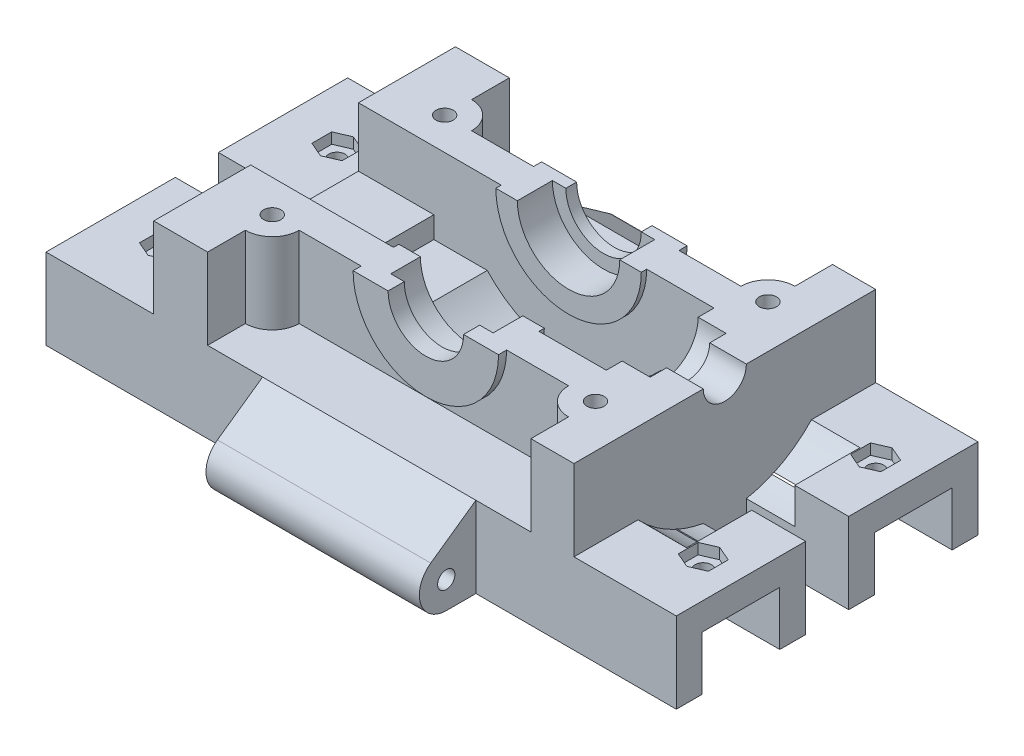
ISO-10303-21;
HEADER;
FILE_DESCRIPTION(('STEP AP214'),'2;1');
FILE_NAME('part.step','',(''),(''),'','','');
FILE_SCHEMA(('AUTOMOTIVE_DESIGN { 1 0 10303 214 1 1 1 1 }'));
ENDSEC;
DATA;
#1=APPLICATION_CONTEXT('core data for automotive mechanical design processes');
#2=APPLICATION_PROTOCOL_DEFINITION('international standard','automotive_design',2000,#1);
#3=PRODUCT_CONTEXT('',#1,'mechanical');
#4=PRODUCT('Part','Part','',(#3));
#5=PRODUCT_RELATED_PRODUCT_CATEGORY('part','',(#4));
#6=PRODUCT_DEFINITION_FORMATION('','',#4);
#7=PRODUCT_DEFINITION_CONTEXT('part definition',#1,'design');
#8=PRODUCT_DEFINITION('design','',#6,#7);
#9=PRODUCT_DEFINITION_SHAPE('','',#8);
#10=(LENGTH_UNIT() NAMED_UNIT(*) SI_UNIT(.MILLI.,.METRE.));
#11=(NAMED_UNIT(*) PLANE_ANGLE_UNIT() SI_UNIT($,.RADIAN.));
#12=(NAMED_UNIT(*) SI_UNIT($,.STERADIAN.) SOLID_ANGLE_UNIT());
#13=UNCERTAINTY_MEASURE_WITH_UNIT(LENGTH_MEASURE(1.E-05),#10,'distance_accuracy_value','');
#14=(GEOMETRIC_REPRESENTATION_CONTEXT(3) GLOBAL_UNCERTAINTY_ASSIGNED_CONTEXT((#13)) GLOBAL_UNIT_ASSIGNED_CONTEXT((#10,
#11,#12)) REPRESENTATION_CONTEXT('',''));
#15=CARTESIAN_POINT('',(0.,0.,0.));
#16=DIRECTION('',(0.,0.,1.));
#17=DIRECTION('',(1.,0.,0.));
#18=AXIS2_PLACEMENT_3D('',#15,#16,#17);
#19=CARTESIAN_POINT('',(-103.227895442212,0.,-28.));
#20=DIRECTION('',(0.,0.,1.));
#21=DIRECTION('',(0.,-1.,0.));
#22=AXIS2_PLACEMENT_3D('',#19,#20,#21);
#23=PLANE('',#22);
#24=DIRECTION('',(-1.,0.,0.));
#25=VECTOR('',#24,1.);
#26=CARTESIAN_POINT('',(-103.227895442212,13.0550295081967,-28.));
#27=LINE('',#26,#25);
#28=CARTESIAN_POINT('',(-17.6337783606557,13.0550295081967,-28.));
#29=VERTEX_POINT('',#28);
#30=CARTESIAN_POINT('',(-29.1337783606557,13.0550295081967,-28.));
#31=VERTEX_POINT('',#30);
#32=EDGE_CURVE('E1850',#29,#31,#27,.T.);
#33=ORIENTED_EDGE('',*,*,#32,.F.);
#34=DIRECTION('',(0.,-1.,0.));
#35=VECTOR('',#34,1.);
#36=CARTESIAN_POINT('',(-17.6337783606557,35.1260973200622,-28.));
#37=LINE('',#36,#35);
#38=CARTESIAN_POINT('',(-17.6337783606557,-1.94497049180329,-28.));
#39=VERTEX_POINT('',#38);
#40=EDGE_CURVE('E964',#29,#39,#37,.T.);
#41=ORIENTED_EDGE('',*,*,#40,.T.);
#42=DIRECTION('',(1.,0.,0.));
#43=VECTOR('',#42,1.);
#44=CARTESIAN_POINT('',(-103.227895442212,-1.94497049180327,-28.));
#45=LINE('',#44,#43);
#46=CARTESIAN_POINT('',(-67.6337783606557,-1.94497049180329,-28.));
#47=VERTEX_POINT('',#46);
#48=EDGE_CURVE('E1042',#47,#39,#45,.T.);
#49=ORIENTED_EDGE('',*,*,#48,.F.);
#50=DIRECTION('',(0.,-1.,0.));
#51=VECTOR('',#50,1.);
#52=CARTESIAN_POINT('',(-67.6337783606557,35.1260973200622,-28.));
#53=LINE('',#52,#51);
#54=CARTESIAN_POINT('',(-67.6337783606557,13.0550295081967,-28.));
#55=VERTEX_POINT('',#54);
#56=EDGE_CURVE('E949',#55,#47,#53,.T.);
#57=ORIENTED_EDGE('',*,*,#56,.F.);
#58=CARTESIAN_POINT('',(-56.1337783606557,13.0550295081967,-28.));
#59=VERTEX_POINT('',#58);
#60=EDGE_CURVE('E933',#59,#55,#27,.T.);
#61=ORIENTED_EDGE('',*,*,#60,.F.);
#62=CARTESIAN_POINT('',(-42.6337783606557,13.0550295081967,-28.));
#63=DIRECTION('',(0.,0.,1.));
#64=DIRECTION('',(0.,-1.,0.));
#65=AXIS2_PLACEMENT_3D('',#62,#63,#64);
#66=CIRCLE('',#65,13.5);
#67=EDGE_CURVE('E1669',#31,#59,#66,.F.);
#68=ORIENTED_EDGE('',*,*,#67,.F.);
#69=EDGE_LOOP('',(#33,#41,#49,#57,#61,#68));
#70=FACE_BOUND('',#69,.T.);
#71=ADVANCED_FACE('F253',(#70),#23,.F.);
#72=CARTESIAN_POINT('',(-72.6337783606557,0.,6.));
#73=DIRECTION('',(1.,0.,0.));
#74=DIRECTION('',(0.,0.,-1.));
#75=AXIS2_PLACEMENT_3D('',#72,#73,#74);
#76=PLANE('',#75);
#77=DIRECTION('',(0.,-1.,0.));
#78=VECTOR('',#77,1.);
#79=CARTESIAN_POINT('',(-72.6337783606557,0.,-40.));
#80=LINE('',#79,#78);
#81=CARTESIAN_POINT('',(-72.6337783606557,13.0550295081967,-40.));
#82=VERTEX_POINT('',#81);
#83=CARTESIAN_POINT('',(-72.6337783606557,-1.94497049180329,-40.));
#84=VERTEX_POINT('',#83);
#85=EDGE_CURVE('E943',#82,#84,#80,.T.);
#86=ORIENTED_EDGE('',*,*,#85,.F.);
#87=DIRECTION('',(0.,0.,1.));
#88=VECTOR('',#87,1.);
#89=CARTESIAN_POINT('',(-72.6337783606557,13.0550295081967,6.));
#90=LINE('',#89,#88);
#91=CARTESIAN_POINT('',(-72.6337783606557,13.0550295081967,-33.));
#92=VERTEX_POINT('',#91);
#93=EDGE_CURVE('E930',#82,#92,#90,.T.);
#94=ORIENTED_EDGE('',*,*,#93,.T.);
#95=DIRECTION('',(0.,-1.,0.));
#96=VECTOR('',#95,1.);
#97=CARTESIAN_POINT('',(-72.6337783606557,35.1260973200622,-33.));
#98=LINE('',#97,#96);
#99=CARTESIAN_POINT('',(-72.6337783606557,-1.94497049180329,-33.));
#100=VERTEX_POINT('',#99);
#101=EDGE_CURVE('E941',#92,#100,#98,.T.);
#102=ORIENTED_EDGE('',*,*,#101,.T.);
#103=DIRECTION('',(0.,0.,1.));
#104=VECTOR('',#103,1.);
#105=CARTESIAN_POINT('',(-72.6337783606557,-1.94497049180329,-40.));
#106=LINE('',#105,#104);
#107=EDGE_CURVE('E1577',#84,#100,#106,.T.);
#108=ORIENTED_EDGE('',*,*,#107,.F.);
#109=EDGE_LOOP('',(#86,#94,#102,#108));
#110=FACE_BOUND('',#109,.T.);
#111=ADVANCED_FACE('F939',(#110),#76,.T.);
#112=CARTESIAN_POINT('',(-12.6337783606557,0.,6.));
#113=DIRECTION('',(1.,0.,0.));
#114=DIRECTION('',(0.,1.,0.));
#115=AXIS2_PLACEMENT_3D('',#112,#113,#114);
#116=PLANE('',#115);
#117=DIRECTION('',(0.,0.,1.));
#118=VECTOR('',#117,1.);
#119=CARTESIAN_POINT('',(-12.6337783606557,13.0550295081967,6.));
#120=LINE('',#119,#118);
#121=CARTESIAN_POINT('',(-12.6337783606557,13.0550295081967,-40.));
#122=VERTEX_POINT('',#121);
#123=CARTESIAN_POINT('',(-12.6337783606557,13.0550295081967,-33.));
#124=VERTEX_POINT('',#123);
#125=EDGE_CURVE('E1772',#122,#124,#120,.T.);
#126=ORIENTED_EDGE('',*,*,#125,.F.);
#127=DIRECTION('',(0.,-1.,0.));
#128=VECTOR('',#127,1.);
#129=CARTESIAN_POINT('',(-12.6337783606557,0.,-40.));
#130=LINE('',#129,#128);
#131=CARTESIAN_POINT('',(-12.6337783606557,-1.94497049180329,-40.));
#132=VERTEX_POINT('',#131);
#133=EDGE_CURVE('E1647',#122,#132,#130,.T.);
#134=ORIENTED_EDGE('',*,*,#133,.T.);
#135=DIRECTION('',(0.,0.,-1.));
#136=VECTOR('',#135,1.);
#137=CARTESIAN_POINT('',(-12.6337783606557,-1.94497049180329,16.));
#138=LINE('',#137,#136);
#139=CARTESIAN_POINT('',(-12.6337783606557,-1.94497049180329,-33.));
#140=VERTEX_POINT('',#139);
#141=EDGE_CURVE('E1583',#140,#132,#138,.T.);
#142=ORIENTED_EDGE('',*,*,#141,.F.);
#143=DIRECTION('',(0.,-1.,0.));
#144=VECTOR('',#143,1.);
#145=CARTESIAN_POINT('',(-12.6337783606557,35.1260973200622,-33.));
#146=LINE('',#145,#144);
#147=EDGE_CURVE('E962',#124,#140,#146,.T.);
#148=ORIENTED_EDGE('',*,*,#147,.F.);
#149=EDGE_LOOP('',(#126,#134,#142,#148));
#150=FACE_BOUND('',#149,.T.);
#151=ADVANCED_FACE('F255',(#150),#116,.F.);
#152=CARTESIAN_POINT('',(-103.227895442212,0.,4.));
#153=DIRECTION('',(0.,0.,1.));
#154=DIRECTION('',(0.,-1.,0.));
#155=AXIS2_PLACEMENT_3D('',#152,#153,#154);
#156=PLANE('',#155);
#157=DIRECTION('',(0.,-1.,0.));
#158=VECTOR('',#157,1.);
#159=CARTESIAN_POINT('',(-17.6337783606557,35.1260973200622,4.));
#160=LINE('',#159,#158);
#161=CARTESIAN_POINT('',(-17.6337783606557,13.0550295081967,4.));
#162=VERTEX_POINT('',#161);
#163=CARTESIAN_POINT('',(-17.6337783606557,-1.94497049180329,4.));
#164=VERTEX_POINT('',#163);
#165=EDGE_CURVE('E961',#162,#164,#160,.T.);
#166=ORIENTED_EDGE('',*,*,#165,.F.);
#167=DIRECTION('',(-1.,0.,0.));
#168=VECTOR('',#167,1.);
#169=CARTESIAN_POINT('',(-103.227895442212,13.0550295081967,4.));
#170=LINE('',#169,#168);
#171=CARTESIAN_POINT('',(-29.1337783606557,13.0550295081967,4.));
#172=VERTEX_POINT('',#171);
#173=EDGE_CURVE('E276',#162,#172,#170,.T.);
#174=ORIENTED_EDGE('',*,*,#173,.T.);
#175=CARTESIAN_POINT('',(-42.6337783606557,13.0550295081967,4.));
#176=DIRECTION('',(0.,0.,1.));
#177=DIRECTION('',(1.,0.,0.));
#178=AXIS2_PLACEMENT_3D('',#175,#176,#177);
#179=CIRCLE('',#178,13.5);
#180=CARTESIAN_POINT('',(-56.1337783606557,13.0550295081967,4.));
#181=VERTEX_POINT('',#180);
#182=EDGE_CURVE('E1022',#181,#172,#179,.T.);
#183=ORIENTED_EDGE('',*,*,#182,.F.);
#184=CARTESIAN_POINT('',(-67.6337783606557,13.0550295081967,4.));
#185=VERTEX_POINT('',#184);
#186=EDGE_CURVE('E1710',#181,#185,#170,.T.);
#187=ORIENTED_EDGE('',*,*,#186,.T.);
#188=DIRECTION('',(0.,-1.,0.));
#189=VECTOR('',#188,1.);
#190=CARTESIAN_POINT('',(-67.6337783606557,35.1260973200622,4.));
#191=LINE('',#190,#189);
#192=CARTESIAN_POINT('',(-67.6337783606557,-1.94497049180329,4.));
#193=VERTEX_POINT('',#192);
#194=EDGE_CURVE('E976',#185,#193,#191,.T.);
#195=ORIENTED_EDGE('',*,*,#194,.T.);
#196=DIRECTION('',(1.,0.,0.));
#197=VECTOR('',#196,1.);
#198=CARTESIAN_POINT('',(-103.227895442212,-1.94497049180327,4.));
#199=LINE('',#198,#197);
#200=EDGE_CURVE('E1029',#193,#164,#199,.T.);
#201=ORIENTED_EDGE('',*,*,#200,.T.);
#202=EDGE_LOOP('',(#166,#174,#183,#187,#195,#201));
#203=FACE_BOUND('',#202,.T.);
#204=ADVANCED_FACE('F1925',(#203),#156,.T.);
#205=DIRECTION('',(0.,0.,1.));
#206=VECTOR('',#205,1.);
#207=CARTESIAN_POINT('',(-12.6337783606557,13.0550295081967,6.));
#208=LINE('',#207,#206);
#209=CARTESIAN_POINT('',(-12.6337783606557,13.0550295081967,9.00000000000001));
#210=VERTEX_POINT('',#209);
#211=CARTESIAN_POINT('',(-12.6337783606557,13.0550295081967,16.));
#212=VERTEX_POINT('',#211);
#213=EDGE_CURVE('E1778',#210,#212,#208,.T.);
#214=ORIENTED_EDGE('',*,*,#213,.F.);
#215=DIRECTION('',(0.,-1.,0.));
#216=VECTOR('',#215,1.);
#217=CARTESIAN_POINT('',(-12.6337783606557,35.1260973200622,9.00000000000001));
#218=LINE('',#217,#216);
#219=CARTESIAN_POINT('',(-12.6337783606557,-1.94497049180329,9.00000000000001));
#220=VERTEX_POINT('',#219);
#221=EDGE_CURVE('E969',#210,#220,#218,.T.);
#222=ORIENTED_EDGE('',*,*,#221,.T.);
#223=CARTESIAN_POINT('',(-12.6337783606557,-1.94497049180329,16.));
#224=VERTEX_POINT('',#223);
#225=EDGE_CURVE('E1584',#224,#220,#138,.T.);
#226=ORIENTED_EDGE('',*,*,#225,.F.);
#227=DIRECTION('',(0.,-1.,0.));
#228=VECTOR('',#227,1.);
#229=CARTESIAN_POINT('',(-12.6337783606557,0.,16.));
#230=LINE('',#229,#228);
#231=EDGE_CURVE('E1616',#212,#224,#230,.T.);
#232=ORIENTED_EDGE('',*,*,#231,.F.);
#233=EDGE_LOOP('',(#214,#222,#226,#232));
#234=FACE_BOUND('',#233,.T.);
#235=ADVANCED_FACE('F1949',(#234),#116,.F.);
#236=DIRECTION('',(0.,-1.,0.));
#237=VECTOR('',#236,1.);
#238=CARTESIAN_POINT('',(-72.6337783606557,35.1260973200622,9.00000000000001));
#239=LINE('',#238,#237);
#240=CARTESIAN_POINT('',(-72.6337783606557,13.0550295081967,9.00000000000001));
#241=VERTEX_POINT('',#240);
#242=CARTESIAN_POINT('',(-72.6337783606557,-1.94497049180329,9.00000000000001));
#243=VERTEX_POINT('',#242);
#244=EDGE_CURVE('E972',#241,#243,#239,.T.);
#245=ORIENTED_EDGE('',*,*,#244,.F.);
#246=DIRECTION('',(0.,0.,1.));
#247=VECTOR('',#246,1.);
#248=CARTESIAN_POINT('',(-72.6337783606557,13.0550295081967,6.));
#249=LINE('',#248,#247);
#250=CARTESIAN_POINT('',(-72.6337783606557,13.0550295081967,16.));
#251=VERTEX_POINT('',#250);
#252=EDGE_CURVE('E268',#241,#251,#249,.T.);
#253=ORIENTED_EDGE('',*,*,#252,.T.);
#254=DIRECTION('',(0.,-1.,0.));
#255=VECTOR('',#254,1.);
#256=CARTESIAN_POINT('',(-72.6337783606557,0.,16.));
#257=LINE('',#256,#255);
#258=CARTESIAN_POINT('',(-72.6337783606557,-1.94497049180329,16.));
#259=VERTEX_POINT('',#258);
#260=EDGE_CURVE('E1614',#251,#259,#257,.T.);
#261=ORIENTED_EDGE('',*,*,#260,.T.);
#262=EDGE_CURVE('E1552',#243,#259,#106,.T.);
#263=ORIENTED_EDGE('',*,*,#262,.F.);
#264=EDGE_LOOP('',(#245,#253,#261,#263));
#265=FACE_BOUND('',#264,.T.);
#266=ADVANCED_FACE('F1912',(#265),#76,.T.);
#267=CARTESIAN_POINT('',(-72.6337783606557,58.0550295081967,-28.));
#268=DIRECTION('',(0.,-1.,0.));
#269=DIRECTION('',(0.,0.,-1.));
#270=AXIS2_PLACEMENT_3D('',#267,#268,#269);
#271=CYLINDRICAL_SURFACE('',#270,1.6);
#272=CARTESIAN_POINT('',(-72.6337783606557,-6.94497049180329,-28.));
#273=DIRECTION('',(0.,-1.,0.));
#274=DIRECTION('',(0.,0.,-1.));
#275=AXIS2_PLACEMENT_3D('',#272,#273,#274);
#276=CIRCLE('',#275,1.6);
#277=CARTESIAN_POINT('',(-72.6337783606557,-6.94497049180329,-29.6));
#278=VERTEX_POINT('',#277);
#279=EDGE_CURVE('E979',#278,#278,#276,.F.);
#280=ORIENTED_EDGE('',*,*,#279,.F.);
#281=EDGE_LOOP('',(#280));
#282=FACE_BOUND('',#281,.T.);
#283=CARTESIAN_POINT('',(-72.6337783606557,13.0550295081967,-28.));
#284=DIRECTION('',(0.,1.,0.));
#285=DIRECTION('',(0.,0.,1.));
#286=AXIS2_PLACEMENT_3D('',#283,#284,#285);
#287=CIRCLE('',#286,1.6);
#288=CARTESIAN_POINT('',(-72.6337783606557,13.0550295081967,-26.4));
#289=VERTEX_POINT('',#288);
#290=EDGE_CURVE('E950',#289,#289,#287,.T.);
#291=ORIENTED_EDGE('',*,*,#290,.T.);
#292=EDGE_LOOP('',(#291));
#293=FACE_BOUND('',#292,.T.);
#294=ADVANCED_FACE('F2497',(#282,#293),#271,.F.);
#295=CARTESIAN_POINT('',(-72.6337783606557,58.0550295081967,4.));
#296=DIRECTION('',(0.,-1.,0.));
#297=DIRECTION('',(0.,0.,-1.));
#298=AXIS2_PLACEMENT_3D('',#295,#296,#297);
#299=CYLINDRICAL_SURFACE('',#298,1.60000000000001);
#300=CARTESIAN_POINT('',(-72.6337783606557,-6.94497049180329,4.));
#301=DIRECTION('',(0.,-1.,0.));
#302=DIRECTION('',(0.,0.,-1.));
#303=AXIS2_PLACEMENT_3D('',#300,#301,#302);
#304=CIRCLE('',#303,1.60000000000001);
#305=CARTESIAN_POINT('',(-72.6337783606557,-6.94497049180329,2.4));
#306=VERTEX_POINT('',#305);
#307=EDGE_CURVE('E988',#306,#306,#304,.F.);
#308=ORIENTED_EDGE('',*,*,#307,.F.);
#309=EDGE_LOOP('',(#308));
#310=FACE_BOUND('',#309,.T.);
#311=CARTESIAN_POINT('',(-72.6337783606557,13.0550295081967,4.));
#312=DIRECTION('',(0.,1.,0.));
#313=DIRECTION('',(0.,0.,1.));
#314=AXIS2_PLACEMENT_3D('',#311,#312,#313);
#315=CIRCLE('',#314,1.60000000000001);
#316=CARTESIAN_POINT('',(-72.6337783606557,13.0550295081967,5.6));
#317=VERTEX_POINT('',#316);
#318=EDGE_CURVE('E954',#317,#317,#315,.T.);
#319=ORIENTED_EDGE('',*,*,#318,.T.);
#320=EDGE_LOOP('',(#319));
#321=FACE_BOUND('',#320,.T.);
#322=ADVANCED_FACE('F1731',(#310,#321),#299,.F.);
#323=CARTESIAN_POINT('',(-12.6337783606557,58.0550295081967,-28.));
#324=DIRECTION('',(0.,-1.,0.));
#325=DIRECTION('',(0.,0.,-1.));
#326=AXIS2_PLACEMENT_3D('',#323,#324,#325);
#327=CYLINDRICAL_SURFACE('',#326,1.6);
#328=CARTESIAN_POINT('',(-12.6337783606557,-6.94497049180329,-28.));
#329=DIRECTION('',(0.,-1.,0.));
#330=DIRECTION('',(0.,0.,-1.));
#331=AXIS2_PLACEMENT_3D('',#328,#329,#330);
#332=CIRCLE('',#331,1.6);
#333=CARTESIAN_POINT('',(-12.6337783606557,-6.94497049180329,-29.6));
#334=VERTEX_POINT('',#333);
#335=EDGE_CURVE('E982',#334,#334,#332,.F.);
#336=ORIENTED_EDGE('',*,*,#335,.F.);
#337=EDGE_LOOP('',(#336));
#338=FACE_BOUND('',#337,.T.);
#339=CARTESIAN_POINT('',(-12.6337783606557,13.0550295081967,-28.));
#340=DIRECTION('',(0.,1.,0.));
#341=DIRECTION('',(0.,0.,1.));
#342=AXIS2_PLACEMENT_3D('',#339,#340,#341);
#343=CIRCLE('',#342,1.6);
#344=CARTESIAN_POINT('',(-12.6337783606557,13.0550295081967,-26.4));
#345=VERTEX_POINT('',#344);
#346=EDGE_CURVE('E1725',#345,#345,#343,.T.);
#347=ORIENTED_EDGE('',*,*,#346,.T.);
#348=EDGE_LOOP('',(#347));
#349=FACE_BOUND('',#348,.T.);
#350=ADVANCED_FACE('F2518',(#338,#349),#327,.F.);
#351=CARTESIAN_POINT('',(-12.6337783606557,58.0550295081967,4.));
#352=DIRECTION('',(0.,-1.,0.));
#353=DIRECTION('',(0.,0.,-1.));
#354=AXIS2_PLACEMENT_3D('',#351,#352,#353);
#355=CYLINDRICAL_SURFACE('',#354,1.6);
#356=CARTESIAN_POINT('',(-12.6337783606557,-6.94497049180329,4.));
#357=DIRECTION('',(0.,-1.,0.));
#358=DIRECTION('',(0.,0.,-1.));
#359=AXIS2_PLACEMENT_3D('',#356,#357,#358);
#360=CIRCLE('',#359,1.6);
#361=CARTESIAN_POINT('',(-12.6337783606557,-6.94497049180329,2.40000000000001));
#362=VERTEX_POINT('',#361);
#363=EDGE_CURVE('E985',#362,#362,#360,.F.);
#364=ORIENTED_EDGE('',*,*,#363,.F.);
#365=EDGE_LOOP('',(#364));
#366=FACE_BOUND('',#365,.T.);
#367=CARTESIAN_POINT('',(-12.6337783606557,13.0550295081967,4.));
#368=DIRECTION('',(0.,1.,0.));
#369=DIRECTION('',(0.,0.,1.));
#370=AXIS2_PLACEMENT_3D('',#367,#368,#369);
#371=CIRCLE('',#370,1.6);
#372=CARTESIAN_POINT('',(-12.6337783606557,13.0550295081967,5.6));
#373=VERTEX_POINT('',#372);
#374=EDGE_CURVE('E1722',#373,#373,#371,.T.);
#375=ORIENTED_EDGE('',*,*,#374,.T.);
#376=EDGE_LOOP('',(#375));
#377=FACE_BOUND('',#376,.T.);
#378=ADVANCED_FACE('F2529',(#366,#377),#355,.F.);
#379=CARTESIAN_POINT('',(-42.6337783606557,13.0550295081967,-65.3653871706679));
#380=DIRECTION('',(0.,0.,1.));
#381=DIRECTION('',(1.,0.,0.));
#382=AXIS2_PLACEMENT_3D('',#379,#380,#381);
#383=CYLINDRICAL_SURFACE('',#382,7.00000000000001);
#384=DIRECTION('',(0.,0.,1.));
#385=VECTOR('',#384,1.);
#386=CARTESIAN_POINT('',(-49.6337783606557,13.0550295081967,-65.3653871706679));
#387=LINE('',#386,#385);
#388=CARTESIAN_POINT('',(-49.6337783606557,13.0550295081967,-27.5));
#389=VERTEX_POINT('',#388);
#390=CARTESIAN_POINT('',(-49.6337783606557,13.0550295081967,-29.5));
#391=VERTEX_POINT('',#390);
#392=EDGE_CURVE('E1839',#389,#391,#387,.F.);
#393=ORIENTED_EDGE('',*,*,#392,.F.);
#394=CARTESIAN_POINT('',(-42.6337783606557,13.0550295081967,-27.5));
#395=DIRECTION('',(0.,0.,1.));
#396=DIRECTION('',(1.,0.,0.));
#397=AXIS2_PLACEMENT_3D('',#394,#395,#396);
#398=CIRCLE('',#397,7.00000000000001);
#399=CARTESIAN_POINT('',(-35.6337783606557,13.0550295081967,-27.5));
#400=VERTEX_POINT('',#399);
#401=EDGE_CURVE('E991',#400,#389,#398,.F.);
#402=ORIENTED_EDGE('',*,*,#401,.F.);
#403=DIRECTION('',(0.,0.,1.));
#404=VECTOR('',#403,1.);
#405=CARTESIAN_POINT('',(-35.6337783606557,13.0550295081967,-65.3653871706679));
#406=LINE('',#405,#404);
#407=CARTESIAN_POINT('',(-35.6337783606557,13.0550295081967,-29.5));
#408=VERTEX_POINT('',#407);
#409=EDGE_CURVE('E1814',#408,#400,#406,.T.);
#410=ORIENTED_EDGE('',*,*,#409,.F.);
#411=CARTESIAN_POINT('',(-42.6337783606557,13.0550295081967,-29.5));
#412=DIRECTION('',(0.,0.,-1.));
#413=DIRECTION('',(0.,1.,0.));
#414=AXIS2_PLACEMENT_3D('',#411,#412,#413);
#415=CIRCLE('',#414,7.00000000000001);
#416=EDGE_CURVE('E1016',#391,#408,#415,.F.);
#417=ORIENTED_EDGE('',*,*,#416,.F.);
#418=EDGE_LOOP('',(#393,#402,#410,#417));
#419=FACE_BOUND('',#418,.T.);
#420=ADVANCED_FACE('F2541',(#419),#383,.F.);
#421=DIRECTION('',(0.,0.,1.));
#422=VECTOR('',#421,1.);
#423=CARTESIAN_POINT('',(-49.6337783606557,13.0550295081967,-65.3653871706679));
#424=LINE('',#423,#422);
#425=CARTESIAN_POINT('',(-49.6337783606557,13.0550295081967,5.5));
#426=VERTEX_POINT('',#425);
#427=CARTESIAN_POINT('',(-49.6337783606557,13.0550295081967,2.50000000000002));
#428=VERTEX_POINT('',#427);
#429=EDGE_CURVE('E1716',#426,#428,#424,.F.);
#430=ORIENTED_EDGE('',*,*,#429,.F.);
#431=CARTESIAN_POINT('',(-42.6337783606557,13.0550295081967,5.5));
#432=DIRECTION('',(0.,0.,1.));
#433=DIRECTION('',(1.,0.,0.));
#434=AXIS2_PLACEMENT_3D('',#431,#432,#433);
#435=CIRCLE('',#434,7.00000000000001);
#436=CARTESIAN_POINT('',(-35.6337783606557,13.0550295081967,5.5));
#437=VERTEX_POINT('',#436);
#438=EDGE_CURVE('E1026',#426,#437,#435,.T.);
#439=ORIENTED_EDGE('',*,*,#438,.T.);
#440=DIRECTION('',(0.,0.,1.));
#441=VECTOR('',#440,1.);
#442=CARTESIAN_POINT('',(-35.6337783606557,13.0550295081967,-65.3653871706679));
#443=LINE('',#442,#441);
#444=CARTESIAN_POINT('',(-35.6337783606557,13.0550295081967,2.50000000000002));
#445=VERTEX_POINT('',#444);
#446=EDGE_CURVE('E1694',#445,#437,#443,.T.);
#447=ORIENTED_EDGE('',*,*,#446,.F.);
#448=CARTESIAN_POINT('',(-42.6337783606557,13.0550295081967,2.50000000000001));
#449=DIRECTION('',(0.,0.,-1.));
#450=DIRECTION('',(0.,1.,0.));
#451=AXIS2_PLACEMENT_3D('',#448,#449,#450);
#452=CIRCLE('',#451,7.00000000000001);
#453=EDGE_CURVE('E1004',#428,#445,#452,.F.);
#454=ORIENTED_EDGE('',*,*,#453,.F.);
#455=EDGE_LOOP('',(#430,#439,#447,#454));
#456=FACE_BOUND('',#455,.T.);
#457=ADVANCED_FACE('F2243',(#456),#383,.F.);
#458=CARTESIAN_POINT('',(0.,0.,-40.));
#459=DIRECTION('',(0.,0.,1.));
#460=DIRECTION('',(1.,0.,0.));
#461=AXIS2_PLACEMENT_3D('',#458,#459,#460);
#462=PLANE('',#461);
#463=DIRECTION('',(-1.,0.,0.));
#464=VECTOR('',#463,1.);
#465=CARTESIAN_POINT('',(0.,13.0550295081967,-40.));
#466=LINE('',#465,#464);
#467=CARTESIAN_POINT('',(-82.6337783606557,13.0550295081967,-40.));
#468=VERTEX_POINT('',#467);
#469=EDGE_CURVE('E1846',#82,#468,#466,.T.);
#470=ORIENTED_EDGE('',*,*,#469,.F.);
#471=ORIENTED_EDGE('',*,*,#85,.T.);
#472=DIRECTION('',(-1.,0.,0.));
#473=VECTOR('',#472,1.);
#474=CARTESIAN_POINT('',(-72.6337783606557,-1.94497049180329,-40.));
#475=LINE('',#474,#473);
#476=CARTESIAN_POINT('',(-62.4337783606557,-1.94497049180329,-40.));
#477=VERTEX_POINT('',#476);
#478=EDGE_CURVE('E1587',#477,#84,#475,.T.);
#479=ORIENTED_EDGE('',*,*,#478,.F.);
#480=DIRECTION('',(0.,1.,0.));
#481=VECTOR('',#480,1.);
#482=CARTESIAN_POINT('',(-62.4337783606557,0.,-40.));
#483=LINE('',#482,#481);
#484=CARTESIAN_POINT('',(-62.4337783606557,-16.9449704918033,-40.));
#485=VERTEX_POINT('',#484);
#486=EDGE_CURVE('E1639',#485,#477,#483,.T.);
#487=ORIENTED_EDGE('',*,*,#486,.F.);
#488=DIRECTION('',(1.,0.,0.));
#489=VECTOR('',#488,1.);
#490=CARTESIAN_POINT('',(0.,-16.9449704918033,-40.));
#491=LINE('',#490,#489);
#492=CARTESIAN_POINT('',(-102.633778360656,-16.9449704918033,-40.));
#493=VERTEX_POINT('',#492);
#494=EDGE_CURVE('E1652',#493,#485,#491,.T.);
#495=ORIENTED_EDGE('',*,*,#494,.F.);
#496=DIRECTION('',(0.,1.,0.));
#497=VECTOR('',#496,1.);
#498=CARTESIAN_POINT('',(-102.633778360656,0.,-40.));
#499=LINE('',#498,#497);
#500=CARTESIAN_POINT('',(-102.633778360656,-1.94497049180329,-40.));
#501=VERTEX_POINT('',#500);
#502=EDGE_CURVE('E1491',#493,#501,#499,.T.);
#503=ORIENTED_EDGE('',*,*,#502,.T.);
#504=DIRECTION('',(-1.,0.,0.));
#505=VECTOR('',#504,1.);
#506=CARTESIAN_POINT('',(17.3662216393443,-1.94497049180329,-40.));
#507=LINE('',#506,#505);
#508=CARTESIAN_POINT('',(-82.6337783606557,-1.94497049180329,-40.));
#509=VERTEX_POINT('',#508);
#510=EDGE_CURVE('E1494',#509,#501,#507,.T.);
#511=ORIENTED_EDGE('',*,*,#510,.F.);
#512=DIRECTION('',(0.,-1.,0.));
#513=VECTOR('',#512,1.);
#514=CARTESIAN_POINT('',(-82.6337783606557,0.,-40.));
#515=LINE('',#514,#513);
#516=EDGE_CURVE('E1649',#468,#509,#515,.T.);
#517=ORIENTED_EDGE('',*,*,#516,.F.);
#518=EDGE_LOOP('',(#470,#471,#479,#487,#495,#503,#511,#517));
#519=FACE_BOUND('',#518,.T.);
#520=ADVANCED_FACE('F1880',(#519),#462,.F.);
#521=CARTESIAN_POINT('',(0.,0.,16.));
#522=DIRECTION('',(0.,0.,-1.));
#523=DIRECTION('',(1.,0.,0.));
#524=AXIS2_PLACEMENT_3D('',#521,#522,#523);
#525=PLANE('',#524);
#526=DIRECTION('',(1.,0.,0.));
#527=VECTOR('',#526,1.);
#528=CARTESIAN_POINT('',(0.,13.0550295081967,16.));
#529=LINE('',#528,#527);
#530=CARTESIAN_POINT('',(-82.6337783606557,13.0550295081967,16.));
#531=VERTEX_POINT('',#530);
#532=EDGE_CURVE('E1713',#531,#251,#529,.T.);
#533=ORIENTED_EDGE('',*,*,#532,.F.);
#534=DIRECTION('',(0.,-1.,0.));
#535=VECTOR('',#534,1.);
#536=CARTESIAN_POINT('',(-82.6337783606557,0.,16.));
#537=LINE('',#536,#535);
#538=CARTESIAN_POINT('',(-82.6337783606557,-1.94497049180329,16.));
#539=VERTEX_POINT('',#538);
#540=EDGE_CURVE('E1618',#531,#539,#537,.T.);
#541=ORIENTED_EDGE('',*,*,#540,.T.);
#542=DIRECTION('',(1.,0.,0.));
#543=VECTOR('',#542,1.);
#544=CARTESIAN_POINT('',(-102.633778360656,-1.94497049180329,16.));
#545=LINE('',#544,#543);
#546=CARTESIAN_POINT('',(-102.633778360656,-1.94497049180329,16.));
#547=VERTEX_POINT('',#546);
#548=EDGE_CURVE('E1536',#547,#539,#545,.T.);
#549=ORIENTED_EDGE('',*,*,#548,.F.);
#550=DIRECTION('',(0.,-1.,0.));
#551=VECTOR('',#550,1.);
#552=CARTESIAN_POINT('',(-102.633778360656,0.,16.));
#553=LINE('',#552,#551);
#554=CARTESIAN_POINT('',(-102.633778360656,-16.9449704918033,16.));
#555=VERTEX_POINT('',#554);
#556=EDGE_CURVE('E1512',#547,#555,#553,.T.);
#557=ORIENTED_EDGE('',*,*,#556,.T.);
#558=DIRECTION('',(1.,0.,0.));
#559=VECTOR('',#558,1.);
#560=CARTESIAN_POINT('',(0.,-16.9449704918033,16.));
#561=LINE('',#560,#559);
#562=CARTESIAN_POINT('',(-62.4337783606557,-16.9449704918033,16.));
#563=VERTEX_POINT('',#562);
#564=EDGE_CURVE('E1621',#555,#563,#561,.T.);
#565=ORIENTED_EDGE('',*,*,#564,.T.);
#566=DIRECTION('',(0.,1.,0.));
#567=VECTOR('',#566,1.);
#568=CARTESIAN_POINT('',(-62.4337783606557,0.,16.));
#569=LINE('',#568,#567);
#570=CARTESIAN_POINT('',(-62.4337783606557,-1.94497049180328,16.));
#571=VERTEX_POINT('',#570);
#572=EDGE_CURVE('E1606',#563,#571,#569,.T.);
#573=ORIENTED_EDGE('',*,*,#572,.T.);
#574=DIRECTION('',(1.,0.,0.));
#575=VECTOR('',#574,1.);
#576=CARTESIAN_POINT('',(-72.6337783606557,-1.94497049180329,16.));
#577=LINE('',#576,#575);
#578=EDGE_CURVE('E1580',#259,#571,#577,.T.);
#579=ORIENTED_EDGE('',*,*,#578,.F.);
#580=ORIENTED_EDGE('',*,*,#260,.F.);
#581=EDGE_LOOP('',(#533,#541,#549,#557,#565,#573,#579,#580));
#582=FACE_BOUND('',#581,.T.);
#583=ADVANCED_FACE('F1907',(#582),#525,.F.);
#584=DIRECTION('',(-1.,0.,0.));
#585=VECTOR('',#584,1.);
#586=CARTESIAN_POINT('',(0.,13.0550295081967,-40.));
#587=LINE('',#586,#585);
#588=CARTESIAN_POINT('',(-4.63377836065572,13.0550295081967,-40.));
#589=VERTEX_POINT('',#588);
#590=EDGE_CURVE('E1854',#589,#122,#587,.T.);
#591=ORIENTED_EDGE('',*,*,#590,.F.);
#592=DIRECTION('',(0.,1.,0.));
#593=VECTOR('',#592,1.);
#594=CARTESIAN_POINT('',(-4.63377836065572,0.,-40.));
#595=LINE('',#594,#593);
#596=CARTESIAN_POINT('',(-4.63377836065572,-1.94497049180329,-40.));
#597=VERTEX_POINT('',#596);
#598=EDGE_CURVE('E1076',#597,#589,#595,.T.);
#599=ORIENTED_EDGE('',*,*,#598,.F.);
#600=CARTESIAN_POINT('',(14.3662216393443,-1.94497049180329,-40.));
#601=VERTEX_POINT('',#600);
#602=EDGE_CURVE('E1495',#601,#597,#507,.T.);
#603=ORIENTED_EDGE('',*,*,#602,.F.);
#604=DIRECTION('',(0.,1.,0.));
#605=VECTOR('',#604,1.);
#606=CARTESIAN_POINT('',(14.3662216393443,-16.9449704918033,-40.));
#607=LINE('',#606,#605);
#608=CARTESIAN_POINT('',(14.3662216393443,-16.9449704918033,-40.));
#609=VERTEX_POINT('',#608);
#610=EDGE_CURVE('E1112',#609,#601,#607,.T.);
#611=ORIENTED_EDGE('',*,*,#610,.F.);
#612=CARTESIAN_POINT('',(-22.8337783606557,-16.9449704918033,-40.));
#613=VERTEX_POINT('',#612);
#614=EDGE_CURVE('E1651',#613,#609,#491,.T.);
#615=ORIENTED_EDGE('',*,*,#614,.F.);
#616=DIRECTION('',(0.,-1.,0.));
#617=VECTOR('',#616,1.);
#618=CARTESIAN_POINT('',(-22.8337783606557,0.,-40.));
#619=LINE('',#618,#617);
#620=CARTESIAN_POINT('',(-22.8337783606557,-1.94497049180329,-40.));
#621=VERTEX_POINT('',#620);
#622=EDGE_CURVE('E1635',#621,#613,#619,.T.);
#623=ORIENTED_EDGE('',*,*,#622,.F.);
#624=EDGE_CURVE('E1588',#132,#621,#475,.T.);
#625=ORIENTED_EDGE('',*,*,#624,.F.);
#626=ORIENTED_EDGE('',*,*,#133,.F.);
#627=EDGE_LOOP('',(#591,#599,#603,#611,#615,#623,#625,#626));
#628=FACE_BOUND('',#627,.T.);
#629=ADVANCED_FACE('F2226',(#628),#462,.F.);
#630=DIRECTION('',(1.,0.,0.));
#631=VECTOR('',#630,1.);
#632=CARTESIAN_POINT('',(0.,13.0550295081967,16.));
#633=LINE('',#632,#631);
#634=CARTESIAN_POINT('',(-4.63377836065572,13.0550295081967,16.));
#635=VERTEX_POINT('',#634);
#636=EDGE_CURVE('E1933',#212,#635,#633,.T.);
#637=ORIENTED_EDGE('',*,*,#636,.F.);
#638=ORIENTED_EDGE('',*,*,#231,.T.);
#639=CARTESIAN_POINT('',(-22.8337783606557,-1.94497049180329,16.));
#640=VERTEX_POINT('',#639);
#641=EDGE_CURVE('E1579',#640,#224,#577,.T.);
#642=ORIENTED_EDGE('',*,*,#641,.F.);
#643=DIRECTION('',(0.,-1.,0.));
#644=VECTOR('',#643,1.);
#645=CARTESIAN_POINT('',(-22.8337783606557,0.,16.));
#646=LINE('',#645,#644);
#647=CARTESIAN_POINT('',(-22.8337783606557,-16.9449704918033,16.));
#648=VERTEX_POINT('',#647);
#649=EDGE_CURVE('E1602',#640,#648,#646,.T.);
#650=ORIENTED_EDGE('',*,*,#649,.T.);
#651=CARTESIAN_POINT('',(14.3662216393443,-16.9449704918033,16.));
#652=VERTEX_POINT('',#651);
#653=EDGE_CURVE('E1620',#648,#652,#561,.T.);
#654=ORIENTED_EDGE('',*,*,#653,.T.);
#655=DIRECTION('',(0.,-1.,0.));
#656=VECTOR('',#655,1.);
#657=CARTESIAN_POINT('',(14.3662216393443,-1.94497049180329,16.));
#658=LINE('',#657,#656);
#659=CARTESIAN_POINT('',(14.3662216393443,-1.94497049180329,16.));
#660=VERTEX_POINT('',#659);
#661=EDGE_CURVE('E1133',#660,#652,#658,.T.);
#662=ORIENTED_EDGE('',*,*,#661,.F.);
#663=CARTESIAN_POINT('',(-4.63377836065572,-1.94497049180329,16.));
#664=VERTEX_POINT('',#663);
#665=EDGE_CURVE('E1539',#664,#660,#545,.T.);
#666=ORIENTED_EDGE('',*,*,#665,.F.);
#667=DIRECTION('',(0.,-1.,0.));
#668=VECTOR('',#667,1.);
#669=CARTESIAN_POINT('',(-4.63377836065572,0.,16.));
#670=LINE('',#669,#668);
#671=EDGE_CURVE('E1079',#635,#664,#670,.T.);
#672=ORIENTED_EDGE('',*,*,#671,.F.);
#673=EDGE_LOOP('',(#637,#638,#642,#650,#654,#662,#666,#672));
#674=FACE_BOUND('',#673,.T.);
#675=ADVANCED_FACE('F1942',(#674),#525,.F.);
#676=CARTESIAN_POINT('',(-27.9474868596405,13.0550295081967,-12.));
#677=DIRECTION('',(1.,0.,0.));
#678=DIRECTION('',(0.,0.,-1.));
#679=AXIS2_PLACEMENT_3D('',#676,#677,#678);
#680=CYLINDRICAL_SURFACE('',#679,4.);
#681=DIRECTION('',(1.,0.,0.));
#682=VECTOR('',#681,1.);
#683=CARTESIAN_POINT('',(-27.9474868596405,13.0550295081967,-8.));
#684=LINE('',#683,#682);
#685=CARTESIAN_POINT('',(-4.63377836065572,13.0550295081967,-8.));
#686=VERTEX_POINT('',#685);
#687=CARTESIAN_POINT('',(-11.4337783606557,13.0550295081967,-8.));
#688=VERTEX_POINT('',#687);
#689=EDGE_CURVE('E1810',#686,#688,#684,.F.);
#690=ORIENTED_EDGE('',*,*,#689,.F.);
#691=CARTESIAN_POINT('',(-4.63377836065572,13.0550295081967,-12.));
#692=DIRECTION('',(1.,0.,0.));
#693=DIRECTION('',(0.,0.,-1.));
#694=AXIS2_PLACEMENT_3D('',#691,#692,#693);
#695=CIRCLE('',#694,4.);
#696=CARTESIAN_POINT('',(-4.63377836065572,13.0550295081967,-16.));
#697=VERTEX_POINT('',#696);
#698=EDGE_CURVE('E1143',#686,#697,#695,.T.);
#699=ORIENTED_EDGE('',*,*,#698,.T.);
#700=DIRECTION('',(1.,0.,0.));
#701=VECTOR('',#700,1.);
#702=CARTESIAN_POINT('',(-27.9474868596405,13.0550295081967,-16.));
#703=LINE('',#702,#701);
#704=CARTESIAN_POINT('',(-11.4337783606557,13.0550295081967,-16.));
#705=VERTEX_POINT('',#704);
#706=EDGE_CURVE('E1812',#705,#697,#703,.T.);
#707=ORIENTED_EDGE('',*,*,#706,.F.);
#708=CARTESIAN_POINT('',(-11.4337783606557,13.0550295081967,-12.));
#709=DIRECTION('',(-1.,0.,0.));
#710=DIRECTION('',(0.,-1.,0.));
#711=AXIS2_PLACEMENT_3D('',#708,#709,#710);
#712=CIRCLE('',#711,4.);
#713=EDGE_CURVE('E1206',#688,#705,#712,.F.);
#714=ORIENTED_EDGE('',*,*,#713,.F.);
#715=EDGE_LOOP('',(#690,#699,#707,#714));
#716=FACE_BOUND('',#715,.T.);
#717=ADVANCED_FACE('F1809',(#716),#680,.F.);
#718=CARTESIAN_POINT('',(-82.6337783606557,0.,6.));
#719=DIRECTION('',(1.,0.,0.));
#720=DIRECTION('',(0.,1.,0.));
#721=AXIS2_PLACEMENT_3D('',#718,#719,#720);
#722=PLANE('',#721);
#723=DIRECTION('',(0.,0.,1.));
#724=VECTOR('',#723,1.);
#725=CARTESIAN_POINT('',(-82.6337783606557,13.0550295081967,6.));
#726=LINE('',#725,#724);
#727=CARTESIAN_POINT('',(-82.6337783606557,13.0550295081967,-22.));
#728=VERTEX_POINT('',#727);
#729=EDGE_CURVE('E1751',#468,#728,#726,.T.);
#730=ORIENTED_EDGE('',*,*,#729,.F.);
#731=ORIENTED_EDGE('',*,*,#516,.T.);
#732=DIRECTION('',(0.,0.,1.));
#733=VECTOR('',#732,1.);
#734=CARTESIAN_POINT('',(-82.6337783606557,-1.94497049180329,6.));
#735=LINE('',#734,#733);
#736=CARTESIAN_POINT('',(-82.6337783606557,-1.94497049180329,-16.));
#737=VERTEX_POINT('',#736);
#738=EDGE_CURVE('E1506',#509,#737,#735,.T.);
#739=ORIENTED_EDGE('',*,*,#738,.T.);
#740=DIRECTION('',(0.,1.,0.));
#741=VECTOR('',#740,1.);
#742=CARTESIAN_POINT('',(-82.6337783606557,0.,-16.));
#743=LINE('',#742,#741);
#744=CARTESIAN_POINT('',(-82.6337783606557,-16.9449704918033,-16.));
#745=VERTEX_POINT('',#744);
#746=EDGE_CURVE('E1503',#745,#737,#743,.T.);
#747=ORIENTED_EDGE('',*,*,#746,.F.);
#748=DIRECTION('',(0.,0.,-1.));
#749=VECTOR('',#748,1.);
#750=CARTESIAN_POINT('',(-82.6337783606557,-16.9449704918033,6.));
#751=LINE('',#750,#749);
#752=CARTESIAN_POINT('',(-82.6337783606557,-16.9449704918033,-7.99999999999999));
#753=VERTEX_POINT('',#752);
#754=EDGE_CURVE('E1655',#753,#745,#751,.T.);
#755=ORIENTED_EDGE('',*,*,#754,.F.);
#756=DIRECTION('',(0.,-1.,0.));
#757=VECTOR('',#756,1.);
#758=CARTESIAN_POINT('',(-82.6337783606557,0.,-7.99999999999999));
#759=LINE('',#758,#757);
#760=CARTESIAN_POINT('',(-82.6337783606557,-1.94497049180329,-7.99999999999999));
#761=VERTEX_POINT('',#760);
#762=EDGE_CURVE('E1534',#761,#753,#759,.T.);
#763=ORIENTED_EDGE('',*,*,#762,.F.);
#764=DIRECTION('',(0.,0.,-1.));
#765=VECTOR('',#764,1.);
#766=CARTESIAN_POINT('',(-82.6337783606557,-1.94497049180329,6.));
#767=LINE('',#766,#765);
#768=EDGE_CURVE('E1545',#539,#761,#767,.T.);
#769=ORIENTED_EDGE('',*,*,#768,.F.);
#770=ORIENTED_EDGE('',*,*,#540,.F.);
#771=CARTESIAN_POINT('',(-82.6337783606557,13.0550295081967,-2.));
#772=VERTEX_POINT('',#771);
#773=EDGE_CURVE('E1718',#772,#531,#726,.T.);
#774=ORIENTED_EDGE('',*,*,#773,.F.);
#775=DIRECTION('',(0.,-1.,0.));
#776=VECTOR('',#775,1.);
#777=CARTESIAN_POINT('',(-82.6337783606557,0.,-2.));
#778=LINE('',#777,#776);
#779=CARTESIAN_POINT('',(-82.6337783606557,2.05502950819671,-2.));
#780=VERTEX_POINT('',#779);
#781=EDGE_CURVE('E1114',#772,#780,#778,.T.);
#782=ORIENTED_EDGE('',*,*,#781,.T.);
#783=DIRECTION('',(0.,0.,1.));
#784=VECTOR('',#783,1.);
#785=CARTESIAN_POINT('',(-82.6337783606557,2.05502950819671,0.));
#786=LINE('',#785,#784);
#787=CARTESIAN_POINT('',(-82.6337783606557,2.05502950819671,-22.));
#788=VERTEX_POINT('',#787);
#789=EDGE_CURVE('E1113',#788,#780,#786,.T.);
#790=ORIENTED_EDGE('',*,*,#789,.F.);
#791=DIRECTION('',(0.,-1.,0.));
#792=VECTOR('',#791,1.);
#793=CARTESIAN_POINT('',(-82.6337783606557,0.,-22.));
#794=LINE('',#793,#792);
#795=EDGE_CURVE('E1110',#728,#788,#794,.T.);
#796=ORIENTED_EDGE('',*,*,#795,.F.);
#797=EDGE_LOOP('',(#730,#731,#739,#747,#755,#763,#769,#770,#774,#782,#790,#796));
#798=FACE_BOUND('',#797,.T.);
#799=ADVANCED_FACE('F1747',(#798),#722,.F.);
#800=CARTESIAN_POINT('',(0.,-37.2442813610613,-22.));
#801=DIRECTION('',(0.,0.,1.));
#802=DIRECTION('',(1.,0.,0.));
#803=AXIS2_PLACEMENT_3D('',#800,#801,#802);
#804=PLANE('',#803);
#805=DIRECTION('',(0.,-1.,0.));
#806=VECTOR('',#805,1.);
#807=CARTESIAN_POINT('',(-16.6337783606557,0.,-22.));
#808=LINE('',#807,#806);
#809=CARTESIAN_POINT('',(-16.6337783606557,13.0550295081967,-22.));
#810=VERTEX_POINT('',#809);
#811=CARTESIAN_POINT('',(-16.6337783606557,-1.94497049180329,-22.));
#812=VERTEX_POINT('',#811);
#813=EDGE_CURVE('E1219',#810,#812,#808,.T.);
#814=ORIENTED_EDGE('',*,*,#813,.F.);
#815=DIRECTION('',(-1.,0.,0.));
#816=VECTOR('',#815,1.);
#817=CARTESIAN_POINT('',(0.,13.0550295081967,-22.));
#818=LINE('',#817,#816);
#819=CARTESIAN_POINT('',(-29.1337783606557,13.0550295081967,-22.));
#820=VERTEX_POINT('',#819);
#821=EDGE_CURVE('E1771',#810,#820,#818,.T.);
#822=ORIENTED_EDGE('',*,*,#821,.T.);
#823=CARTESIAN_POINT('',(-42.6337783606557,13.0550295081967,-22.));
#824=DIRECTION('',(0.,0.,1.));
#825=DIRECTION('',(1.,0.,0.));
#826=AXIS2_PLACEMENT_3D('',#823,#824,#825);
#827=CIRCLE('',#826,13.5);
#828=CARTESIAN_POINT('',(-56.1337783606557,13.0550295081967,-22.));
#829=VERTEX_POINT('',#828);
#830=EDGE_CURVE('E1000',#829,#820,#827,.T.);
#831=ORIENTED_EDGE('',*,*,#830,.F.);
#832=EDGE_CURVE('E1765',#829,#728,#818,.T.);
#833=ORIENTED_EDGE('',*,*,#832,.T.);
#834=ORIENTED_EDGE('',*,*,#795,.T.);
#835=DIRECTION('',(-1.,0.,0.));
#836=VECTOR('',#835,1.);
#837=CARTESIAN_POINT('',(-35.8313394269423,2.05502950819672,-22.));
#838=LINE('',#837,#836);
#839=CARTESIAN_POINT('',(-68.6337783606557,2.05502950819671,-22.));
#840=VERTEX_POINT('',#839);
#841=EDGE_CURVE('E1116',#840,#788,#838,.T.);
#842=ORIENTED_EDGE('',*,*,#841,.F.);
#843=DIRECTION('',(0.,-1.,0.));
#844=VECTOR('',#843,1.);
#845=CARTESIAN_POINT('',(-68.6337783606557,0.,-22.));
#846=LINE('',#845,#844);
#847=CARTESIAN_POINT('',(-68.6337783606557,-1.94497049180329,-22.));
#848=VERTEX_POINT('',#847);
#849=EDGE_CURVE('E1224',#840,#848,#846,.T.);
#850=ORIENTED_EDGE('',*,*,#849,.T.);
#851=DIRECTION('',(1.,0.,0.));
#852=VECTOR('',#851,1.);
#853=CARTESIAN_POINT('',(-103.227895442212,-1.94497049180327,-22.));
#854=LINE('',#853,#852);
#855=CARTESIAN_POINT('',(-58.7272553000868,-1.94497049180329,-22.));
#856=VERTEX_POINT('',#855);
#857=EDGE_CURVE('E1041',#848,#856,#854,.T.);
#858=ORIENTED_EDGE('',*,*,#857,.T.);
#859=CARTESIAN_POINT('',(-42.6337783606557,13.0550295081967,-22.));
#860=DIRECTION('',(0.,0.,1.));
#861=DIRECTION('',(1.,0.,0.));
#862=AXIS2_PLACEMENT_3D('',#859,#860,#861);
#863=CIRCLE('',#862,22.);
#864=CARTESIAN_POINT('',(-51.7989297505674,-6.94497049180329,-22.));
#865=VERTEX_POINT('',#864);
#866=EDGE_CURVE('E1231',#856,#865,#863,.T.);
#867=ORIENTED_EDGE('',*,*,#866,.T.);
#868=DIRECTION('',(-1.,0.,0.));
#869=VECTOR('',#868,1.);
#870=CARTESIAN_POINT('',(-82.6337783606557,-6.94497049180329,-22.));
#871=LINE('',#870,#869);
#872=CARTESIAN_POINT('',(-33.4686269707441,-6.94497049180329,-22.));
#873=VERTEX_POINT('',#872);
#874=EDGE_CURVE('E1666',#873,#865,#871,.T.);
#875=ORIENTED_EDGE('',*,*,#874,.F.);
#876=CARTESIAN_POINT('',(-26.5403014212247,-1.94497049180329,-22.));
#877=VERTEX_POINT('',#876);
#878=EDGE_CURVE('E1230',#873,#877,#863,.T.);
#879=ORIENTED_EDGE('',*,*,#878,.T.);
#880=EDGE_CURVE('E1038',#877,#812,#854,.T.);
#881=ORIENTED_EDGE('',*,*,#880,.T.);
#882=EDGE_LOOP('',(#814,#822,#831,#833,#834,#842,#850,#858,#867,#875,#879,#881));
#883=FACE_BOUND('',#882,.T.);
#884=ADVANCED_FACE('F1763',(#883),#804,.T.);
#885=CARTESIAN_POINT('',(0.,-37.2442813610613,-1.99999999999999));
#886=DIRECTION('',(0.,0.,1.));
#887=DIRECTION('',(1.,0.,0.));
#888=AXIS2_PLACEMENT_3D('',#885,#886,#887);
#889=PLANE('',#888);
#890=DIRECTION('',(-1.,0.,0.));
#891=VECTOR('',#890,1.);
#892=CARTESIAN_POINT('',(0.,13.0550295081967,-1.99999999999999));
#893=LINE('',#892,#891);
#894=CARTESIAN_POINT('',(-16.6337783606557,13.0550295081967,-2.));
#895=VERTEX_POINT('',#894);
#896=CARTESIAN_POINT('',(-29.1337783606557,13.0550295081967,-1.99999999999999));
#897=VERTEX_POINT('',#896);
#898=EDGE_CURVE('E1704',#895,#897,#893,.T.);
#899=ORIENTED_EDGE('',*,*,#898,.F.);
#900=DIRECTION('',(0.,-1.,0.));
#901=VECTOR('',#900,1.);
#902=CARTESIAN_POINT('',(-16.6337783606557,0.,-2.));
#903=LINE('',#902,#901);
#904=CARTESIAN_POINT('',(-16.6337783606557,-1.94497049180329,-2.));
#905=VERTEX_POINT('',#904);
#906=EDGE_CURVE('E1217',#895,#905,#903,.T.);
#907=ORIENTED_EDGE('',*,*,#906,.T.);
#908=DIRECTION('',(1.,0.,0.));
#909=VECTOR('',#908,1.);
#910=CARTESIAN_POINT('',(-103.227895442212,-1.94497049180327,-2.));
#911=LINE('',#910,#909);
#912=CARTESIAN_POINT('',(-26.5403014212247,-1.94497049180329,-2.));
#913=VERTEX_POINT('',#912);
#914=EDGE_CURVE('E1034',#913,#905,#911,.T.);
#915=ORIENTED_EDGE('',*,*,#914,.F.);
#916=CARTESIAN_POINT('',(-42.6337783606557,13.0550295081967,-2.));
#917=DIRECTION('',(0.,0.,1.));
#918=DIRECTION('',(1.,0.,0.));
#919=AXIS2_PLACEMENT_3D('',#916,#917,#918);
#920=CIRCLE('',#919,22.);
#921=CARTESIAN_POINT('',(-33.468626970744,-6.94497049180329,-2.));
#922=VERTEX_POINT('',#921);
#923=EDGE_CURVE('E1233',#922,#913,#920,.T.);
#924=ORIENTED_EDGE('',*,*,#923,.F.);
#925=DIRECTION('',(-1.,0.,0.));
#926=VECTOR('',#925,1.);
#927=CARTESIAN_POINT('',(-82.6337783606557,-6.94497049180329,-2.));
#928=LINE('',#927,#926);
#929=CARTESIAN_POINT('',(-51.7989297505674,-6.94497049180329,-2.));
#930=VERTEX_POINT('',#929);
#931=EDGE_CURVE('E1658',#922,#930,#928,.T.);
#932=ORIENTED_EDGE('',*,*,#931,.T.);
#933=CARTESIAN_POINT('',(-58.7272553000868,-1.94497049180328,-2.));
#934=VERTEX_POINT('',#933);
#935=EDGE_CURVE('E1234',#934,#930,#920,.T.);
#936=ORIENTED_EDGE('',*,*,#935,.F.);
#937=CARTESIAN_POINT('',(-68.6337783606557,-1.94497049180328,-2.));
#938=VERTEX_POINT('',#937);
#939=EDGE_CURVE('E1037',#938,#934,#911,.T.);
#940=ORIENTED_EDGE('',*,*,#939,.F.);
#941=DIRECTION('',(0.,-1.,0.));
#942=VECTOR('',#941,1.);
#943=CARTESIAN_POINT('',(-68.6337783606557,0.,-1.99999999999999));
#944=LINE('',#943,#942);
#945=CARTESIAN_POINT('',(-68.6337783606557,2.05502950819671,-2.));
#946=VERTEX_POINT('',#945);
#947=EDGE_CURVE('E1227',#946,#938,#944,.T.);
#948=ORIENTED_EDGE('',*,*,#947,.F.);
#949=DIRECTION('',(-1.,0.,0.));
#950=VECTOR('',#949,1.);
#951=CARTESIAN_POINT('',(-35.8313394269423,2.05502950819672,-2.));
#952=LINE('',#951,#950);
#953=EDGE_CURVE('E1121',#946,#780,#952,.T.);
#954=ORIENTED_EDGE('',*,*,#953,.T.);
#955=ORIENTED_EDGE('',*,*,#781,.F.);
#956=CARTESIAN_POINT('',(-56.1337783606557,13.0550295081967,-1.99999999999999));
#957=VERTEX_POINT('',#956);
#958=EDGE_CURVE('E1707',#957,#772,#893,.T.);
#959=ORIENTED_EDGE('',*,*,#958,.F.);
#960=CARTESIAN_POINT('',(-42.6337783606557,13.0550295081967,-1.99999999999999));
#961=DIRECTION('',(0.,0.,1.));
#962=DIRECTION('',(1.,0.,0.));
#963=AXIS2_PLACEMENT_3D('',#960,#961,#962);
#964=CIRCLE('',#963,13.5);
#965=EDGE_CURVE('E261',#897,#957,#964,.F.);
#966=ORIENTED_EDGE('',*,*,#965,.F.);
#967=EDGE_LOOP('',(#899,#907,#915,#924,#932,#936,#940,#948,#954,#955,#959,#966));
#968=FACE_BOUND('',#967,.T.);
#969=ADVANCED_FACE('F1753',(#968),#889,.F.);
#970=CARTESIAN_POINT('',(-16.6337783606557,0.,0.));
#971=DIRECTION('',(-1.,0.,0.));
#972=DIRECTION('',(0.,-1.,0.));
#973=AXIS2_PLACEMENT_3D('',#970,#971,#972);
#974=PLANE('',#973);
#975=ORIENTED_EDGE('',*,*,#906,.F.);
#976=DIRECTION('',(0.,0.,-1.));
#977=VECTOR('',#976,1.);
#978=CARTESIAN_POINT('',(-16.6337783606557,13.0550295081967,0.));
#979=LINE('',#978,#977);
#980=CARTESIAN_POINT('',(-16.6337783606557,13.0550295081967,-4.95));
#981=VERTEX_POINT('',#980);
#982=EDGE_CURVE('E1703',#895,#981,#979,.T.);
#983=ORIENTED_EDGE('',*,*,#982,.T.);
#984=CARTESIAN_POINT('',(-16.6337783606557,13.0550295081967,-12.));
#985=DIRECTION('',(-1.,0.,0.));
#986=DIRECTION('',(0.,-1.,0.));
#987=AXIS2_PLACEMENT_3D('',#984,#985,#986);
#988=CIRCLE('',#987,7.05);
#989=CARTESIAN_POINT('',(-16.6337783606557,13.0550295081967,-19.05));
#990=VERTEX_POINT('',#989);
#991=EDGE_CURVE('E1205',#990,#981,#988,.T.);
#992=ORIENTED_EDGE('',*,*,#991,.F.);
#993=EDGE_CURVE('E1777',#990,#810,#979,.T.);
#994=ORIENTED_EDGE('',*,*,#993,.T.);
#995=ORIENTED_EDGE('',*,*,#813,.T.);
#996=DIRECTION('',(0.,0.,1.));
#997=VECTOR('',#996,1.);
#998=CARTESIAN_POINT('',(-16.6337783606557,-1.94497049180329,0.));
#999=LINE('',#998,#997);
#1000=EDGE_CURVE('E1212',#812,#905,#999,.T.);
#1001=ORIENTED_EDGE('',*,*,#1000,.T.);
#1002=EDGE_LOOP('',(#975,#983,#992,#994,#995,#1001));
#1003=FACE_BOUND('',#1002,.T.);
#1004=ADVANCED_FACE('F1789',(#1003),#974,.T.);
#1005=CARTESIAN_POINT('',(-11.4337783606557,13.0550295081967,-12.));
#1006=DIRECTION('',(-1.,0.,0.));
#1007=DIRECTION('',(0.,-1.,0.));
#1008=AXIS2_PLACEMENT_3D('',#1005,#1006,#1007);
#1009=CYLINDRICAL_SURFACE('',#1008,7.05);
#1010=DIRECTION('',(-1.,0.,0.));
#1011=VECTOR('',#1010,1.);
#1012=CARTESIAN_POINT('',(-11.4337783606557,13.0550295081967,-19.05));
#1013=LINE('',#1012,#1011);
#1014=CARTESIAN_POINT('',(-11.4337783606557,13.0550295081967,-19.05));
#1015=VERTEX_POINT('',#1014);
#1016=EDGE_CURVE('E1781',#990,#1015,#1013,.F.);
#1017=ORIENTED_EDGE('',*,*,#1016,.F.);
#1018=ORIENTED_EDGE('',*,*,#991,.T.);
#1019=DIRECTION('',(-1.,0.,0.));
#1020=VECTOR('',#1019,1.);
#1021=CARTESIAN_POINT('',(-11.4337783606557,13.0550295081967,-4.95));
#1022=LINE('',#1021,#1020);
#1023=CARTESIAN_POINT('',(-11.4337783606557,13.0550295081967,-4.95));
#1024=VERTEX_POINT('',#1023);
#1025=EDGE_CURVE('E1701',#1024,#981,#1022,.T.);
#1026=ORIENTED_EDGE('',*,*,#1025,.F.);
#1027=CARTESIAN_POINT('',(-11.4337783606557,13.0550295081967,-12.));
#1028=DIRECTION('',(-1.,0.,0.));
#1029=DIRECTION('',(0.,-1.,0.));
#1030=AXIS2_PLACEMENT_3D('',#1027,#1028,#1029);
#1031=CIRCLE('',#1030,7.05);
#1032=EDGE_CURVE('E1209',#1015,#1024,#1031,.T.);
#1033=ORIENTED_EDGE('',*,*,#1032,.F.);
#1034=EDGE_LOOP('',(#1017,#1018,#1026,#1033));
#1035=FACE_BOUND('',#1034,.T.);
#1036=ADVANCED_FACE('F1793',(#1035),#1009,.F.);
#1037=CARTESIAN_POINT('',(-11.4337783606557,0.,0.));
#1038=DIRECTION('',(-1.,0.,0.));
#1039=DIRECTION('',(0.,-1.,0.));
#1040=AXIS2_PLACEMENT_3D('',#1037,#1038,#1039);
#1041=PLANE('',#1040);
#1042=ORIENTED_EDGE('',*,*,#1032,.T.);
#1043=DIRECTION('',(0.,0.,-1.));
#1044=VECTOR('',#1043,1.);
#1045=CARTESIAN_POINT('',(-11.4337783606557,13.0550295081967,0.));
#1046=LINE('',#1045,#1044);
#1047=EDGE_CURVE('E1700',#1024,#688,#1046,.T.);
#1048=ORIENTED_EDGE('',*,*,#1047,.T.);
#1049=ORIENTED_EDGE('',*,*,#713,.T.);
#1050=EDGE_CURVE('E1785',#705,#1015,#1046,.T.);
#1051=ORIENTED_EDGE('',*,*,#1050,.T.);
#1052=EDGE_LOOP('',(#1042,#1048,#1049,#1051));
#1053=FACE_BOUND('',#1052,.T.);
#1054=ADVANCED_FACE('F1800',(#1053),#1041,.T.);
#1055=CARTESIAN_POINT('',(-4.63377836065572,0.,0.));
#1056=DIRECTION('',(1.,0.,0.));
#1057=DIRECTION('',(0.,0.,-1.));
#1058=AXIS2_PLACEMENT_3D('',#1055,#1056,#1057);
#1059=PLANE('',#1058);
#1060=ORIENTED_EDGE('',*,*,#598,.T.);
#1061=DIRECTION('',(0.,0.,1.));
#1062=VECTOR('',#1061,1.);
#1063=CARTESIAN_POINT('',(-4.63377836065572,13.0550295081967,0.));
#1064=LINE('',#1063,#1062);
#1065=EDGE_CURVE('E1815',#589,#697,#1064,.T.);
#1066=ORIENTED_EDGE('',*,*,#1065,.T.);
#1067=ORIENTED_EDGE('',*,*,#698,.F.);
#1068=EDGE_CURVE('E1821',#686,#635,#1064,.T.);
#1069=ORIENTED_EDGE('',*,*,#1068,.T.);
#1070=ORIENTED_EDGE('',*,*,#671,.T.);
#1071=DIRECTION('',(0.,0.,-1.));
#1072=VECTOR('',#1071,1.);
#1073=CARTESIAN_POINT('',(-4.63377836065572,-1.94497049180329,0.));
#1074=LINE('',#1073,#1072);
#1075=CARTESIAN_POINT('',(-4.63377836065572,-1.94497049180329,4.09347693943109));
#1076=VERTEX_POINT('',#1075);
#1077=EDGE_CURVE('E1081',#664,#1076,#1074,.T.);
#1078=ORIENTED_EDGE('',*,*,#1077,.T.);
#1079=CARTESIAN_POINT('',(-4.63377836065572,13.0550295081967,-12.));
#1080=DIRECTION('',(1.,0.,0.));
#1081=DIRECTION('',(0.,0.,-1.));
#1082=AXIS2_PLACEMENT_3D('',#1079,#1080,#1081);
#1083=CIRCLE('',#1082,22.);
#1084=CARTESIAN_POINT('',(-4.63377836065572,-6.94497049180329,-2.83484861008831));
#1085=VERTEX_POINT('',#1084);
#1086=EDGE_CURVE('E1084',#1076,#1085,#1083,.T.);
#1087=ORIENTED_EDGE('',*,*,#1086,.T.);
#1088=DIRECTION('',(0.,0.,-1.));
#1089=VECTOR('',#1088,1.);
#1090=CARTESIAN_POINT('',(-4.63377836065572,-6.94497049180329,0.));
#1091=LINE('',#1090,#1089);
#1092=CARTESIAN_POINT('',(-4.63377836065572,-6.94497049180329,-3.2));
#1093=VERTEX_POINT('',#1092);
#1094=EDGE_CURVE('E1087',#1085,#1093,#1091,.T.);
#1095=ORIENTED_EDGE('',*,*,#1094,.T.);
#1096=DIRECTION('',(0.,-1.,0.));
#1097=VECTOR('',#1096,1.);
#1098=CARTESIAN_POINT('',(-4.63377836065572,0.,-3.2));
#1099=LINE('',#1098,#1097);
#1100=CARTESIAN_POINT('',(-4.63377836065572,-7.10830354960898,-3.19999999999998));
#1101=VERTEX_POINT('',#1100);
#1102=EDGE_CURVE('E1089',#1093,#1101,#1099,.T.);
#1103=ORIENTED_EDGE('',*,*,#1102,.T.);
#1104=CARTESIAN_POINT('',(-4.63377836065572,13.0550295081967,-12.));
#1105=DIRECTION('',(1.,0.,0.));
#1106=DIRECTION('',(0.,0.,-1.));
#1107=AXIS2_PLACEMENT_3D('',#1104,#1105,#1106);
#1108=CIRCLE('',#1107,22.);
#1109=CARTESIAN_POINT('',(-4.63377836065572,-8.57827814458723,-7.99999999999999));
#1110=VERTEX_POINT('',#1109);
#1111=EDGE_CURVE('E1092',#1101,#1110,#1108,.T.);
#1112=ORIENTED_EDGE('',*,*,#1111,.T.);
#1113=DIRECTION('',(0.,-1.,0.));
#1114=VECTOR('',#1113,1.);
#1115=CARTESIAN_POINT('',(-4.63377836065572,0.,-7.99999999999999));
#1116=LINE('',#1115,#1114);
#1117=CARTESIAN_POINT('',(-4.63377836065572,-16.9449704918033,-7.99999999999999));
#1118=VERTEX_POINT('',#1117);
#1119=EDGE_CURVE('E1095',#1110,#1118,#1116,.T.);
#1120=ORIENTED_EDGE('',*,*,#1119,.T.);
#1121=DIRECTION('',(0.,0.,-1.));
#1122=VECTOR('',#1121,1.);
#1123=CARTESIAN_POINT('',(-4.63377836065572,-16.9449704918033,0.));
#1124=LINE('',#1123,#1122);
#1125=CARTESIAN_POINT('',(-4.63377836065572,-16.9449704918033,-16.));
#1126=VERTEX_POINT('',#1125);
#1127=EDGE_CURVE('E1098',#1118,#1126,#1124,.T.);
#1128=ORIENTED_EDGE('',*,*,#1127,.T.);
#1129=DIRECTION('',(0.,1.,0.));
#1130=VECTOR('',#1129,1.);
#1131=CARTESIAN_POINT('',(-4.63377836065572,0.,-16.));
#1132=LINE('',#1131,#1130);
#1133=CARTESIAN_POINT('',(-4.63377836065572,-8.57827814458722,-16.));
#1134=VERTEX_POINT('',#1133);
#1135=EDGE_CURVE('E1101',#1126,#1134,#1132,.T.);
#1136=ORIENTED_EDGE('',*,*,#1135,.T.);
#1137=CARTESIAN_POINT('',(-4.63377836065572,13.0550295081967,-12.));
#1138=DIRECTION('',(1.,0.,0.));
#1139=DIRECTION('',(0.,0.,-1.));
#1140=AXIS2_PLACEMENT_3D('',#1137,#1138,#1139);
#1141=CIRCLE('',#1140,22.);
#1142=CARTESIAN_POINT('',(-4.63377836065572,-7.10830354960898,-20.8));
#1143=VERTEX_POINT('',#1142);
#1144=EDGE_CURVE('E1104',#1134,#1143,#1141,.T.);
#1145=ORIENTED_EDGE('',*,*,#1144,.T.);
#1146=DIRECTION('',(0.,1.,0.));
#1147=VECTOR('',#1146,1.);
#1148=CARTESIAN_POINT('',(-4.63377836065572,0.,-20.8));
#1149=LINE('',#1148,#1147);
#1150=CARTESIAN_POINT('',(-4.63377836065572,-6.94497049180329,-20.8));
#1151=VERTEX_POINT('',#1150);
#1152=EDGE_CURVE('E1107',#1143,#1151,#1149,.T.);
#1153=ORIENTED_EDGE('',*,*,#1152,.T.);
#1154=DIRECTION('',(0.,0.,-1.));
#1155=VECTOR('',#1154,1.);
#1156=CARTESIAN_POINT('',(-4.63377836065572,-6.94497049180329,0.));
#1157=LINE('',#1156,#1155);
#1158=CARTESIAN_POINT('',(-4.63377836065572,-6.94497049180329,-21.1651513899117));
#1159=VERTEX_POINT('',#1158);
#1160=EDGE_CURVE('E1067',#1151,#1159,#1157,.T.);
#1161=ORIENTED_EDGE('',*,*,#1160,.T.);
#1162=CARTESIAN_POINT('',(-4.63377836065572,13.0550295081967,-12.));
#1163=DIRECTION('',(1.,0.,0.));
#1164=DIRECTION('',(0.,0.,-1.));
#1165=AXIS2_PLACEMENT_3D('',#1162,#1163,#1164);
#1166=CIRCLE('',#1165,22.);
#1167=CARTESIAN_POINT('',(-4.63377836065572,-1.94497049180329,-28.0934769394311));
#1168=VERTEX_POINT('',#1167);
#1169=EDGE_CURVE('E1070',#1159,#1168,#1166,.T.);
#1170=ORIENTED_EDGE('',*,*,#1169,.T.);
#1171=DIRECTION('',(0.,0.,-1.));
#1172=VECTOR('',#1171,1.);
#1173=CARTESIAN_POINT('',(-4.63377836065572,-1.94497049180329,0.));
#1174=LINE('',#1173,#1172);
#1175=EDGE_CURVE('E1073',#1168,#597,#1174,.T.);
#1176=ORIENTED_EDGE('',*,*,#1175,.T.);
#1177=EDGE_LOOP('',(#1060,#1066,#1067,#1069,#1070,#1078,#1087,#1095,#1103,#1112,#1120,#1128,
#1136,#1145,#1153,#1161,#1170,#1176));
#1178=FACE_BOUND('',#1177,.T.);
#1179=ADVANCED_FACE('F1991',(#1178),#1059,.T.);
#1180=CARTESIAN_POINT('',(-42.6337783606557,13.0550295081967,5.5));
#1181=DIRECTION('',(0.,0.,-1.));
#1182=DIRECTION('',(-1.,0.,0.));
#1183=AXIS2_PLACEMENT_3D('',#1180,#1181,#1182);
#1184=CYLINDRICAL_SURFACE('',#1183,13.5);
#1185=DIRECTION('',(0.,0.,-1.));
#1186=VECTOR('',#1185,1.);
#1187=CARTESIAN_POINT('',(-29.1337783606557,13.0550295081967,5.5));
#1188=LINE('',#1187,#1186);
#1189=CARTESIAN_POINT('',(-29.1337783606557,13.0550295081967,5.5));
#1190=VERTEX_POINT('',#1189);
#1191=EDGE_CURVE('E1932',#1190,#172,#1188,.T.);
#1192=ORIENTED_EDGE('',*,*,#1191,.F.);
#1193=CARTESIAN_POINT('',(-42.6337783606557,13.0550295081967,5.5));
#1194=DIRECTION('',(0.,0.,1.));
#1195=DIRECTION('',(1.,0.,0.));
#1196=AXIS2_PLACEMENT_3D('',#1193,#1194,#1195);
#1197=CIRCLE('',#1196,13.5);
#1198=CARTESIAN_POINT('',(-56.1337783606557,13.0550295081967,5.5));
#1199=VERTEX_POINT('',#1198);
#1200=EDGE_CURVE('E1023',#1199,#1190,#1197,.T.);
#1201=ORIENTED_EDGE('',*,*,#1200,.F.);
#1202=DIRECTION('',(0.,0.,-1.));
#1203=VECTOR('',#1202,1.);
#1204=CARTESIAN_POINT('',(-56.1337783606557,13.0550295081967,5.5));
#1205=LINE('',#1204,#1203);
#1206=EDGE_CURVE('E1711',#181,#1199,#1205,.F.);
#1207=ORIENTED_EDGE('',*,*,#1206,.F.);
#1208=ORIENTED_EDGE('',*,*,#182,.T.);
#1209=EDGE_LOOP('',(#1192,#1201,#1207,#1208));
#1210=FACE_BOUND('',#1209,.T.);
#1211=ADVANCED_FACE('F1994',(#1210),#1184,.T.);
#1212=CARTESIAN_POINT('',(0.,0.,5.5));
#1213=DIRECTION('',(0.,0.,1.));
#1214=DIRECTION('',(1.,0.,0.));
#1215=AXIS2_PLACEMENT_3D('',#1212,#1213,#1214);
#1216=PLANE('',#1215);
#1217=ORIENTED_EDGE('',*,*,#1200,.T.);
#1218=DIRECTION('',(-1.,0.,0.));
#1219=VECTOR('',#1218,1.);
#1220=CARTESIAN_POINT('',(0.,13.0550295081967,5.5));
#1221=LINE('',#1220,#1219);
#1222=EDGE_CURVE('E1946',#1190,#437,#1221,.T.);
#1223=ORIENTED_EDGE('',*,*,#1222,.T.);
#1224=ORIENTED_EDGE('',*,*,#438,.F.);
#1225=EDGE_CURVE('E1715',#426,#1199,#1221,.T.);
#1226=ORIENTED_EDGE('',*,*,#1225,.T.);
#1227=EDGE_LOOP('',(#1217,#1223,#1224,#1226));
#1228=FACE_BOUND('',#1227,.T.);
#1229=ADVANCED_FACE('F2664',(#1228),#1216,.T.);
#1230=CARTESIAN_POINT('',(-42.6337783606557,13.0550295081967,-29.5));
#1231=DIRECTION('',(0.,0.,1.));
#1232=DIRECTION('',(0.,-1.,0.));
#1233=AXIS2_PLACEMENT_3D('',#1230,#1231,#1232);
#1234=CYLINDRICAL_SURFACE('',#1233,13.5);
#1235=DIRECTION('',(0.,0.,1.));
#1236=VECTOR('',#1235,1.);
#1237=CARTESIAN_POINT('',(-56.1337783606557,13.0550295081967,-29.5));
#1238=LINE('',#1237,#1236);
#1239=CARTESIAN_POINT('',(-56.1337783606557,13.0550295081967,-29.5));
#1240=VERTEX_POINT('',#1239);
#1241=EDGE_CURVE('E1848',#1240,#59,#1238,.T.);
#1242=ORIENTED_EDGE('',*,*,#1241,.F.);
#1243=CARTESIAN_POINT('',(-42.6337783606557,13.0550295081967,-29.5));
#1244=DIRECTION('',(0.,0.,-1.));
#1245=DIRECTION('',(0.,1.,0.));
#1246=AXIS2_PLACEMENT_3D('',#1243,#1244,#1245);
#1247=CIRCLE('',#1246,13.5);
#1248=CARTESIAN_POINT('',(-29.1337783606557,13.0550295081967,-29.5));
#1249=VERTEX_POINT('',#1248);
#1250=EDGE_CURVE('E1019',#1249,#1240,#1247,.T.);
#1251=ORIENTED_EDGE('',*,*,#1250,.F.);
#1252=DIRECTION('',(0.,0.,1.));
#1253=VECTOR('',#1252,1.);
#1254=CARTESIAN_POINT('',(-29.1337783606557,13.0550295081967,-29.5));
#1255=LINE('',#1254,#1253);
#1256=EDGE_CURVE('E1851',#31,#1249,#1255,.F.);
#1257=ORIENTED_EDGE('',*,*,#1256,.F.);
#1258=ORIENTED_EDGE('',*,*,#67,.T.);
#1259=EDGE_LOOP('',(#1242,#1251,#1257,#1258));
#1260=FACE_BOUND('',#1259,.T.);
#1261=ADVANCED_FACE('F1868',(#1260),#1234,.T.);
#1262=CARTESIAN_POINT('',(0.,0.,-29.5));
#1263=DIRECTION('',(0.,0.,-1.));
#1264=DIRECTION('',(0.,1.,0.));
#1265=AXIS2_PLACEMENT_3D('',#1262,#1263,#1264);
#1266=PLANE('',#1265);
#1267=ORIENTED_EDGE('',*,*,#1250,.T.);
#1268=DIRECTION('',(1.,0.,0.));
#1269=VECTOR('',#1268,1.);
#1270=CARTESIAN_POINT('',(0.,13.0550295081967,-29.5));
#1271=LINE('',#1270,#1269);
#1272=EDGE_CURVE('E1843',#1240,#391,#1271,.T.);
#1273=ORIENTED_EDGE('',*,*,#1272,.T.);
#1274=ORIENTED_EDGE('',*,*,#416,.T.);
#1275=EDGE_CURVE('E1819',#408,#1249,#1271,.T.);
#1276=ORIENTED_EDGE('',*,*,#1275,.T.);
#1277=EDGE_LOOP('',(#1267,#1273,#1274,#1276));
#1278=FACE_BOUND('',#1277,.T.);
#1279=ADVANCED_FACE('F1863',(#1278),#1266,.T.);
#1280=CARTESIAN_POINT('',(-42.6337783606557,13.0550295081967,-2.99999999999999));
#1281=DIRECTION('',(0.,0.,1.));
#1282=DIRECTION('',(0.,-1.,0.));
#1283=AXIS2_PLACEMENT_3D('',#1280,#1281,#1282);
#1284=CYLINDRICAL_SURFACE('',#1283,13.5);
#1285=DIRECTION('',(0.,0.,1.));
#1286=VECTOR('',#1285,1.);
#1287=CARTESIAN_POINT('',(-56.1337783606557,13.0550295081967,-2.99999999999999));
#1288=LINE('',#1287,#1286);
#1289=CARTESIAN_POINT('',(-56.1337783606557,13.0550295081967,-2.99999999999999));
#1290=VERTEX_POINT('',#1289);
#1291=EDGE_CURVE('E1720',#1290,#957,#1288,.T.);
#1292=ORIENTED_EDGE('',*,*,#1291,.F.);
#1293=CARTESIAN_POINT('',(-42.6337783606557,13.0550295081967,-2.99999999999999));
#1294=DIRECTION('',(0.,0.,-1.));
#1295=DIRECTION('',(0.,1.,0.));
#1296=AXIS2_PLACEMENT_3D('',#1293,#1294,#1295);
#1297=CIRCLE('',#1296,13.5);
#1298=CARTESIAN_POINT('',(-29.1337783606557,13.0550295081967,-2.99999999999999));
#1299=VERTEX_POINT('',#1298);
#1300=EDGE_CURVE('E1013',#1299,#1290,#1297,.T.);
#1301=ORIENTED_EDGE('',*,*,#1300,.F.);
#1302=DIRECTION('',(0.,0.,1.));
#1303=VECTOR('',#1302,1.);
#1304=CARTESIAN_POINT('',(-29.1337783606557,13.0550295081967,-2.99999999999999));
#1305=LINE('',#1304,#1303);
#1306=EDGE_CURVE('E1692',#897,#1299,#1305,.F.);
#1307=ORIENTED_EDGE('',*,*,#1306,.F.);
#1308=ORIENTED_EDGE('',*,*,#965,.T.);
#1309=EDGE_LOOP('',(#1292,#1301,#1307,#1308));
#1310=FACE_BOUND('',#1309,.T.);
#1311=ADVANCED_FACE('F2693',(#1310),#1284,.T.);
#1312=CARTESIAN_POINT('',(0.,0.,-2.99999999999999));
#1313=DIRECTION('',(0.,0.,-1.));
#1314=DIRECTION('',(0.,1.,0.));
#1315=AXIS2_PLACEMENT_3D('',#1312,#1313,#1314);
#1316=PLANE('',#1315);
#1317=ORIENTED_EDGE('',*,*,#1300,.T.);
#1318=DIRECTION('',(1.,0.,0.));
#1319=VECTOR('',#1318,1.);
#1320=CARTESIAN_POINT('',(0.,13.0550295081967,-2.99999999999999));
#1321=LINE('',#1320,#1319);
#1322=CARTESIAN_POINT('',(-52.1337783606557,13.0550295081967,-2.99999999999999));
#1323=VERTEX_POINT('',#1322);
#1324=EDGE_CURVE('E1681',#1290,#1323,#1321,.T.);
#1325=ORIENTED_EDGE('',*,*,#1324,.T.);
#1326=CARTESIAN_POINT('',(-42.6337783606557,13.0550295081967,-2.99999999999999));
#1327=DIRECTION('',(0.,0.,-1.));
#1328=DIRECTION('',(0.,1.,0.));
#1329=AXIS2_PLACEMENT_3D('',#1326,#1327,#1328);
#1330=CIRCLE('',#1329,9.5);
#1331=CARTESIAN_POINT('',(-33.1337783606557,13.0550295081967,-2.99999999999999));
#1332=VERTEX_POINT('',#1331);
#1333=EDGE_CURVE('E1012',#1323,#1332,#1330,.F.);
#1334=ORIENTED_EDGE('',*,*,#1333,.T.);
#1335=EDGE_CURVE('E1679',#1332,#1299,#1321,.T.);
#1336=ORIENTED_EDGE('',*,*,#1335,.T.);
#1337=EDGE_LOOP('',(#1317,#1325,#1334,#1336));
#1338=FACE_BOUND('',#1337,.T.);
#1339=ADVANCED_FACE('F1678',(#1338),#1316,.T.);
#1340=CARTESIAN_POINT('',(-42.6337783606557,13.0550295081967,-7.49999999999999));
#1341=DIRECTION('',(0.,0.,1.));
#1342=DIRECTION('',(0.,-1.,0.));
#1343=AXIS2_PLACEMENT_3D('',#1340,#1341,#1342);
#1344=CYLINDRICAL_SURFACE('',#1343,9.5);
#1345=ORIENTED_EDGE('',*,*,#1333,.F.);
#1346=DIRECTION('',(0.,0.,1.));
#1347=VECTOR('',#1346,1.);
#1348=CARTESIAN_POINT('',(-52.1337783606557,13.0550295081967,-7.49999999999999));
#1349=LINE('',#1348,#1347);
#1350=CARTESIAN_POINT('',(-52.1337783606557,13.0550295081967,2.50000000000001));
#1351=VERTEX_POINT('',#1350);
#1352=EDGE_CURVE('E1687',#1323,#1351,#1349,.T.);
#1353=ORIENTED_EDGE('',*,*,#1352,.T.);
#1354=CARTESIAN_POINT('',(-42.6337783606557,13.0550295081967,2.50000000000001));
#1355=DIRECTION('',(0.,0.,-1.));
#1356=DIRECTION('',(0.,1.,0.));
#1357=AXIS2_PLACEMENT_3D('',#1354,#1355,#1356);
#1358=CIRCLE('',#1357,9.5);
#1359=CARTESIAN_POINT('',(-33.1337783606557,13.0550295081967,2.50000000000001));
#1360=VERTEX_POINT('',#1359);
#1361=EDGE_CURVE('E1009',#1360,#1351,#1358,.T.);
#1362=ORIENTED_EDGE('',*,*,#1361,.F.);
#1363=DIRECTION('',(0.,0.,1.));
#1364=VECTOR('',#1363,1.);
#1365=CARTESIAN_POINT('',(-33.1337783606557,13.0550295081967,-7.49999999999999));
#1366=LINE('',#1365,#1364);
#1367=EDGE_CURVE('E1688',#1360,#1332,#1366,.F.);
#1368=ORIENTED_EDGE('',*,*,#1367,.T.);
#1369=EDGE_LOOP('',(#1345,#1353,#1362,#1368));
#1370=FACE_BOUND('',#1369,.T.);
#1371=ADVANCED_FACE('F1685',(#1370),#1344,.F.);
#1372=CARTESIAN_POINT('',(0.,0.,2.50000000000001));
#1373=DIRECTION('',(0.,0.,-1.));
#1374=DIRECTION('',(0.,1.,0.));
#1375=AXIS2_PLACEMENT_3D('',#1372,#1373,#1374);
#1376=PLANE('',#1375);
#1377=ORIENTED_EDGE('',*,*,#1361,.T.);
#1378=DIRECTION('',(1.,0.,0.));
#1379=VECTOR('',#1378,1.);
#1380=CARTESIAN_POINT('',(0.,13.0550295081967,2.50000000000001));
#1381=LINE('',#1380,#1379);
#1382=EDGE_CURVE('E1696',#1351,#428,#1381,.T.);
#1383=ORIENTED_EDGE('',*,*,#1382,.T.);
#1384=ORIENTED_EDGE('',*,*,#453,.T.);
#1385=EDGE_CURVE('E1690',#445,#1360,#1381,.T.);
#1386=ORIENTED_EDGE('',*,*,#1385,.T.);
#1387=EDGE_LOOP('',(#1377,#1383,#1384,#1386));
#1388=FACE_BOUND('',#1387,.T.);
#1389=ADVANCED_FACE('F2720',(#1388),#1376,.T.);
#1390=CARTESIAN_POINT('',(-42.6337783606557,13.0550295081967,-21.));
#1391=DIRECTION('',(0.,0.,-1.));
#1392=DIRECTION('',(-1.,0.,0.));
#1393=AXIS2_PLACEMENT_3D('',#1390,#1391,#1392);
#1394=CYLINDRICAL_SURFACE('',#1393,13.5);
#1395=DIRECTION('',(0.,0.,-1.));
#1396=VECTOR('',#1395,1.);
#1397=CARTESIAN_POINT('',(-29.1337783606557,13.0550295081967,-21.));
#1398=LINE('',#1397,#1396);
#1399=CARTESIAN_POINT('',(-29.1337783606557,13.0550295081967,-21.));
#1400=VERTEX_POINT('',#1399);
#1401=EDGE_CURVE('E1803',#1400,#820,#1398,.T.);
#1402=ORIENTED_EDGE('',*,*,#1401,.F.);
#1403=CARTESIAN_POINT('',(-42.6337783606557,13.0550295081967,-21.));
#1404=DIRECTION('',(0.,0.,1.));
#1405=DIRECTION('',(1.,0.,0.));
#1406=AXIS2_PLACEMENT_3D('',#1403,#1404,#1405);
#1407=CIRCLE('',#1406,13.5);
#1408=CARTESIAN_POINT('',(-56.1337783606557,13.0550295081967,-21.));
#1409=VERTEX_POINT('',#1408);
#1410=EDGE_CURVE('E1001',#1409,#1400,#1407,.T.);
#1411=ORIENTED_EDGE('',*,*,#1410,.F.);
#1412=DIRECTION('',(0.,0.,-1.));
#1413=VECTOR('',#1412,1.);
#1414=CARTESIAN_POINT('',(-56.1337783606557,13.0550295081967,-21.));
#1415=LINE('',#1414,#1413);
#1416=EDGE_CURVE('E1769',#829,#1409,#1415,.F.);
#1417=ORIENTED_EDGE('',*,*,#1416,.F.);
#1418=ORIENTED_EDGE('',*,*,#830,.T.);
#1419=EDGE_LOOP('',(#1402,#1411,#1417,#1418));
#1420=FACE_BOUND('',#1419,.T.);
#1421=ADVANCED_FACE('F2729',(#1420),#1394,.T.);
#1422=CARTESIAN_POINT('',(0.,0.,-21.));
#1423=DIRECTION('',(0.,0.,1.));
#1424=DIRECTION('',(1.,0.,0.));
#1425=AXIS2_PLACEMENT_3D('',#1422,#1423,#1424);
#1426=PLANE('',#1425);
#1427=ORIENTED_EDGE('',*,*,#1410,.T.);
#1428=DIRECTION('',(-1.,0.,0.));
#1429=VECTOR('',#1428,1.);
#1430=CARTESIAN_POINT('',(0.,13.0550295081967,-21.));
#1431=LINE('',#1430,#1429);
#1432=CARTESIAN_POINT('',(-33.1337783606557,13.0550295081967,-21.));
#1433=VERTEX_POINT('',#1432);
#1434=EDGE_CURVE('E1805',#1400,#1433,#1431,.T.);
#1435=ORIENTED_EDGE('',*,*,#1434,.T.);
#1436=CARTESIAN_POINT('',(-42.6337783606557,13.0550295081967,-21.));
#1437=DIRECTION('',(0.,0.,1.));
#1438=DIRECTION('',(1.,0.,0.));
#1439=AXIS2_PLACEMENT_3D('',#1436,#1437,#1438);
#1440=CIRCLE('',#1439,9.5);
#1441=CARTESIAN_POINT('',(-52.1337783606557,13.0550295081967,-21.));
#1442=VERTEX_POINT('',#1441);
#1443=EDGE_CURVE('E997',#1442,#1433,#1440,.T.);
#1444=ORIENTED_EDGE('',*,*,#1443,.F.);
#1445=EDGE_CURVE('E1774',#1442,#1409,#1431,.T.);
#1446=ORIENTED_EDGE('',*,*,#1445,.T.);
#1447=EDGE_LOOP('',(#1427,#1435,#1444,#1446));
#1448=FACE_BOUND('',#1447,.T.);
#1449=ADVANCED_FACE('F2739',(#1448),#1426,.T.);
#1450=CARTESIAN_POINT('',(-42.6337783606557,13.0550295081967,-21.));
#1451=DIRECTION('',(0.,0.,-1.));
#1452=DIRECTION('',(-1.,0.,0.));
#1453=AXIS2_PLACEMENT_3D('',#1450,#1451,#1452);
#1454=CYLINDRICAL_SURFACE('',#1453,9.5);
#1455=ORIENTED_EDGE('',*,*,#1443,.T.);
#1456=DIRECTION('',(0.,0.,-1.));
#1457=VECTOR('',#1456,1.);
#1458=CARTESIAN_POINT('',(-33.1337783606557,13.0550295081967,-21.));
#1459=LINE('',#1458,#1457);
#1460=CARTESIAN_POINT('',(-33.1337783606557,13.0550295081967,-27.5));
#1461=VERTEX_POINT('',#1460);
#1462=EDGE_CURVE('E1824',#1433,#1461,#1459,.T.);
#1463=ORIENTED_EDGE('',*,*,#1462,.T.);
#1464=CARTESIAN_POINT('',(-42.6337783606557,13.0550295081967,-27.5));
#1465=DIRECTION('',(0.,0.,1.));
#1466=DIRECTION('',(1.,0.,0.));
#1467=AXIS2_PLACEMENT_3D('',#1464,#1465,#1466);
#1468=CIRCLE('',#1467,9.5);
#1469=CARTESIAN_POINT('',(-52.1337783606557,13.0550295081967,-27.5));
#1470=VERTEX_POINT('',#1469);
#1471=EDGE_CURVE('E994',#1470,#1461,#1468,.T.);
#1472=ORIENTED_EDGE('',*,*,#1471,.F.);
#1473=DIRECTION('',(0.,0.,-1.));
#1474=VECTOR('',#1473,1.);
#1475=CARTESIAN_POINT('',(-52.1337783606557,13.0550295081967,-21.));
#1476=LINE('',#1475,#1474);
#1477=EDGE_CURVE('E1838',#1470,#1442,#1476,.F.);
#1478=ORIENTED_EDGE('',*,*,#1477,.T.);
#1479=EDGE_LOOP('',(#1455,#1463,#1472,#1478));
#1480=FACE_BOUND('',#1479,.T.);
#1481=ADVANCED_FACE('F2749',(#1480),#1454,.F.);
#1482=CARTESIAN_POINT('',(0.,0.,-27.5));
#1483=DIRECTION('',(0.,0.,1.));
#1484=DIRECTION('',(1.,0.,0.));
#1485=AXIS2_PLACEMENT_3D('',#1482,#1483,#1484);
#1486=PLANE('',#1485);
#1487=ORIENTED_EDGE('',*,*,#1471,.T.);
#1488=DIRECTION('',(-1.,0.,0.));
#1489=VECTOR('',#1488,1.);
#1490=CARTESIAN_POINT('',(0.,13.0550295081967,-27.5));
#1491=LINE('',#1490,#1489);
#1492=EDGE_CURVE('E1817',#1461,#400,#1491,.T.);
#1493=ORIENTED_EDGE('',*,*,#1492,.T.);
#1494=ORIENTED_EDGE('',*,*,#401,.T.);
#1495=EDGE_CURVE('E1832',#389,#1470,#1491,.T.);
#1496=ORIENTED_EDGE('',*,*,#1495,.T.);
#1497=EDGE_LOOP('',(#1487,#1493,#1494,#1496));
#1498=FACE_BOUND('',#1497,.T.);
#1499=ADVANCED_FACE('F1961',(#1498),#1486,.T.);
#1500=CARTESIAN_POINT('',(-72.6337783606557,35.1260973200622,4.));
#1501=DIRECTION('',(0.,-1.,0.));
#1502=DIRECTION('',(1.,0.,0.));
#1503=AXIS2_PLACEMENT_3D('',#1500,#1501,#1502);
#1504=CYLINDRICAL_SURFACE('',#1503,5.);
#1505=CARTESIAN_POINT('',(-72.6337783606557,13.0550295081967,4.));
#1506=DIRECTION('',(0.,1.,0.));
#1507=DIRECTION('',(0.,0.,1.));
#1508=AXIS2_PLACEMENT_3D('',#1505,#1506,#1507);
#1509=CIRCLE('',#1508,5.);
#1510=EDGE_CURVE('E1706',#241,#185,#1509,.T.);
#1511=ORIENTED_EDGE('',*,*,#1510,.F.);
#1512=ORIENTED_EDGE('',*,*,#244,.T.);
#1513=CARTESIAN_POINT('',(-72.6337783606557,-1.94497049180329,4.));
#1514=DIRECTION('',(0.,1.,0.));
#1515=DIRECTION('',(-1.,0.,0.));
#1516=AXIS2_PLACEMENT_3D('',#1513,#1514,#1515);
#1517=CIRCLE('',#1516,5.);
#1518=EDGE_CURVE('E973',#243,#193,#1517,.T.);
#1519=ORIENTED_EDGE('',*,*,#1518,.T.);
#1520=ORIENTED_EDGE('',*,*,#194,.F.);
#1521=EDGE_LOOP('',(#1511,#1512,#1519,#1520));
#1522=FACE_BOUND('',#1521,.T.);
#1523=ADVANCED_FACE('F1917',(#1522),#1504,.T.);
#1524=CARTESIAN_POINT('',(-12.6337783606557,35.1260973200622,4.));
#1525=DIRECTION('',(0.,-1.,0.));
#1526=DIRECTION('',(1.,0.,0.));
#1527=AXIS2_PLACEMENT_3D('',#1524,#1525,#1526);
#1528=CYLINDRICAL_SURFACE('',#1527,5.);
#1529=CARTESIAN_POINT('',(-12.6337783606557,13.0550295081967,4.));
#1530=DIRECTION('',(0.,1.,0.));
#1531=DIRECTION('',(0.,0.,1.));
#1532=AXIS2_PLACEMENT_3D('',#1529,#1530,#1531);
#1533=CIRCLE('',#1532,5.);
#1534=EDGE_CURVE('E1776',#162,#210,#1533,.T.);
#1535=ORIENTED_EDGE('',*,*,#1534,.F.);
#1536=ORIENTED_EDGE('',*,*,#165,.T.);
#1537=CARTESIAN_POINT('',(-12.6337783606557,-1.94497049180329,4.));
#1538=DIRECTION('',(0.,1.,0.));
#1539=DIRECTION('',(-1.,0.,0.));
#1540=AXIS2_PLACEMENT_3D('',#1537,#1538,#1539);
#1541=CIRCLE('',#1540,5.);
#1542=EDGE_CURVE('E966',#164,#220,#1541,.T.);
#1543=ORIENTED_EDGE('',*,*,#1542,.T.);
#1544=ORIENTED_EDGE('',*,*,#221,.F.);
#1545=EDGE_LOOP('',(#1535,#1536,#1543,#1544));
#1546=FACE_BOUND('',#1545,.T.);
#1547=ADVANCED_FACE('F1951',(#1546),#1528,.T.);
#1548=CARTESIAN_POINT('',(-12.6337783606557,35.1260973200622,-28.));
#1549=DIRECTION('',(0.,-1.,0.));
#1550=DIRECTION('',(1.,0.,0.));
#1551=AXIS2_PLACEMENT_3D('',#1548,#1549,#1550);
#1552=CYLINDRICAL_SURFACE('',#1551,5.);
#1553=CARTESIAN_POINT('',(-12.6337783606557,13.0550295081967,-28.));
#1554=DIRECTION('',(0.,1.,0.));
#1555=DIRECTION('',(0.,0.,1.));
#1556=AXIS2_PLACEMENT_3D('',#1553,#1554,#1555);
#1557=CIRCLE('',#1556,5.);
#1558=EDGE_CURVE('E1768',#124,#29,#1557,.T.);
#1559=ORIENTED_EDGE('',*,*,#1558,.F.);
#1560=ORIENTED_EDGE('',*,*,#147,.T.);
#1561=CARTESIAN_POINT('',(-12.6337783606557,-1.94497049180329,-28.));
#1562=DIRECTION('',(0.,1.,0.));
#1563=DIRECTION('',(-1.,0.,0.));
#1564=AXIS2_PLACEMENT_3D('',#1561,#1562,#1563);
#1565=CIRCLE('',#1564,5.);
#1566=EDGE_CURVE('E958',#140,#39,#1565,.T.);
#1567=ORIENTED_EDGE('',*,*,#1566,.T.);
#1568=ORIENTED_EDGE('',*,*,#40,.F.);
#1569=EDGE_LOOP('',(#1559,#1560,#1567,#1568));
#1570=FACE_BOUND('',#1569,.T.);
#1571=ADVANCED_FACE('F1953',(#1570),#1552,.T.);
#1572=CARTESIAN_POINT('',(-72.6337783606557,35.1260973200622,-28.));
#1573=DIRECTION('',(0.,-1.,0.));
#1574=DIRECTION('',(1.,0.,0.));
#1575=AXIS2_PLACEMENT_3D('',#1572,#1573,#1574);
#1576=CYLINDRICAL_SURFACE('',#1575,5.);
#1577=CARTESIAN_POINT('',(-72.6337783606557,13.0550295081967,-28.));
#1578=DIRECTION('',(0.,1.,0.));
#1579=DIRECTION('',(0.,0.,1.));
#1580=AXIS2_PLACEMENT_3D('',#1577,#1578,#1579);
#1581=CIRCLE('',#1580,5.);
#1582=EDGE_CURVE('E12',#55,#92,#1581,.T.);
#1583=ORIENTED_EDGE('',*,*,#1582,.F.);
#1584=ORIENTED_EDGE('',*,*,#56,.T.);
#1585=CARTESIAN_POINT('',(-72.6337783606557,-1.94497049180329,-28.));
#1586=DIRECTION('',(0.,1.,0.));
#1587=DIRECTION('',(-1.,0.,0.));
#1588=AXIS2_PLACEMENT_3D('',#1585,#1586,#1587);
#1589=CIRCLE('',#1588,5.);
#1590=EDGE_CURVE('E947',#47,#100,#1589,.T.);
#1591=ORIENTED_EDGE('',*,*,#1590,.T.);
#1592=ORIENTED_EDGE('',*,*,#101,.F.);
#1593=EDGE_LOOP('',(#1583,#1584,#1591,#1592));
#1594=FACE_BOUND('',#1593,.T.);
#1595=ADVANCED_FACE('F945',(#1594),#1576,.T.);
#1596=CARTESIAN_POINT('',(0.,-1.94497049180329,0.));
#1597=DIRECTION('',(0.,1.,0.));
#1598=DIRECTION('',(-1.,0.,0.));
#1599=AXIS2_PLACEMENT_3D('',#1596,#1597,#1598);
#1600=PLANE('',#1599);
#1601=ORIENTED_EDGE('',*,*,#107,.T.);
#1602=ORIENTED_EDGE('',*,*,#1590,.F.);
#1603=ORIENTED_EDGE('',*,*,#48,.T.);
#1604=ORIENTED_EDGE('',*,*,#1566,.F.);
#1605=ORIENTED_EDGE('',*,*,#141,.T.);
#1606=ORIENTED_EDGE('',*,*,#624,.T.);
#1607=DIRECTION('',(1.,0.,0.));
#1608=VECTOR('',#1607,1.);
#1609=CARTESIAN_POINT('',(-72.6929206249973,-1.94497049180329,-40.));
#1610=LINE('',#1609,#1608);
#1611=EDGE_CURVE('E1048',#477,#621,#1610,.T.);
#1612=ORIENTED_EDGE('',*,*,#1611,.F.);
#1613=ORIENTED_EDGE('',*,*,#478,.T.);
#1614=EDGE_LOOP('',(#1601,#1602,#1603,#1604,#1605,#1606,#1612,#1613));
#1615=FACE_BOUND('',#1614,.T.);
#1616=ADVANCED_FACE('F1873',(#1615),#1600,.T.);
#1617=ORIENTED_EDGE('',*,*,#225,.T.);
#1618=ORIENTED_EDGE('',*,*,#1542,.F.);
#1619=ORIENTED_EDGE('',*,*,#200,.F.);
#1620=ORIENTED_EDGE('',*,*,#1518,.F.);
#1621=ORIENTED_EDGE('',*,*,#262,.T.);
#1622=ORIENTED_EDGE('',*,*,#578,.T.);
#1623=DIRECTION('',(1.,0.,0.));
#1624=VECTOR('',#1623,1.);
#1625=CARTESIAN_POINT('',(-72.6929206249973,-1.94497049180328,16.));
#1626=LINE('',#1625,#1624);
#1627=EDGE_CURVE('E1059',#571,#640,#1626,.T.);
#1628=ORIENTED_EDGE('',*,*,#1627,.T.);
#1629=ORIENTED_EDGE('',*,*,#641,.T.);
#1630=EDGE_LOOP('',(#1617,#1618,#1619,#1620,#1621,#1622,#1628,#1629));
#1631=FACE_BOUND('',#1630,.T.);
#1632=ADVANCED_FACE('F1921',(#1631),#1600,.T.);
#1633=DIRECTION('',(0.,0.,-1.));
#1634=VECTOR('',#1633,1.);
#1635=CARTESIAN_POINT('',(-68.6337783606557,-1.94497049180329,0.));
#1636=LINE('',#1635,#1634);
#1637=EDGE_CURVE('E1221',#938,#848,#1636,.T.);
#1638=ORIENTED_EDGE('',*,*,#1637,.F.);
#1639=ORIENTED_EDGE('',*,*,#939,.T.);
#1640=DIRECTION('',(0.,0.,-1.));
#1641=VECTOR('',#1640,1.);
#1642=CARTESIAN_POINT('',(-58.7272553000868,-1.94497049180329,-2.));
#1643=LINE('',#1642,#1641);
#1644=EDGE_CURVE('E1240',#934,#856,#1643,.T.);
#1645=ORIENTED_EDGE('',*,*,#1644,.T.);
#1646=ORIENTED_EDGE('',*,*,#857,.F.);
#1647=EDGE_LOOP('',(#1638,#1639,#1645,#1646));
#1648=FACE_BOUND('',#1647,.T.);
#1649=ADVANCED_FACE('F2212',(#1648),#1600,.T.);
#1650=DIRECTION('',(0.,0.,-1.));
#1651=VECTOR('',#1650,1.);
#1652=CARTESIAN_POINT('',(-26.5403014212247,-1.94497049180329,-2.));
#1653=LINE('',#1652,#1651);
#1654=EDGE_CURVE('E1237',#913,#877,#1653,.T.);
#1655=ORIENTED_EDGE('',*,*,#1654,.F.);
#1656=ORIENTED_EDGE('',*,*,#914,.T.);
#1657=ORIENTED_EDGE('',*,*,#1000,.F.);
#1658=ORIENTED_EDGE('',*,*,#880,.F.);
#1659=EDGE_LOOP('',(#1655,#1656,#1657,#1658));
#1660=FACE_BOUND('',#1659,.T.);
#1661=ADVANCED_FACE('F2213',(#1660),#1600,.T.);
#1662=CARTESIAN_POINT('',(-69.5048461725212,-11.9449704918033,21.5));
#1663=DIRECTION('',(1.,0.,0.));
#1664=DIRECTION('',(0.,0.,1.));
#1665=AXIS2_PLACEMENT_3D('',#1662,#1663,#1664);
#1666=CYLINDRICAL_SURFACE('',#1665,5.);
#1667=CARTESIAN_POINT('',(-22.8337783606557,-11.9449704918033,21.5));
#1668=DIRECTION('',(-1.,0.,0.));
#1669=DIRECTION('',(0.,0.,1.));
#1670=AXIS2_PLACEMENT_3D('',#1667,#1668,#1669);
#1671=CIRCLE('',#1670,5.);
#1672=CARTESIAN_POINT('',(-22.8337783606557,-16.9449704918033,21.5));
#1673=VERTEX_POINT('',#1672);
#1674=CARTESIAN_POINT('',(-22.8337783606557,-7.85954698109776,24.3825882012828));
#1675=VERTEX_POINT('',#1674);
#1676=EDGE_CURVE('E1599',#1673,#1675,#1671,.T.);
#1677=ORIENTED_EDGE('',*,*,#1676,.T.);
#1678=DIRECTION('',(1.,0.,0.));
#1679=VECTOR('',#1678,1.);
#1680=CARTESIAN_POINT('',(-72.6929206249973,-7.85954698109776,24.3825882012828));
#1681=LINE('',#1680,#1679);
#1682=CARTESIAN_POINT('',(-62.4337783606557,-7.85954698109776,24.3825882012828));
#1683=VERTEX_POINT('',#1682);
#1684=EDGE_CURVE('E1060',#1683,#1675,#1681,.T.);
#1685=ORIENTED_EDGE('',*,*,#1684,.F.);
#1686=CARTESIAN_POINT('',(-62.4337783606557,-11.9449704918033,21.5));
#1687=DIRECTION('',(-1.,0.,0.));
#1688=DIRECTION('',(0.,0.,1.));
#1689=AXIS2_PLACEMENT_3D('',#1686,#1687,#1688);
#1690=CIRCLE('',#1689,5.);
#1691=CARTESIAN_POINT('',(-62.4337783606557,-16.9449704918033,21.5));
#1692=VERTEX_POINT('',#1691);
#1693=EDGE_CURVE('E1600',#1683,#1692,#1690,.F.);
#1694=ORIENTED_EDGE('',*,*,#1693,.T.);
#1695=DIRECTION('',(1.,0.,0.));
#1696=VECTOR('',#1695,1.);
#1697=CARTESIAN_POINT('',(-69.5048461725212,-16.9449704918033,21.5));
#1698=LINE('',#1697,#1696);
#1699=EDGE_CURVE('E1591',#1692,#1673,#1698,.T.);
#1700=ORIENTED_EDGE('',*,*,#1699,.T.);
#1701=EDGE_LOOP('',(#1677,#1685,#1694,#1700));
#1702=FACE_BOUND('',#1701,.T.);
#1703=ADVANCED_FACE('F2220',(#1702),#1666,.T.);
#1704=CARTESIAN_POINT('',(-102.633778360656,-1.94497049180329,0.));
#1705=DIRECTION('',(0.,-1.,0.));
#1706=DIRECTION('',(0.,0.,-1.));
#1707=AXIS2_PLACEMENT_3D('',#1704,#1705,#1706);
#1708=PLANE('',#1707);
#1709=DIRECTION('',(0.918032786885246,0.,-0.39650447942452));
#1710=VECTOR('',#1709,1.);
#1711=CARTESIAN_POINT('',(1.50389035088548,-1.94497049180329,3.48197995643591));
#1712=LINE('',#1711,#1710);
#1713=CARTESIAN_POINT('',(4.56622163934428,-1.94497049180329,2.1593386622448));
#1714=VERTEX_POINT('',#1713);
#1715=CARTESIAN_POINT('',(7.36622163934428,-1.94497049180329,0.950000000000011));
#1716=VERTEX_POINT('',#1715);
#1717=EDGE_CURVE('E1297',#1714,#1716,#1712,.T.);
#1718=ORIENTED_EDGE('',*,*,#1717,.T.);
#1719=DIRECTION('',(0.918032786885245,0.,0.396504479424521));
#1720=VECTOR('',#1719,1.);
#1721=CARTESIAN_POINT('',(0.812282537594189,-1.94497049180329,-1.88068998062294));
#1722=LINE('',#1721,#1720);
#1723=CARTESIAN_POINT('',(10.1662216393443,-1.94497049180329,2.1593386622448));
#1724=VERTEX_POINT('',#1723);
#1725=EDGE_CURVE('E1412',#1716,#1724,#1722,.T.);
#1726=ORIENTED_EDGE('',*,*,#1725,.T.);
#1727=DIRECTION('',(0.,0.,1.));
#1728=VECTOR('',#1727,1.);
#1729=CARTESIAN_POINT('',(10.1662216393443,-1.94497049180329,0.));
#1730=LINE('',#1729,#1728);
#1731=CARTESIAN_POINT('',(10.1662216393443,-1.94497049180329,5.84066133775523));
#1732=VERTEX_POINT('',#1731);
#1733=EDGE_CURVE('E1440',#1724,#1732,#1730,.T.);
#1734=ORIENTED_EDGE('',*,*,#1733,.T.);
#1735=DIRECTION('',(0.918032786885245,0.,-0.39650447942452));
#1736=VECTOR('',#1735,1.);
#1737=CARTESIAN_POINT('',(3.7243154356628,-1.94497049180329,8.62296356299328));
#1738=LINE('',#1737,#1736);
#1739=CARTESIAN_POINT('',(7.36622163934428,-1.94497049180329,7.05000000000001));
#1740=VERTEX_POINT('',#1739);
#1741=EDGE_CURVE('E1437',#1740,#1732,#1738,.T.);
#1742=ORIENTED_EDGE('',*,*,#1741,.F.);
#1743=DIRECTION('',(0.918032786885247,0.,0.396504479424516));
#1744=VECTOR('',#1743,1.);
#1745=CARTESIAN_POINT('',(-1.40814254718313,-1.94497049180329,3.26029362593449));
#1746=LINE('',#1745,#1744);
#1747=CARTESIAN_POINT('',(4.56622163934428,-1.94497049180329,5.84066133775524));
#1748=VERTEX_POINT('',#1747);
#1749=EDGE_CURVE('E1434',#1748,#1740,#1746,.T.);
#1750=ORIENTED_EDGE('',*,*,#1749,.F.);
#1751=DIRECTION('',(0.,0.,1.));
#1752=VECTOR('',#1751,1.);
#1753=CARTESIAN_POINT('',(4.56622163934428,-1.94497049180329,0.));
#1754=LINE('',#1753,#1752);
#1755=EDGE_CURVE('E1431',#1714,#1748,#1754,.T.);
#1756=ORIENTED_EDGE('',*,*,#1755,.F.);
#1757=EDGE_LOOP('',(#1718,#1726,#1734,#1742,#1750,#1756));
#1758=FACE_BOUND('',#1757,.T.);
#1759=DIRECTION('',(0.,0.,1.));
#1760=VECTOR('',#1759,1.);
#1761=CARTESIAN_POINT('',(14.3662216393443,-1.94497049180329,-7.99999999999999));
#1762=LINE('',#1761,#1760);
#1763=CARTESIAN_POINT('',(14.3662216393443,-1.94497049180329,-7.99999999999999));
#1764=VERTEX_POINT('',#1763);
#1765=EDGE_CURVE('E1131',#1764,#660,#1762,.T.);
#1766=ORIENTED_EDGE('',*,*,#1765,.F.);
#1767=DIRECTION('',(1.,0.,0.));
#1768=VECTOR('',#1767,1.);
#1769=CARTESIAN_POINT('',(-102.633778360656,-1.94497049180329,-7.99999999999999));
#1770=LINE('',#1769,#1768);
#1771=CARTESIAN_POINT('',(4.36622163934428,-1.94497049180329,-7.99999999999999));
#1772=VERTEX_POINT('',#1771);
#1773=EDGE_CURVE('E1530',#1772,#1764,#1770,.T.);
#1774=ORIENTED_EDGE('',*,*,#1773,.F.);
#1775=DIRECTION('',(0.,0.,-1.));
#1776=VECTOR('',#1775,1.);
#1777=CARTESIAN_POINT('',(4.36622163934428,-1.94497049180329,0.));
#1778=LINE('',#1777,#1776);
#1779=CARTESIAN_POINT('',(4.36622163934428,-1.94497049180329,4.09347693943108));
#1780=VERTEX_POINT('',#1779);
#1781=EDGE_CURVE('E1161',#1780,#1772,#1778,.T.);
#1782=ORIENTED_EDGE('',*,*,#1781,.F.);
#1783=DIRECTION('',(-1.,0.,0.));
#1784=VECTOR('',#1783,1.);
#1785=CARTESIAN_POINT('',(4.36622163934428,-1.94497049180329,4.09347693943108));
#1786=LINE('',#1785,#1784);
#1787=EDGE_CURVE('E1173',#1780,#1076,#1786,.T.);
#1788=ORIENTED_EDGE('',*,*,#1787,.T.);
#1789=ORIENTED_EDGE('',*,*,#1077,.F.);
#1790=ORIENTED_EDGE('',*,*,#665,.T.);
#1791=EDGE_LOOP('',(#1766,#1774,#1782,#1788,#1789,#1790));
#1792=FACE_BOUND('',#1791,.T.);
#1793=ADVANCED_FACE('F2183',(#1758,#1792),#1708,.F.);
#1794=CARTESIAN_POINT('',(17.3662216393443,-1.94497049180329,0.));
#1795=DIRECTION('',(0.,1.,0.));
#1796=DIRECTION('',(0.,0.,1.));
#1797=AXIS2_PLACEMENT_3D('',#1794,#1795,#1796);
#1798=PLANE('',#1797);
#1799=DIRECTION('',(0.,0.,1.));
#1800=VECTOR('',#1799,1.);
#1801=CARTESIAN_POINT('',(4.5662216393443,-1.94497049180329,0.));
#1802=LINE('',#1801,#1800);
#1803=CARTESIAN_POINT('',(4.5662216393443,-1.94497049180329,-29.8406613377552));
#1804=VERTEX_POINT('',#1803);
#1805=CARTESIAN_POINT('',(4.5662216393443,-1.94497049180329,-26.1593386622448));
#1806=VERTEX_POINT('',#1805);
#1807=EDGE_CURVE('E1279',#1804,#1806,#1802,.T.);
#1808=ORIENTED_EDGE('',*,*,#1807,.F.);
#1809=DIRECTION('',(0.918032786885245,0.,-0.39650447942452));
#1810=VECTOR('',#1809,1.);
#1811=CARTESIAN_POINT('',(-10.1442412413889,-1.94497049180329,-23.4871143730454));
#1812=LINE('',#1811,#1810);
#1813=CARTESIAN_POINT('',(7.36622163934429,-1.94497049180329,-31.05));
#1814=VERTEX_POINT('',#1813);
#1815=EDGE_CURVE('E1276',#1804,#1814,#1812,.T.);
#1816=ORIENTED_EDGE('',*,*,#1815,.T.);
#1817=DIRECTION('',(0.918032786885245,0.,0.396504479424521));
#1818=VECTOR('',#1817,1.);
#1819=CARTESIAN_POINT('',(12.4604141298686,-1.94497049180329,-28.8497843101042));
#1820=LINE('',#1819,#1818);
#1821=CARTESIAN_POINT('',(10.1662216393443,-1.94497049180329,-29.8406613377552));
#1822=VERTEX_POINT('',#1821);
#1823=EDGE_CURVE('E1259',#1814,#1822,#1820,.T.);
#1824=ORIENTED_EDGE('',*,*,#1823,.T.);
#1825=DIRECTION('',(0.,0.,1.));
#1826=VECTOR('',#1825,1.);
#1827=CARTESIAN_POINT('',(10.1662216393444,-1.94497049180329,0.));
#1828=LINE('',#1827,#1826);
#1829=CARTESIAN_POINT('',(10.1662216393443,-1.94497049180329,-26.1593386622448));
#1830=VERTEX_POINT('',#1829);
#1831=EDGE_CURVE('E1289',#1822,#1830,#1828,.T.);
#1832=ORIENTED_EDGE('',*,*,#1831,.T.);
#1833=DIRECTION('',(0.918032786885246,0.,-0.396504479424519));
#1834=VECTOR('',#1833,1.);
#1835=CARTESIAN_POINT('',(-7.92381615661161,-1.94497049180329,-18.346130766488));
#1836=LINE('',#1835,#1834);
#1837=CARTESIAN_POINT('',(7.36622163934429,-1.94497049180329,-24.95));
#1838=VERTEX_POINT('',#1837);
#1839=EDGE_CURVE('E1286',#1838,#1830,#1836,.T.);
#1840=ORIENTED_EDGE('',*,*,#1839,.F.);
#1841=DIRECTION('',(0.918032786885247,0.,0.396504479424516));
#1842=VECTOR('',#1841,1.);
#1843=CARTESIAN_POINT('',(10.2399890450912,-1.94497049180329,-23.7088007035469));
#1844=LINE('',#1843,#1842);
#1845=EDGE_CURVE('E1283',#1806,#1838,#1844,.T.);
#1846=ORIENTED_EDGE('',*,*,#1845,.F.);
#1847=EDGE_LOOP('',(#1808,#1816,#1824,#1832,#1840,#1846));
#1848=FACE_BOUND('',#1847,.T.);
#1849=DIRECTION('',(-1.,0.,0.));
#1850=VECTOR('',#1849,1.);
#1851=CARTESIAN_POINT('',(17.3662216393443,-1.94497049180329,-16.));
#1852=LINE('',#1851,#1850);
#1853=CARTESIAN_POINT('',(14.3662216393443,-1.94497049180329,-16.));
#1854=VERTEX_POINT('',#1853);
#1855=CARTESIAN_POINT('',(4.36622163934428,-1.94497049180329,-16.));
#1856=VERTEX_POINT('',#1855);
#1857=EDGE_CURVE('E1501',#1854,#1856,#1852,.T.);
#1858=ORIENTED_EDGE('',*,*,#1857,.F.);
#1859=DIRECTION('',(0.,0.,1.));
#1860=VECTOR('',#1859,1.);
#1861=CARTESIAN_POINT('',(14.3662216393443,-1.94497049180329,-40.));
#1862=LINE('',#1861,#1860);
#1863=EDGE_CURVE('E1145',#601,#1854,#1862,.T.);
#1864=ORIENTED_EDGE('',*,*,#1863,.F.);
#1865=ORIENTED_EDGE('',*,*,#602,.T.);
#1866=ORIENTED_EDGE('',*,*,#1175,.F.);
#1867=DIRECTION('',(-1.,0.,0.));
#1868=VECTOR('',#1867,1.);
#1869=CARTESIAN_POINT('',(4.36622163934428,-1.94497049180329,-28.0934769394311));
#1870=LINE('',#1869,#1868);
#1871=CARTESIAN_POINT('',(4.36622163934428,-1.94497049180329,-28.0934769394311));
#1872=VERTEX_POINT('',#1871);
#1873=EDGE_CURVE('E1185',#1872,#1168,#1870,.T.);
#1874=ORIENTED_EDGE('',*,*,#1873,.F.);
#1875=DIRECTION('',(0.,0.,-1.));
#1876=VECTOR('',#1875,1.);
#1877=CARTESIAN_POINT('',(4.36622163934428,-1.94497049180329,0.));
#1878=LINE('',#1877,#1876);
#1879=EDGE_CURVE('E1182',#1856,#1872,#1878,.T.);
#1880=ORIENTED_EDGE('',*,*,#1879,.F.);
#1881=EDGE_LOOP('',(#1858,#1864,#1865,#1866,#1874,#1880));
#1882=FACE_BOUND('',#1881,.T.);
#1883=ADVANCED_FACE('F2174',(#1848,#1882),#1798,.T.);
#1884=CARTESIAN_POINT('',(-102.633778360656,0.,-7.99999999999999));
#1885=DIRECTION('',(0.,0.,1.));
#1886=DIRECTION('',(1.,0.,0.));
#1887=AXIS2_PLACEMENT_3D('',#1884,#1885,#1886);
#1888=PLANE('',#1887);
#1889=DIRECTION('',(0.,1.,0.));
#1890=VECTOR('',#1889,1.);
#1891=CARTESIAN_POINT('',(14.3662216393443,-16.9449704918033,-7.99999999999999));
#1892=LINE('',#1891,#1890);
#1893=CARTESIAN_POINT('',(14.3662216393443,-16.9449704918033,-7.99999999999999));
#1894=VERTEX_POINT('',#1893);
#1895=EDGE_CURVE('E1128',#1894,#1764,#1892,.T.);
#1896=ORIENTED_EDGE('',*,*,#1895,.F.);
#1897=DIRECTION('',(1.,0.,0.));
#1898=VECTOR('',#1897,1.);
#1899=CARTESIAN_POINT('',(-102.633778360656,-16.9449704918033,-7.99999999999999));
#1900=LINE('',#1899,#1898);
#1901=EDGE_CURVE('E1535',#1118,#1894,#1900,.T.);
#1902=ORIENTED_EDGE('',*,*,#1901,.F.);
#1903=ORIENTED_EDGE('',*,*,#1119,.F.);
#1904=DIRECTION('',(-1.,0.,0.));
#1905=VECTOR('',#1904,1.);
#1906=CARTESIAN_POINT('',(4.36622163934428,-8.57827814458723,-7.99999999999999));
#1907=LINE('',#1906,#1905);
#1908=CARTESIAN_POINT('',(4.36622163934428,-8.57827814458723,-7.99999999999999));
#1909=VERTEX_POINT('',#1908);
#1910=EDGE_CURVE('E1171',#1909,#1110,#1907,.T.);
#1911=ORIENTED_EDGE('',*,*,#1910,.F.);
#1912=DIRECTION('',(0.,-1.,0.));
#1913=VECTOR('',#1912,1.);
#1914=CARTESIAN_POINT('',(4.36622163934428,0.,-7.99999999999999));
#1915=LINE('',#1914,#1913);
#1916=EDGE_CURVE('E1168',#1772,#1909,#1915,.T.);
#1917=ORIENTED_EDGE('',*,*,#1916,.F.);
#1918=ORIENTED_EDGE('',*,*,#1773,.T.);
#1919=EDGE_LOOP('',(#1896,#1902,#1903,#1911,#1917,#1918));
#1920=FACE_BOUND('',#1919,.T.);
#1921=ADVANCED_FACE('F2170',(#1920),#1888,.F.);
#1922=CARTESIAN_POINT('',(17.3662216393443,0.,-16.));
#1923=DIRECTION('',(0.,0.,-1.));
#1924=DIRECTION('',(-1.,0.,0.));
#1925=AXIS2_PLACEMENT_3D('',#1922,#1923,#1924);
#1926=PLANE('',#1925);
#1927=DIRECTION('',(0.,-1.,0.));
#1928=VECTOR('',#1927,1.);
#1929=CARTESIAN_POINT('',(14.3662216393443,-1.94497049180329,-16.));
#1930=LINE('',#1929,#1928);
#1931=CARTESIAN_POINT('',(14.3662216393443,-16.9449704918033,-16.));
#1932=VERTEX_POINT('',#1931);
#1933=EDGE_CURVE('E1147',#1854,#1932,#1930,.T.);
#1934=ORIENTED_EDGE('',*,*,#1933,.F.);
#1935=ORIENTED_EDGE('',*,*,#1857,.T.);
#1936=DIRECTION('',(0.,1.,0.));
#1937=VECTOR('',#1936,1.);
#1938=CARTESIAN_POINT('',(4.36622163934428,0.,-16.));
#1939=LINE('',#1938,#1937);
#1940=CARTESIAN_POINT('',(4.36622163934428,-8.57827814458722,-16.));
#1941=VERTEX_POINT('',#1940);
#1942=EDGE_CURVE('E1160',#1941,#1856,#1939,.T.);
#1943=ORIENTED_EDGE('',*,*,#1942,.F.);
#1944=DIRECTION('',(-1.,0.,0.));
#1945=VECTOR('',#1944,1.);
#1946=CARTESIAN_POINT('',(4.36622163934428,-8.57827814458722,-16.));
#1947=LINE('',#1946,#1945);
#1948=EDGE_CURVE('E1164',#1941,#1134,#1947,.T.);
#1949=ORIENTED_EDGE('',*,*,#1948,.T.);
#1950=ORIENTED_EDGE('',*,*,#1135,.F.);
#1951=DIRECTION('',(-1.,0.,0.));
#1952=VECTOR('',#1951,1.);
#1953=CARTESIAN_POINT('',(17.3662216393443,-16.9449704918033,-16.));
#1954=LINE('',#1953,#1952);
#1955=EDGE_CURVE('E1498',#1932,#1126,#1954,.T.);
#1956=ORIENTED_EDGE('',*,*,#1955,.F.);
#1957=EDGE_LOOP('',(#1934,#1935,#1943,#1949,#1950,#1956));
#1958=FACE_BOUND('',#1957,.T.);
#1959=ADVANCED_FACE('F2166',(#1958),#1926,.F.);
#1960=CARTESIAN_POINT('',(-82.6337783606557,-6.94497049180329,0.));
#1961=DIRECTION('',(0.,-1.,0.));
#1962=DIRECTION('',(0.,0.,-1.));
#1963=AXIS2_PLACEMENT_3D('',#1960,#1961,#1962);
#1964=PLANE('',#1963);
#1965=ORIENTED_EDGE('',*,*,#335,.T.);
#1966=EDGE_LOOP('',(#1965));
#1967=FACE_BOUND('',#1966,.T.);
#1968=ORIENTED_EDGE('',*,*,#279,.T.);
#1969=EDGE_LOOP('',(#1968));
#1970=FACE_BOUND('',#1969,.T.);
#1971=DIRECTION('',(-1.,0.,0.));
#1972=VECTOR('',#1971,1.);
#1973=CARTESIAN_POINT('',(4.36622163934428,-6.94497049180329,-21.1651513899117));
#1974=LINE('',#1973,#1972);
#1975=CARTESIAN_POINT('',(4.36622163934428,-6.94497049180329,-21.1651513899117));
#1976=VERTEX_POINT('',#1975);
#1977=EDGE_CURVE('E1194',#1976,#1159,#1974,.T.);
#1978=ORIENTED_EDGE('',*,*,#1977,.T.);
#1979=ORIENTED_EDGE('',*,*,#1160,.F.);
#1980=DIRECTION('',(1.,0.,0.));
#1981=VECTOR('',#1980,1.);
#1982=CARTESIAN_POINT('',(-82.6337783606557,-6.94497049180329,-20.8));
#1983=LINE('',#1982,#1981);
#1984=CARTESIAN_POINT('',(-33.468626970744,-6.94497049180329,-20.8));
#1985=VERTEX_POINT('',#1984);
#1986=EDGE_CURVE('E1573',#1985,#1151,#1983,.T.);
#1987=ORIENTED_EDGE('',*,*,#1986,.F.);
#1988=DIRECTION('',(0.,0.,-1.));
#1989=VECTOR('',#1988,1.);
#1990=CARTESIAN_POINT('',(-33.468626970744,-6.94497049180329,-2.));
#1991=LINE('',#1990,#1989);
#1992=EDGE_CURVE('E1246',#1985,#873,#1991,.T.);
#1993=ORIENTED_EDGE('',*,*,#1992,.T.);
#1994=ORIENTED_EDGE('',*,*,#874,.T.);
#1995=DIRECTION('',(0.,0.,-1.));
#1996=VECTOR('',#1995,1.);
#1997=CARTESIAN_POINT('',(-51.7989297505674,-6.94497049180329,-2.));
#1998=LINE('',#1997,#1996);
#1999=CARTESIAN_POINT('',(-51.7989297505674,-6.94497049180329,-20.8));
#2000=VERTEX_POINT('',#1999);
#2001=EDGE_CURVE('E1251',#865,#2000,#1998,.F.);
#2002=ORIENTED_EDGE('',*,*,#2001,.T.);
#2003=CARTESIAN_POINT('',(-102.633778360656,-6.94497049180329,-20.8));
#2004=VERTEX_POINT('',#2003);
#2005=EDGE_CURVE('E1570',#2004,#2000,#1983,.T.);
#2006=ORIENTED_EDGE('',*,*,#2005,.F.);
#2007=DIRECTION('',(0.,0.,-1.));
#2008=VECTOR('',#2007,1.);
#2009=CARTESIAN_POINT('',(-102.633778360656,-6.94497049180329,0.));
#2010=LINE('',#2009,#2008);
#2011=CARTESIAN_POINT('',(-102.633778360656,-6.94497049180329,-35.2));
#2012=VERTEX_POINT('',#2011);
#2013=EDGE_CURVE('E1482',#2004,#2012,#2010,.T.);
#2014=ORIENTED_EDGE('',*,*,#2013,.T.);
#2015=DIRECTION('',(1.,0.,0.));
#2016=VECTOR('',#2015,1.);
#2017=CARTESIAN_POINT('',(-82.6337783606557,-6.94497049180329,-35.2));
#2018=LINE('',#2017,#2016);
#2019=CARTESIAN_POINT('',(14.3662216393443,-6.94497049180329,-35.2));
#2020=VERTEX_POINT('',#2019);
#2021=EDGE_CURVE('E1548',#2012,#2020,#2018,.T.);
#2022=ORIENTED_EDGE('',*,*,#2021,.T.);
#2023=DIRECTION('',(0.,0.,-1.));
#2024=VECTOR('',#2023,1.);
#2025=CARTESIAN_POINT('',(14.3662216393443,-6.94497049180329,-20.8));
#2026=LINE('',#2025,#2024);
#2027=CARTESIAN_POINT('',(14.3662216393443,-6.94497049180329,-20.8));
#2028=VERTEX_POINT('',#2027);
#2029=EDGE_CURVE('E1153',#2028,#2020,#2026,.T.);
#2030=ORIENTED_EDGE('',*,*,#2029,.F.);
#2031=CARTESIAN_POINT('',(4.36622163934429,-6.94497049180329,-20.8));
#2032=VERTEX_POINT('',#2031);
#2033=EDGE_CURVE('E1574',#2032,#2028,#1983,.T.);
#2034=ORIENTED_EDGE('',*,*,#2033,.F.);
#2035=DIRECTION('',(0.,0.,1.));
#2036=VECTOR('',#2035,1.);
#2037=CARTESIAN_POINT('',(4.36622163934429,-6.94497049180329,0.));
#2038=LINE('',#2037,#2036);
#2039=EDGE_CURVE('E1190',#1976,#2032,#2038,.T.);
#2040=ORIENTED_EDGE('',*,*,#2039,.F.);
#2041=EDGE_LOOP('',(#1978,#1979,#1987,#1993,#1994,#2002,#2006,#2014,#2022,#2030,#2034,#2040));
#2042=FACE_BOUND('',#2041,.T.);
#2043=CARTESIAN_POINT('',(-92.6337783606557,-6.94497049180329,-28.));
#2044=DIRECTION('',(0.,-1.,0.));
#2045=DIRECTION('',(0.,0.,-1.));
#2046=AXIS2_PLACEMENT_3D('',#2043,#2044,#2045);
#2047=CIRCLE('',#2046,1.5);
#2048=CARTESIAN_POINT('',(-92.6337783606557,-6.94497049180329,-29.5));
#2049=VERTEX_POINT('',#2048);
#2050=EDGE_CURVE('E1463',#2049,#2049,#2047,.F.);
#2051=ORIENTED_EDGE('',*,*,#2050,.T.);
#2052=EDGE_LOOP('',(#2051));
#2053=FACE_BOUND('',#2052,.T.);
#2054=CARTESIAN_POINT('',(7.36622163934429,-6.94497049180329,-28.));
#2055=DIRECTION('',(0.,-1.,0.));
#2056=DIRECTION('',(0.,0.,-1.));
#2057=AXIS2_PLACEMENT_3D('',#2054,#2055,#2056);
#2058=CIRCLE('',#2057,1.5);
#2059=CARTESIAN_POINT('',(7.36622163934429,-6.94497049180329,-29.5));
#2060=VERTEX_POINT('',#2059);
#2061=EDGE_CURVE('E1459',#2060,#2060,#2058,.F.);
#2062=ORIENTED_EDGE('',*,*,#2061,.T.);
#2063=EDGE_LOOP('',(#2062));
#2064=FACE_BOUND('',#2063,.T.);
#2065=ADVANCED_FACE('F2169',(#1967,#1970,#2042,#2053,#2064),#1964,.T.);
#2066=CARTESIAN_POINT('',(-82.6337783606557,-6.94497049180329,0.));
#2067=DIRECTION('',(0.,-1.,0.));
#2068=DIRECTION('',(0.,0.,-1.));
#2069=AXIS2_PLACEMENT_3D('',#2066,#2067,#2068);
#2070=PLANE('',#2069);
#2071=ORIENTED_EDGE('',*,*,#363,.T.);
#2072=EDGE_LOOP('',(#2071));
#2073=FACE_BOUND('',#2072,.T.);
#2074=ORIENTED_EDGE('',*,*,#307,.T.);
#2075=EDGE_LOOP('',(#2074));
#2076=FACE_BOUND('',#2075,.T.);
#2077=ORIENTED_EDGE('',*,*,#1094,.F.);
#2078=DIRECTION('',(-1.,0.,0.));
#2079=VECTOR('',#2078,1.);
#2080=CARTESIAN_POINT('',(4.36622163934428,-6.94497049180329,-2.83484861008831));
#2081=LINE('',#2080,#2079);
#2082=CARTESIAN_POINT('',(4.36622163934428,-6.94497049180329,-2.83484861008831));
#2083=VERTEX_POINT('',#2082);
#2084=EDGE_CURVE('E1202',#1085,#2083,#2081,.F.);
#2085=ORIENTED_EDGE('',*,*,#2084,.T.);
#2086=DIRECTION('',(0.,0.,1.));
#2087=VECTOR('',#2086,1.);
#2088=CARTESIAN_POINT('',(4.36622163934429,-6.94497049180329,0.));
#2089=LINE('',#2088,#2087);
#2090=CARTESIAN_POINT('',(4.36622163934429,-6.94497049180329,-3.2));
#2091=VERTEX_POINT('',#2090);
#2092=EDGE_CURVE('E1198',#2091,#2083,#2089,.T.);
#2093=ORIENTED_EDGE('',*,*,#2092,.F.);
#2094=DIRECTION('',(1.,0.,0.));
#2095=VECTOR('',#2094,1.);
#2096=CARTESIAN_POINT('',(-82.6337783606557,-6.94497049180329,-3.2));
#2097=LINE('',#2096,#2095);
#2098=CARTESIAN_POINT('',(14.3662216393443,-6.94497049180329,-3.2));
#2099=VERTEX_POINT('',#2098);
#2100=EDGE_CURVE('E1563',#2091,#2099,#2097,.T.);
#2101=ORIENTED_EDGE('',*,*,#2100,.T.);
#2102=DIRECTION('',(0.,0.,-1.));
#2103=VECTOR('',#2102,1.);
#2104=CARTESIAN_POINT('',(14.3662216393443,-6.94497049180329,11.2));
#2105=LINE('',#2104,#2103);
#2106=CARTESIAN_POINT('',(14.3662216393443,-6.94497049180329,11.2));
#2107=VERTEX_POINT('',#2106);
#2108=EDGE_CURVE('E1139',#2107,#2099,#2105,.T.);
#2109=ORIENTED_EDGE('',*,*,#2108,.F.);
#2110=DIRECTION('',(1.,0.,0.));
#2111=VECTOR('',#2110,1.);
#2112=CARTESIAN_POINT('',(-82.6337783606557,-6.94497049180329,11.2));
#2113=LINE('',#2112,#2111);
#2114=CARTESIAN_POINT('',(-102.633778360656,-6.94497049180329,11.2));
#2115=VERTEX_POINT('',#2114);
#2116=EDGE_CURVE('E1556',#2115,#2107,#2113,.T.);
#2117=ORIENTED_EDGE('',*,*,#2116,.F.);
#2118=DIRECTION('',(0.,0.,-1.));
#2119=VECTOR('',#2118,1.);
#2120=CARTESIAN_POINT('',(-102.633778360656,-6.94497049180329,0.));
#2121=LINE('',#2120,#2119);
#2122=CARTESIAN_POINT('',(-102.633778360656,-6.94497049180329,-3.2));
#2123=VERTEX_POINT('',#2122);
#2124=EDGE_CURVE('E1521',#2115,#2123,#2121,.T.);
#2125=ORIENTED_EDGE('',*,*,#2124,.T.);
#2126=CARTESIAN_POINT('',(-51.7989297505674,-6.94497049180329,-3.2));
#2127=VERTEX_POINT('',#2126);
#2128=EDGE_CURVE('E1559',#2123,#2127,#2097,.T.);
#2129=ORIENTED_EDGE('',*,*,#2128,.T.);
#2130=DIRECTION('',(0.,0.,-1.));
#2131=VECTOR('',#2130,1.);
#2132=CARTESIAN_POINT('',(-51.7989297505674,-6.94497049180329,-2.));
#2133=LINE('',#2132,#2131);
#2134=EDGE_CURVE('E1663',#2127,#930,#2133,.F.);
#2135=ORIENTED_EDGE('',*,*,#2134,.T.);
#2136=ORIENTED_EDGE('',*,*,#931,.F.);
#2137=DIRECTION('',(0.,0.,-1.));
#2138=VECTOR('',#2137,1.);
#2139=CARTESIAN_POINT('',(-33.468626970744,-6.94497049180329,-2.));
#2140=LINE('',#2139,#2138);
#2141=CARTESIAN_POINT('',(-33.468626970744,-6.94497049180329,-3.2));
#2142=VERTEX_POINT('',#2141);
#2143=EDGE_CURVE('E1660',#922,#2142,#2140,.T.);
#2144=ORIENTED_EDGE('',*,*,#2143,.T.);
#2145=EDGE_CURVE('E1562',#2142,#1093,#2097,.T.);
#2146=ORIENTED_EDGE('',*,*,#2145,.T.);
#2147=EDGE_LOOP('',(#2077,#2085,#2093,#2101,#2109,#2117,#2125,#2129,#2135,#2136,#2144,#2146));
#2148=FACE_BOUND('',#2147,.T.);
#2149=CARTESIAN_POINT('',(-92.6337783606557,-6.94497049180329,4.));
#2150=DIRECTION('',(0.,-1.,0.));
#2151=DIRECTION('',(0.,0.,-1.));
#2152=AXIS2_PLACEMENT_3D('',#2149,#2150,#2151);
#2153=CIRCLE('',#2152,1.5);
#2154=CARTESIAN_POINT('',(-92.6337783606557,-6.94497049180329,2.50000000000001));
#2155=VERTEX_POINT('',#2154);
#2156=EDGE_CURVE('E1448',#2155,#2155,#2153,.F.);
#2157=ORIENTED_EDGE('',*,*,#2156,.T.);
#2158=EDGE_LOOP('',(#2157));
#2159=FACE_BOUND('',#2158,.T.);
#2160=CARTESIAN_POINT('',(7.36622163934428,-6.94497049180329,4.));
#2161=DIRECTION('',(0.,-1.,0.));
#2162=DIRECTION('',(0.,0.,-1.));
#2163=AXIS2_PLACEMENT_3D('',#2160,#2161,#2162);
#2164=CIRCLE('',#2163,1.5);
#2165=CARTESIAN_POINT('',(7.36622163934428,-6.94497049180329,2.50000000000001));
#2166=VERTEX_POINT('',#2165);
#2167=EDGE_CURVE('E1462',#2166,#2166,#2164,.F.);
#2168=ORIENTED_EDGE('',*,*,#2167,.T.);
#2169=EDGE_LOOP('',(#2168));
#2170=FACE_BOUND('',#2169,.T.);
#2171=ADVANCED_FACE('F2191',(#2073,#2076,#2148,#2159,#2170),#2070,.T.);
#2172=CARTESIAN_POINT('',(0.,-16.9449704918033,6.));
#2173=DIRECTION('',(0.,1.,0.));
#2174=DIRECTION('',(0.,0.,1.));
#2175=AXIS2_PLACEMENT_3D('',#2172,#2173,#2174);
#2176=PLANE('',#2175);
#2177=ORIENTED_EDGE('',*,*,#1955,.T.);
#2178=ORIENTED_EDGE('',*,*,#1127,.F.);
#2179=ORIENTED_EDGE('',*,*,#1901,.T.);
#2180=DIRECTION('',(0.,0.,-1.));
#2181=VECTOR('',#2180,1.);
#2182=CARTESIAN_POINT('',(14.3662216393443,-16.9449704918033,-3.2));
#2183=LINE('',#2182,#2181);
#2184=CARTESIAN_POINT('',(14.3662216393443,-16.9449704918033,-3.2));
#2185=VERTEX_POINT('',#2184);
#2186=EDGE_CURVE('E1126',#2185,#1894,#2183,.T.);
#2187=ORIENTED_EDGE('',*,*,#2186,.F.);
#2188=DIRECTION('',(1.,0.,0.));
#2189=VECTOR('',#2188,1.);
#2190=CARTESIAN_POINT('',(-82.6337783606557,-16.9449704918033,-3.2));
#2191=LINE('',#2190,#2189);
#2192=CARTESIAN_POINT('',(-102.633778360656,-16.9449704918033,-3.2));
#2193=VERTEX_POINT('',#2192);
#2194=EDGE_CURVE('E1549',#2193,#2185,#2191,.T.);
#2195=ORIENTED_EDGE('',*,*,#2194,.F.);
#2196=DIRECTION('',(0.,0.,-1.));
#2197=VECTOR('',#2196,1.);
#2198=CARTESIAN_POINT('',(-102.633778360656,-16.9449704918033,0.));
#2199=LINE('',#2198,#2197);
#2200=CARTESIAN_POINT('',(-102.633778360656,-16.9449704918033,-7.99999999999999));
#2201=VERTEX_POINT('',#2200);
#2202=EDGE_CURVE('E1527',#2193,#2201,#2199,.T.);
#2203=ORIENTED_EDGE('',*,*,#2202,.T.);
#2204=EDGE_CURVE('E1531',#2201,#753,#1900,.T.);
#2205=ORIENTED_EDGE('',*,*,#2204,.T.);
#2206=ORIENTED_EDGE('',*,*,#754,.T.);
#2207=CARTESIAN_POINT('',(-102.633778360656,-16.9449704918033,-16.));
#2208=VERTEX_POINT('',#2207);
#2209=EDGE_CURVE('E1497',#745,#2208,#1954,.T.);
#2210=ORIENTED_EDGE('',*,*,#2209,.T.);
#2211=DIRECTION('',(0.,0.,-1.));
#2212=VECTOR('',#2211,1.);
#2213=CARTESIAN_POINT('',(-102.633778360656,-16.9449704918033,0.));
#2214=LINE('',#2213,#2212);
#2215=CARTESIAN_POINT('',(-102.633778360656,-16.9449704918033,-20.8));
#2216=VERTEX_POINT('',#2215);
#2217=EDGE_CURVE('E1476',#2208,#2216,#2214,.T.);
#2218=ORIENTED_EDGE('',*,*,#2217,.T.);
#2219=DIRECTION('',(1.,0.,0.));
#2220=VECTOR('',#2219,1.);
#2221=CARTESIAN_POINT('',(-82.6337783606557,-16.9449704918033,-20.8));
#2222=LINE('',#2221,#2220);
#2223=CARTESIAN_POINT('',(14.3662216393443,-16.9449704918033,-20.8));
#2224=VERTEX_POINT('',#2223);
#2225=EDGE_CURVE('E1567',#2216,#2224,#2222,.T.);
#2226=ORIENTED_EDGE('',*,*,#2225,.T.);
#2227=DIRECTION('',(0.,0.,-1.));
#2228=VECTOR('',#2227,1.);
#2229=CARTESIAN_POINT('',(14.3662216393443,-16.9449704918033,-16.));
#2230=LINE('',#2229,#2228);
#2231=EDGE_CURVE('E1149',#1932,#2224,#2230,.T.);
#2232=ORIENTED_EDGE('',*,*,#2231,.F.);
#2233=EDGE_LOOP('',(#2177,#2178,#2179,#2187,#2195,#2203,#2205,#2206,#2210,#2218,#2226,#2232));
#2234=FACE_BOUND('',#2233,.T.);
#2235=ADVANCED_FACE('F1893',(#2234),#2176,.F.);
#2236=DIRECTION('',(0.,0.,-1.));
#2237=VECTOR('',#2236,1.);
#2238=CARTESIAN_POINT('',(14.3662216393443,-16.9449704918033,-35.2));
#2239=LINE('',#2238,#2237);
#2240=CARTESIAN_POINT('',(14.3662216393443,-16.9449704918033,-35.2));
#2241=VERTEX_POINT('',#2240);
#2242=EDGE_CURVE('E1129',#2241,#609,#2239,.T.);
#2243=ORIENTED_EDGE('',*,*,#2242,.F.);
#2244=DIRECTION('',(1.,0.,0.));
#2245=VECTOR('',#2244,1.);
#2246=CARTESIAN_POINT('',(-82.6337783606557,-16.9449704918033,-35.2));
#2247=LINE('',#2246,#2245);
#2248=CARTESIAN_POINT('',(-102.633778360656,-16.9449704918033,-35.2));
#2249=VERTEX_POINT('',#2248);
#2250=EDGE_CURVE('E1564',#2249,#2241,#2247,.T.);
#2251=ORIENTED_EDGE('',*,*,#2250,.F.);
#2252=DIRECTION('',(0.,0.,-1.));
#2253=VECTOR('',#2252,1.);
#2254=CARTESIAN_POINT('',(-102.633778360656,-16.9449704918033,0.));
#2255=LINE('',#2254,#2253);
#2256=EDGE_CURVE('E1488',#2249,#493,#2255,.T.);
#2257=ORIENTED_EDGE('',*,*,#2256,.T.);
#2258=ORIENTED_EDGE('',*,*,#494,.T.);
#2259=DIRECTION('',(0.,0.,1.));
#2260=VECTOR('',#2259,1.);
#2261=CARTESIAN_POINT('',(-62.4337783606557,-16.9449704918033,-50.5));
#2262=LINE('',#2261,#2260);
#2263=CARTESIAN_POINT('',(-62.4337783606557,-16.9449704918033,-45.5));
#2264=VERTEX_POINT('',#2263);
#2265=EDGE_CURVE('E1641',#2264,#485,#2262,.T.);
#2266=ORIENTED_EDGE('',*,*,#2265,.F.);
#2267=DIRECTION('',(1.,0.,0.));
#2268=VECTOR('',#2267,1.);
#2269=CARTESIAN_POINT('',(-69.5048461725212,-16.9449704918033,-45.5));
#2270=LINE('',#2269,#2268);
#2271=CARTESIAN_POINT('',(-22.8337783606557,-16.9449704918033,-45.5));
#2272=VERTEX_POINT('',#2271);
#2273=EDGE_CURVE('E1623',#2264,#2272,#2270,.T.);
#2274=ORIENTED_EDGE('',*,*,#2273,.T.);
#2275=DIRECTION('',(0.,0.,1.));
#2276=VECTOR('',#2275,1.);
#2277=CARTESIAN_POINT('',(-22.8337783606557,-16.9449704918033,-50.5));
#2278=LINE('',#2277,#2276);
#2279=EDGE_CURVE('E1643',#2272,#613,#2278,.T.);
#2280=ORIENTED_EDGE('',*,*,#2279,.T.);
#2281=ORIENTED_EDGE('',*,*,#614,.T.);
#2282=EDGE_LOOP('',(#2243,#2251,#2257,#2258,#2266,#2274,#2280,#2281));
#2283=FACE_BOUND('',#2282,.T.);
#2284=ADVANCED_FACE('F2252',(#2283),#2176,.F.);
#2285=DIRECTION('',(0.,0.,-1.));
#2286=VECTOR('',#2285,1.);
#2287=CARTESIAN_POINT('',(14.3662216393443,-16.9449704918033,16.));
#2288=LINE('',#2287,#2286);
#2289=CARTESIAN_POINT('',(14.3662216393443,-16.9449704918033,11.2));
#2290=VERTEX_POINT('',#2289);
#2291=EDGE_CURVE('E1135',#652,#2290,#2288,.T.);
#2292=ORIENTED_EDGE('',*,*,#2291,.F.);
#2293=ORIENTED_EDGE('',*,*,#653,.F.);
#2294=DIRECTION('',(0.,0.,-1.));
#2295=VECTOR('',#2294,1.);
#2296=CARTESIAN_POINT('',(-22.8337783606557,-16.9449704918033,26.5));
#2297=LINE('',#2296,#2295);
#2298=EDGE_CURVE('E1611',#1673,#648,#2297,.T.);
#2299=ORIENTED_EDGE('',*,*,#2298,.F.);
#2300=ORIENTED_EDGE('',*,*,#1699,.F.);
#2301=DIRECTION('',(0.,0.,-1.));
#2302=VECTOR('',#2301,1.);
#2303=CARTESIAN_POINT('',(-62.4337783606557,-16.9449704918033,26.5));
#2304=LINE('',#2303,#2302);
#2305=EDGE_CURVE('E1608',#1692,#563,#2304,.T.);
#2306=ORIENTED_EDGE('',*,*,#2305,.T.);
#2307=ORIENTED_EDGE('',*,*,#564,.F.);
#2308=DIRECTION('',(0.,0.,-1.));
#2309=VECTOR('',#2308,1.);
#2310=CARTESIAN_POINT('',(-102.633778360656,-16.9449704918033,0.));
#2311=LINE('',#2310,#2309);
#2312=CARTESIAN_POINT('',(-102.633778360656,-16.9449704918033,11.2));
#2313=VERTEX_POINT('',#2312);
#2314=EDGE_CURVE('E1515',#555,#2313,#2311,.T.);
#2315=ORIENTED_EDGE('',*,*,#2314,.T.);
#2316=DIRECTION('',(1.,0.,0.));
#2317=VECTOR('',#2316,1.);
#2318=CARTESIAN_POINT('',(-82.6337783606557,-16.9449704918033,11.2));
#2319=LINE('',#2318,#2317);
#2320=EDGE_CURVE('E1553',#2313,#2290,#2319,.T.);
#2321=ORIENTED_EDGE('',*,*,#2320,.T.);
#2322=EDGE_LOOP('',(#2292,#2293,#2299,#2300,#2306,#2307,#2315,#2321));
#2323=FACE_BOUND('',#2322,.T.);
#2324=ADVANCED_FACE('F2208',(#2323),#2176,.F.);
#2325=CARTESIAN_POINT('',(-82.6337783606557,0.,-35.2));
#2326=DIRECTION('',(0.,0.,1.));
#2327=DIRECTION('',(1.,0.,0.));
#2328=AXIS2_PLACEMENT_3D('',#2325,#2326,#2327);
#2329=PLANE('',#2328);
#2330=ORIENTED_EDGE('',*,*,#2250,.T.);
#2331=DIRECTION('',(0.,-1.,0.));
#2332=VECTOR('',#2331,1.);
#2333=CARTESIAN_POINT('',(14.3662216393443,-6.94497049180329,-35.2));
#2334=LINE('',#2333,#2332);
#2335=EDGE_CURVE('E1155',#2020,#2241,#2334,.T.);
#2336=ORIENTED_EDGE('',*,*,#2335,.F.);
#2337=ORIENTED_EDGE('',*,*,#2021,.F.);
#2338=DIRECTION('',(0.,-1.,0.));
#2339=VECTOR('',#2338,1.);
#2340=CARTESIAN_POINT('',(-102.633778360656,0.,-35.2));
#2341=LINE('',#2340,#2339);
#2342=EDGE_CURVE('E1485',#2012,#2249,#2341,.T.);
#2343=ORIENTED_EDGE('',*,*,#2342,.T.);
#2344=EDGE_LOOP('',(#2330,#2336,#2337,#2343));
#2345=FACE_BOUND('',#2344,.T.);
#2346=ADVANCED_FACE('F2201',(#2345),#2329,.T.);
#2347=CARTESIAN_POINT('',(-82.6337783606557,0.,-20.8));
#2348=DIRECTION('',(0.,0.,1.));
#2349=DIRECTION('',(1.,0.,0.));
#2350=AXIS2_PLACEMENT_3D('',#2347,#2348,#2349);
#2351=PLANE('',#2350);
#2352=ORIENTED_EDGE('',*,*,#1152,.F.);
#2353=DIRECTION('',(-1.,0.,0.));
#2354=VECTOR('',#2353,1.);
#2355=CARTESIAN_POINT('',(4.36622163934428,-7.10830354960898,-20.8));
#2356=LINE('',#2355,#2354);
#2357=CARTESIAN_POINT('',(4.36622163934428,-7.10830354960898,-20.8));
#2358=VERTEX_POINT('',#2357);
#2359=EDGE_CURVE('E1192',#2358,#1143,#2356,.T.);
#2360=ORIENTED_EDGE('',*,*,#2359,.F.);
#2361=DIRECTION('',(0.,1.,0.));
#2362=VECTOR('',#2361,1.);
#2363=CARTESIAN_POINT('',(4.36622163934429,0.,-20.8));
#2364=LINE('',#2363,#2362);
#2365=EDGE_CURVE('E1175',#2358,#2032,#2364,.T.);
#2366=ORIENTED_EDGE('',*,*,#2365,.T.);
#2367=ORIENTED_EDGE('',*,*,#2033,.T.);
#2368=DIRECTION('',(0.,1.,0.));
#2369=VECTOR('',#2368,1.);
#2370=CARTESIAN_POINT('',(14.3662216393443,-16.9449704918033,-20.8));
#2371=LINE('',#2370,#2369);
#2372=EDGE_CURVE('E1151',#2224,#2028,#2371,.T.);
#2373=ORIENTED_EDGE('',*,*,#2372,.F.);
#2374=ORIENTED_EDGE('',*,*,#2225,.F.);
#2375=DIRECTION('',(0.,-1.,0.));
#2376=VECTOR('',#2375,1.);
#2377=CARTESIAN_POINT('',(-102.633778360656,0.,-20.8));
#2378=LINE('',#2377,#2376);
#2379=EDGE_CURVE('E1479',#2004,#2216,#2378,.T.);
#2380=ORIENTED_EDGE('',*,*,#2379,.F.);
#2381=ORIENTED_EDGE('',*,*,#2005,.T.);
#2382=CARTESIAN_POINT('',(-42.6337783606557,13.0550295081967,-20.8));
#2383=DIRECTION('',(0.,0.,1.));
#2384=DIRECTION('',(1.,0.,0.));
#2385=AXIS2_PLACEMENT_3D('',#2382,#2383,#2384);
#2386=CIRCLE('',#2385,22.);
#2387=EDGE_CURVE('E1249',#1985,#2000,#2386,.F.);
#2388=ORIENTED_EDGE('',*,*,#2387,.F.);
#2389=ORIENTED_EDGE('',*,*,#1986,.T.);
#2390=EDGE_LOOP('',(#2352,#2360,#2366,#2367,#2373,#2374,#2380,#2381,#2388,#2389));
#2391=FACE_BOUND('',#2390,.T.);
#2392=ADVANCED_FACE('F2197',(#2391),#2351,.F.);
#2393=CARTESIAN_POINT('',(-82.6337783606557,0.,-3.2));
#2394=DIRECTION('',(0.,0.,1.));
#2395=DIRECTION('',(1.,0.,0.));
#2396=AXIS2_PLACEMENT_3D('',#2393,#2394,#2395);
#2397=PLANE('',#2396);
#2398=DIRECTION('',(-1.,0.,0.));
#2399=VECTOR('',#2398,1.);
#2400=CARTESIAN_POINT('',(4.36622163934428,-7.10830354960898,-3.19999999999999));
#2401=LINE('',#2400,#2399);
#2402=CARTESIAN_POINT('',(4.36622163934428,-7.10830354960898,-3.19999999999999));
#2403=VERTEX_POINT('',#2402);
#2404=EDGE_CURVE('E1200',#2403,#1101,#2401,.T.);
#2405=ORIENTED_EDGE('',*,*,#2404,.T.);
#2406=ORIENTED_EDGE('',*,*,#1102,.F.);
#2407=ORIENTED_EDGE('',*,*,#2145,.F.);
#2408=CARTESIAN_POINT('',(-42.6337783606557,13.0550295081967,-3.2));
#2409=DIRECTION('',(0.,0.,1.));
#2410=DIRECTION('',(1.,0.,0.));
#2411=AXIS2_PLACEMENT_3D('',#2408,#2409,#2410);
#2412=CIRCLE('',#2411,22.);
#2413=EDGE_CURVE('E1243',#2142,#2127,#2412,.F.);
#2414=ORIENTED_EDGE('',*,*,#2413,.T.);
#2415=ORIENTED_EDGE('',*,*,#2128,.F.);
#2416=DIRECTION('',(0.,-1.,0.));
#2417=VECTOR('',#2416,1.);
#2418=CARTESIAN_POINT('',(-102.633778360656,0.,-3.2));
#2419=LINE('',#2418,#2417);
#2420=EDGE_CURVE('E1524',#2123,#2193,#2419,.T.);
#2421=ORIENTED_EDGE('',*,*,#2420,.T.);
#2422=ORIENTED_EDGE('',*,*,#2194,.T.);
#2423=DIRECTION('',(0.,-1.,0.));
#2424=VECTOR('',#2423,1.);
#2425=CARTESIAN_POINT('',(14.3662216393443,-6.94497049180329,-3.2));
#2426=LINE('',#2425,#2424);
#2427=EDGE_CURVE('E1141',#2099,#2185,#2426,.T.);
#2428=ORIENTED_EDGE('',*,*,#2427,.F.);
#2429=ORIENTED_EDGE('',*,*,#2100,.F.);
#2430=DIRECTION('',(0.,1.,0.));
#2431=VECTOR('',#2430,1.);
#2432=CARTESIAN_POINT('',(4.36622163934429,0.,-3.2));
#2433=LINE('',#2432,#2431);
#2434=EDGE_CURVE('E1196',#2403,#2091,#2433,.T.);
#2435=ORIENTED_EDGE('',*,*,#2434,.F.);
#2436=EDGE_LOOP('',(#2405,#2406,#2407,#2414,#2415,#2421,#2422,#2428,#2429,#2435));
#2437=FACE_BOUND('',#2436,.T.);
#2438=ADVANCED_FACE('F2189',(#2437),#2397,.T.);
#2439=CARTESIAN_POINT('',(-82.6337783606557,0.,11.2));
#2440=DIRECTION('',(0.,0.,1.));
#2441=DIRECTION('',(0.,-1.,0.));
#2442=AXIS2_PLACEMENT_3D('',#2439,#2440,#2441);
#2443=PLANE('',#2442);
#2444=DIRECTION('',(0.,1.,0.));
#2445=VECTOR('',#2444,1.);
#2446=CARTESIAN_POINT('',(14.3662216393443,-16.9449704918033,11.2));
#2447=LINE('',#2446,#2445);
#2448=EDGE_CURVE('E1137',#2290,#2107,#2447,.T.);
#2449=ORIENTED_EDGE('',*,*,#2448,.F.);
#2450=ORIENTED_EDGE('',*,*,#2320,.F.);
#2451=DIRECTION('',(0.,-1.,0.));
#2452=VECTOR('',#2451,1.);
#2453=CARTESIAN_POINT('',(-102.633778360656,0.,11.2));
#2454=LINE('',#2453,#2452);
#2455=EDGE_CURVE('E1518',#2115,#2313,#2454,.T.);
#2456=ORIENTED_EDGE('',*,*,#2455,.F.);
#2457=ORIENTED_EDGE('',*,*,#2116,.T.);
#2458=EDGE_LOOP('',(#2449,#2450,#2456,#2457));
#2459=FACE_BOUND('',#2458,.T.);
#2460=ADVANCED_FACE('F2182',(#2459),#2443,.F.);
#2461=ORIENTED_EDGE('',*,*,#548,.T.);
#2462=ORIENTED_EDGE('',*,*,#768,.T.);
#2463=CARTESIAN_POINT('',(-102.633778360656,-1.94497049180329,-7.99999999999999));
#2464=VERTEX_POINT('',#2463);
#2465=EDGE_CURVE('E1540',#2464,#761,#1770,.T.);
#2466=ORIENTED_EDGE('',*,*,#2465,.F.);
#2467=DIRECTION('',(0.,0.,-1.));
#2468=VECTOR('',#2467,1.);
#2469=CARTESIAN_POINT('',(-102.633778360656,-1.94497049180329,0.));
#2470=LINE('',#2469,#2468);
#2471=EDGE_CURVE('E1510',#547,#2464,#2470,.T.);
#2472=ORIENTED_EDGE('',*,*,#2471,.F.);
#2473=EDGE_LOOP('',(#2461,#2462,#2466,#2472));
#2474=FACE_BOUND('',#2473,.T.);
#2475=DIRECTION('',(0.918032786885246,0.,-0.39650447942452));
#2476=VECTOR('',#2475,1.);
#2477=CARTESIAN_POINT('',(-14.2176898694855,-1.94497049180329,-32.9184312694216));
#2478=LINE('',#2477,#2476);
#2479=CARTESIAN_POINT('',(-95.4337783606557,-1.94497049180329,2.1593386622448));
#2480=VERTEX_POINT('',#2479);
#2481=CARTESIAN_POINT('',(-92.6337783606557,-1.94497049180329,0.950000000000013));
#2482=VERTEX_POINT('',#2481);
#2483=EDGE_CURVE('E1254',#2480,#2482,#2478,.T.);
#2484=ORIENTED_EDGE('',*,*,#2483,.T.);
#2485=DIRECTION('',(0.918032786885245,0.,0.396504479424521));
#2486=VECTOR('',#2485,1.);
#2487=CARTESIAN_POINT('',(-14.9092976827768,-1.94497049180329,34.5197212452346));
#2488=LINE('',#2487,#2486);
#2489=CARTESIAN_POINT('',(-89.8337783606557,-1.94497049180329,2.1593386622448));
#2490=VERTEX_POINT('',#2489);
#2491=EDGE_CURVE('E1363',#2482,#2490,#2488,.T.);
#2492=ORIENTED_EDGE('',*,*,#2491,.T.);
#2493=DIRECTION('',(0.,0.,1.));
#2494=VECTOR('',#2493,1.);
#2495=CARTESIAN_POINT('',(-89.8337783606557,-1.94497049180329,0.));
#2496=LINE('',#2495,#2494);
#2497=CARTESIAN_POINT('',(-89.8337783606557,-1.94497049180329,5.84066133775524));
#2498=VERTEX_POINT('',#2497);
#2499=EDGE_CURVE('E1391',#2490,#2498,#2496,.T.);
#2500=ORIENTED_EDGE('',*,*,#2499,.T.);
#2501=DIRECTION('',(0.918032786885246,0.,-0.39650447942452));
#2502=VECTOR('',#2501,1.);
#2503=CARTESIAN_POINT('',(-11.9972647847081,-1.94497049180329,-27.7774476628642));
#2504=LINE('',#2503,#2502);
#2505=CARTESIAN_POINT('',(-92.6337783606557,-1.94497049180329,7.05000000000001));
#2506=VERTEX_POINT('',#2505);
#2507=EDGE_CURVE('E1388',#2506,#2498,#2504,.T.);
#2508=ORIENTED_EDGE('',*,*,#2507,.F.);
#2509=DIRECTION('',(0.918032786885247,0.,0.396504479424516));
#2510=VECTOR('',#2509,1.);
#2511=CARTESIAN_POINT('',(-17.1297227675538,-1.94497049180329,39.6607048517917));
#2512=LINE('',#2511,#2510);
#2513=CARTESIAN_POINT('',(-95.4337783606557,-1.94497049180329,5.84066133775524));
#2514=VERTEX_POINT('',#2513);
#2515=EDGE_CURVE('E1385',#2514,#2506,#2512,.T.);
#2516=ORIENTED_EDGE('',*,*,#2515,.F.);
#2517=DIRECTION('',(0.,0.,1.));
#2518=VECTOR('',#2517,1.);
#2519=CARTESIAN_POINT('',(-95.4337783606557,-1.94497049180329,0.));
#2520=LINE('',#2519,#2518);
#2521=EDGE_CURVE('E1382',#2480,#2514,#2520,.T.);
#2522=ORIENTED_EDGE('',*,*,#2521,.F.);
#2523=EDGE_LOOP('',(#2484,#2492,#2500,#2508,#2516,#2522));
#2524=FACE_BOUND('',#2523,.T.);
#2525=ADVANCED_FACE('F1902',(#2474,#2524),#1708,.F.);
#2526=ORIENTED_EDGE('',*,*,#738,.F.);
#2527=ORIENTED_EDGE('',*,*,#510,.T.);
#2528=DIRECTION('',(0.,0.,-1.));
#2529=VECTOR('',#2528,1.);
#2530=CARTESIAN_POINT('',(-102.633778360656,-1.94497049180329,0.));
#2531=LINE('',#2530,#2529);
#2532=CARTESIAN_POINT('',(-102.633778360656,-1.94497049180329,-16.));
#2533=VERTEX_POINT('',#2532);
#2534=EDGE_CURVE('E1470',#2533,#501,#2531,.T.);
#2535=ORIENTED_EDGE('',*,*,#2534,.F.);
#2536=EDGE_CURVE('E1500',#737,#2533,#1852,.T.);
#2537=ORIENTED_EDGE('',*,*,#2536,.F.);
#2538=EDGE_LOOP('',(#2526,#2527,#2535,#2537));
#2539=FACE_BOUND('',#2538,.T.);
#2540=DIRECTION('',(0.,0.,1.));
#2541=VECTOR('',#2540,1.);
#2542=CARTESIAN_POINT('',(-95.4337783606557,-1.94497049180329,0.));
#2543=LINE('',#2542,#2541);
#2544=CARTESIAN_POINT('',(-95.4337783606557,-1.94497049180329,-29.8406613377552));
#2545=VERTEX_POINT('',#2544);
#2546=CARTESIAN_POINT('',(-95.4337783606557,-1.94497049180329,-26.1593386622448));
#2547=VERTEX_POINT('',#2546);
#2548=EDGE_CURVE('E1332',#2545,#2547,#2543,.T.);
#2549=ORIENTED_EDGE('',*,*,#2548,.F.);
#2550=DIRECTION('',(0.918032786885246,0.,-0.396504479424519));
#2551=VECTOR('',#2550,1.);
#2552=CARTESIAN_POINT('',(-25.8658214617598,-1.94497049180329,-59.8875255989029));
#2553=LINE('',#2552,#2551);
#2554=CARTESIAN_POINT('',(-92.6337783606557,-1.94497049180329,-31.05));
#2555=VERTEX_POINT('',#2554);
#2556=EDGE_CURVE('E1329',#2545,#2555,#2553,.T.);
#2557=ORIENTED_EDGE('',*,*,#2556,.T.);
#2558=DIRECTION('',(0.918032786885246,0.,0.39650447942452));
#2559=VECTOR('',#2558,1.);
#2560=CARTESIAN_POINT('',(-3.26116609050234,-1.94497049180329,7.55062691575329));
#2561=LINE('',#2560,#2559);
#2562=CARTESIAN_POINT('',(-89.8337783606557,-1.94497049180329,-29.8406613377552));
#2563=VERTEX_POINT('',#2562);
#2564=EDGE_CURVE('E1312',#2555,#2563,#2561,.T.);
#2565=ORIENTED_EDGE('',*,*,#2564,.T.);
#2566=DIRECTION('',(0.,0.,1.));
#2567=VECTOR('',#2566,1.);
#2568=CARTESIAN_POINT('',(-89.8337783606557,-1.94497049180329,0.));
#2569=LINE('',#2568,#2567);
#2570=CARTESIAN_POINT('',(-89.8337783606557,-1.94497049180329,-26.1593386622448));
#2571=VERTEX_POINT('',#2570);
#2572=EDGE_CURVE('E1342',#2563,#2571,#2569,.T.);
#2573=ORIENTED_EDGE('',*,*,#2572,.T.);
#2574=DIRECTION('',(0.918032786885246,0.,-0.39650447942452));
#2575=VECTOR('',#2574,1.);
#2576=CARTESIAN_POINT('',(-23.6453963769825,-1.94497049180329,-54.7465419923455));
#2577=LINE('',#2576,#2575);
#2578=CARTESIAN_POINT('',(-92.6337783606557,-1.94497049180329,-24.95));
#2579=VERTEX_POINT('',#2578);
#2580=EDGE_CURVE('E1339',#2579,#2571,#2577,.T.);
#2581=ORIENTED_EDGE('',*,*,#2580,.F.);
#2582=DIRECTION('',(0.918032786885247,0.,0.396504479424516));
#2583=VECTOR('',#2582,1.);
#2584=CARTESIAN_POINT('',(-5.48159117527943,-1.94497049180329,12.6916105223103));
#2585=LINE('',#2584,#2583);
#2586=EDGE_CURVE('E1336',#2547,#2579,#2585,.T.);
#2587=ORIENTED_EDGE('',*,*,#2586,.F.);
#2588=EDGE_LOOP('',(#2549,#2557,#2565,#2573,#2581,#2587));
#2589=FACE_BOUND('',#2588,.T.);
#2590=ADVANCED_FACE('F1885',(#2539,#2589),#1798,.T.);
#2591=CARTESIAN_POINT('',(7.36622163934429,-11.1876111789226,-28.));
#2592=DIRECTION('',(0.,1.,0.));
#2593=DIRECTION('',(0.,0.,1.));
#2594=AXIS2_PLACEMENT_3D('',#2591,#2592,#2593);
#2595=CYLINDRICAL_SURFACE('',#2594,1.5);
#2596=ORIENTED_EDGE('',*,*,#2061,.F.);
#2597=EDGE_LOOP('',(#2596));
#2598=FACE_BOUND('',#2597,.T.);
#2599=CARTESIAN_POINT('',(7.36622163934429,-3.94497049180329,-28.));
#2600=DIRECTION('',(0.,1.,0.));
#2601=DIRECTION('',(0.,0.,1.));
#2602=AXIS2_PLACEMENT_3D('',#2599,#2600,#2601);
#2603=CIRCLE('',#2602,1.5);
#2604=CARTESIAN_POINT('',(7.36622163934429,-3.94497049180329,-26.5));
#2605=VERTEX_POINT('',#2604);
#2606=EDGE_CURVE('E1255',#2605,#2605,#2603,.T.);
#2607=ORIENTED_EDGE('',*,*,#2606,.T.);
#2608=EDGE_LOOP('',(#2607));
#2609=FACE_BOUND('',#2608,.T.);
#2610=ADVANCED_FACE('F2145',(#2598,#2609),#2595,.F.);
#2611=CARTESIAN_POINT('',(-92.6337783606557,-11.1876111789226,-28.));
#2612=DIRECTION('',(0.,1.,0.));
#2613=DIRECTION('',(0.,0.,1.));
#2614=AXIS2_PLACEMENT_3D('',#2611,#2612,#2613);
#2615=CYLINDRICAL_SURFACE('',#2614,1.5);
#2616=ORIENTED_EDGE('',*,*,#2050,.F.);
#2617=EDGE_LOOP('',(#2616));
#2618=FACE_BOUND('',#2617,.T.);
#2619=CARTESIAN_POINT('',(-92.6337783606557,-3.94497049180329,-28.));
#2620=DIRECTION('',(0.,1.,0.));
#2621=DIRECTION('',(0.,0.,1.));
#2622=AXIS2_PLACEMENT_3D('',#2619,#2620,#2621);
#2623=CIRCLE('',#2622,1.5);
#2624=CARTESIAN_POINT('',(-92.6337783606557,-3.94497049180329,-26.5));
#2625=VERTEX_POINT('',#2624);
#2626=EDGE_CURVE('E1308',#2625,#2625,#2623,.T.);
#2627=ORIENTED_EDGE('',*,*,#2626,.T.);
#2628=EDGE_LOOP('',(#2627));
#2629=FACE_BOUND('',#2628,.T.);
#2630=ADVANCED_FACE('F2148',(#2618,#2629),#2615,.F.);
#2631=CARTESIAN_POINT('',(7.36622163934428,-11.1876111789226,4.));
#2632=DIRECTION('',(0.,1.,0.));
#2633=DIRECTION('',(0.,0.,1.));
#2634=AXIS2_PLACEMENT_3D('',#2631,#2632,#2633);
#2635=CYLINDRICAL_SURFACE('',#2634,1.5);
#2636=ORIENTED_EDGE('',*,*,#2167,.F.);
#2637=EDGE_LOOP('',(#2636));
#2638=FACE_BOUND('',#2637,.T.);
#2639=CARTESIAN_POINT('',(7.36622163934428,-3.94497049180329,4.));
#2640=DIRECTION('',(0.,1.,0.));
#2641=DIRECTION('',(0.,0.,1.));
#2642=AXIS2_PLACEMENT_3D('',#2639,#2640,#2641);
#2643=CIRCLE('',#2642,1.5);
#2644=CARTESIAN_POINT('',(7.36622163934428,-3.94497049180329,5.5));
#2645=VERTEX_POINT('',#2644);
#2646=EDGE_CURVE('E1408',#2645,#2645,#2643,.T.);
#2647=ORIENTED_EDGE('',*,*,#2646,.T.);
#2648=EDGE_LOOP('',(#2647));
#2649=FACE_BOUND('',#2648,.T.);
#2650=ADVANCED_FACE('F2152',(#2638,#2649),#2635,.F.);
#2651=CARTESIAN_POINT('',(-92.6337783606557,-11.1876111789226,4.));
#2652=DIRECTION('',(0.,1.,0.));
#2653=DIRECTION('',(0.,0.,1.));
#2654=AXIS2_PLACEMENT_3D('',#2651,#2652,#2653);
#2655=CYLINDRICAL_SURFACE('',#2654,1.5);
#2656=ORIENTED_EDGE('',*,*,#2156,.F.);
#2657=EDGE_LOOP('',(#2656));
#2658=FACE_BOUND('',#2657,.T.);
#2659=CARTESIAN_POINT('',(-92.6337783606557,-3.94497049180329,4.));
#2660=DIRECTION('',(0.,1.,0.));
#2661=DIRECTION('',(0.,0.,1.));
#2662=AXIS2_PLACEMENT_3D('',#2659,#2660,#2661);
#2663=CIRCLE('',#2662,1.5);
#2664=CARTESIAN_POINT('',(-92.6337783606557,-3.94497049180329,5.5));
#2665=VERTEX_POINT('',#2664);
#2666=EDGE_CURVE('E1359',#2665,#2665,#2663,.T.);
#2667=ORIENTED_EDGE('',*,*,#2666,.T.);
#2668=EDGE_LOOP('',(#2667));
#2669=FACE_BOUND('',#2668,.T.);
#2670=ADVANCED_FACE('F2154',(#2658,#2669),#2655,.F.);
#2671=CARTESIAN_POINT('',(-22.8337783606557,0.,-50.5));
#2672=DIRECTION('',(-1.,0.,0.));
#2673=DIRECTION('',(0.,0.,1.));
#2674=AXIS2_PLACEMENT_3D('',#2671,#2672,#2673);
#2675=PLANE('',#2674);
#2676=DIRECTION('',(0.,-0.576517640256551,-0.817084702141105));
#2677=VECTOR('',#2676,1.);
#2678=CARTESIAN_POINT('',(-22.8337783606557,17.5440341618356,-12.3786984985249));
#2679=LINE('',#2678,#2677);
#2680=CARTESIAN_POINT('',(-22.8337783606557,-7.85954698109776,-48.3825882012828));
#2681=VERTEX_POINT('',#2680);
#2682=EDGE_CURVE('E1045',#621,#2681,#2679,.T.);
#2683=ORIENTED_EDGE('',*,*,#2682,.F.);
#2684=ORIENTED_EDGE('',*,*,#622,.T.);
#2685=ORIENTED_EDGE('',*,*,#2279,.F.);
#2686=CARTESIAN_POINT('',(-22.8337783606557,-11.9449704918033,-45.5));
#2687=DIRECTION('',(1.,0.,0.));
#2688=DIRECTION('',(0.,0.,-1.));
#2689=AXIS2_PLACEMENT_3D('',#2686,#2687,#2688);
#2690=CIRCLE('',#2689,5.);
#2691=EDGE_CURVE('E1632',#2272,#2681,#2690,.T.);
#2692=ORIENTED_EDGE('',*,*,#2691,.T.);
#2693=EDGE_LOOP('',(#2683,#2684,#2685,#2692));
#2694=FACE_BOUND('',#2693,.T.);
#2695=CARTESIAN_POINT('',(-22.8337783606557,-11.9449704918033,-45.5));
#2696=DIRECTION('',(1.,0.,0.));
#2697=DIRECTION('',(0.,0.,-1.));
#2698=AXIS2_PLACEMENT_3D('',#2695,#2696,#2697);
#2699=CIRCLE('',#2698,1.6);
#2700=CARTESIAN_POINT('',(-22.8337783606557,-11.9449704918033,-47.1));
#2701=VERTEX_POINT('',#2700);
#2702=EDGE_CURVE('E1626',#2701,#2701,#2699,.T.);
#2703=ORIENTED_EDGE('',*,*,#2702,.F.);
#2704=EDGE_LOOP('',(#2703));
#2705=FACE_BOUND('',#2704,.T.);
#2706=ADVANCED_FACE('F2157',(#2694,#2705),#2675,.F.);
#2707=CARTESIAN_POINT('',(-62.4337783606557,0.,-50.5));
#2708=DIRECTION('',(1.,0.,0.));
#2709=DIRECTION('',(0.,0.,-1.));
#2710=AXIS2_PLACEMENT_3D('',#2707,#2708,#2709);
#2711=PLANE('',#2710);
#2712=ORIENTED_EDGE('',*,*,#486,.T.);
#2713=DIRECTION('',(0.,0.576517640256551,0.817084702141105));
#2714=VECTOR('',#2713,1.);
#2715=CARTESIAN_POINT('',(-62.4337783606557,17.5440341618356,-12.3786984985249));
#2716=LINE('',#2715,#2714);
#2717=CARTESIAN_POINT('',(-62.4337783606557,-7.85954698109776,-48.3825882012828));
#2718=VERTEX_POINT('',#2717);
#2719=EDGE_CURVE('E1051',#2718,#477,#2716,.T.);
#2720=ORIENTED_EDGE('',*,*,#2719,.F.);
#2721=CARTESIAN_POINT('',(-62.4337783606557,-11.9449704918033,-45.5));
#2722=DIRECTION('',(1.,0.,0.));
#2723=DIRECTION('',(0.,0.,-1.));
#2724=AXIS2_PLACEMENT_3D('',#2721,#2722,#2723);
#2725=CIRCLE('',#2724,5.);
#2726=EDGE_CURVE('E1633',#2718,#2264,#2725,.F.);
#2727=ORIENTED_EDGE('',*,*,#2726,.T.);
#2728=ORIENTED_EDGE('',*,*,#2265,.T.);
#2729=EDGE_LOOP('',(#2712,#2720,#2727,#2728));
#2730=FACE_BOUND('',#2729,.T.);
#2731=CARTESIAN_POINT('',(-62.4337783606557,-11.9449704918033,-45.5));
#2732=DIRECTION('',(1.,0.,0.));
#2733=DIRECTION('',(0.,0.,-1.));
#2734=AXIS2_PLACEMENT_3D('',#2731,#2732,#2733);
#2735=CIRCLE('',#2734,1.6);
#2736=CARTESIAN_POINT('',(-62.4337783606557,-11.9449704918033,-47.1));
#2737=VERTEX_POINT('',#2736);
#2738=EDGE_CURVE('E1629',#2737,#2737,#2735,.F.);
#2739=ORIENTED_EDGE('',*,*,#2738,.F.);
#2740=EDGE_LOOP('',(#2739));
#2741=FACE_BOUND('',#2740,.T.);
#2742=ADVANCED_FACE('F2233',(#2730,#2741),#2711,.F.);
#2743=CARTESIAN_POINT('',(-69.5048461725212,-11.9449704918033,-45.5));
#2744=DIRECTION('',(1.,0.,0.));
#2745=DIRECTION('',(0.,0.,-1.));
#2746=AXIS2_PLACEMENT_3D('',#2743,#2744,#2745);
#2747=CYLINDRICAL_SURFACE('',#2746,5.);
#2748=DIRECTION('',(1.,0.,0.));
#2749=VECTOR('',#2748,1.);
#2750=CARTESIAN_POINT('',(-72.6929206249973,-7.85954698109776,-48.3825882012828));
#2751=LINE('',#2750,#2749);
#2752=EDGE_CURVE('E1047',#2718,#2681,#2751,.T.);
#2753=ORIENTED_EDGE('',*,*,#2752,.T.);
#2754=ORIENTED_EDGE('',*,*,#2691,.F.);
#2755=ORIENTED_EDGE('',*,*,#2273,.F.);
#2756=ORIENTED_EDGE('',*,*,#2726,.F.);
#2757=EDGE_LOOP('',(#2753,#2754,#2755,#2756));
#2758=FACE_BOUND('',#2757,.T.);
#2759=ADVANCED_FACE('F2229',(#2758),#2747,.T.);
#2760=CARTESIAN_POINT('',(-69.5048461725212,-11.9449704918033,-45.5));
#2761=DIRECTION('',(1.,0.,0.));
#2762=DIRECTION('',(0.,0.,-1.));
#2763=AXIS2_PLACEMENT_3D('',#2760,#2761,#2762);
#2764=CYLINDRICAL_SURFACE('',#2763,1.6);
#2765=ORIENTED_EDGE('',*,*,#2738,.T.);
#2766=EDGE_LOOP('',(#2765));
#2767=FACE_BOUND('',#2766,.T.);
#2768=ORIENTED_EDGE('',*,*,#2702,.T.);
#2769=EDGE_LOOP('',(#2768));
#2770=FACE_BOUND('',#2769,.T.);
#2771=ADVANCED_FACE('F2218',(#2767,#2770),#2764,.F.);
#2772=CARTESIAN_POINT('',(-69.5048461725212,-11.9449704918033,21.5));
#2773=DIRECTION('',(1.,0.,0.));
#2774=DIRECTION('',(0.,0.,1.));
#2775=AXIS2_PLACEMENT_3D('',#2772,#2773,#2774);
#2776=CYLINDRICAL_SURFACE('',#2775,1.6);
#2777=CARTESIAN_POINT('',(-62.4337783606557,-11.9449704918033,21.5));
#2778=DIRECTION('',(-1.,0.,0.));
#2779=DIRECTION('',(0.,0.,1.));
#2780=AXIS2_PLACEMENT_3D('',#2777,#2778,#2779);
#2781=CIRCLE('',#2780,1.6);
#2782=CARTESIAN_POINT('',(-62.4337783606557,-11.9449704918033,23.1));
#2783=VERTEX_POINT('',#2782);
#2784=EDGE_CURVE('E1596',#2783,#2783,#2781,.F.);
#2785=ORIENTED_EDGE('',*,*,#2784,.F.);
#2786=EDGE_LOOP('',(#2785));
#2787=FACE_BOUND('',#2786,.T.);
#2788=CARTESIAN_POINT('',(-22.8337783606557,-11.9449704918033,21.5));
#2789=DIRECTION('',(-1.,0.,0.));
#2790=DIRECTION('',(0.,0.,1.));
#2791=AXIS2_PLACEMENT_3D('',#2788,#2789,#2790);
#2792=CIRCLE('',#2791,1.6);
#2793=CARTESIAN_POINT('',(-22.8337783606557,-11.9449704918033,23.1));
#2794=VERTEX_POINT('',#2793);
#2795=EDGE_CURVE('E1593',#2794,#2794,#2792,.T.);
#2796=ORIENTED_EDGE('',*,*,#2795,.F.);
#2797=EDGE_LOOP('',(#2796));
#2798=FACE_BOUND('',#2797,.T.);
#2799=ADVANCED_FACE('F2214',(#2787,#2798),#2776,.F.);
#2800=CARTESIAN_POINT('',(-62.4337783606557,0.,16.5));
#2801=DIRECTION('',(1.,0.,0.));
#2802=DIRECTION('',(0.,0.,-1.));
#2803=AXIS2_PLACEMENT_3D('',#2800,#2801,#2802);
#2804=PLANE('',#2803);
#2805=DIRECTION('',(0.,0.576517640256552,-0.817084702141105));
#2806=VECTOR('',#2805,1.);
#2807=CARTESIAN_POINT('',(-62.4337783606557,6.23850429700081,4.40175634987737));
#2808=LINE('',#2807,#2806);
#2809=EDGE_CURVE('E1062',#1683,#571,#2808,.T.);
#2810=ORIENTED_EDGE('',*,*,#2809,.T.);
#2811=ORIENTED_EDGE('',*,*,#572,.F.);
#2812=ORIENTED_EDGE('',*,*,#2305,.F.);
#2813=ORIENTED_EDGE('',*,*,#1693,.F.);
#2814=EDGE_LOOP('',(#2810,#2811,#2812,#2813));
#2815=FACE_BOUND('',#2814,.T.);
#2816=ORIENTED_EDGE('',*,*,#2784,.T.);
#2817=EDGE_LOOP('',(#2816));
#2818=FACE_BOUND('',#2817,.T.);
#2819=ADVANCED_FACE('F2217',(#2815,#2818),#2804,.F.);
#2820=CARTESIAN_POINT('',(-22.8337783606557,0.,16.5));
#2821=DIRECTION('',(1.,0.,0.));
#2822=DIRECTION('',(0.,0.,-1.));
#2823=AXIS2_PLACEMENT_3D('',#2820,#2821,#2822);
#2824=PLANE('',#2823);
#2825=ORIENTED_EDGE('',*,*,#649,.F.);
#2826=DIRECTION('',(0.,-0.576517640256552,0.817084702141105));
#2827=VECTOR('',#2826,1.);
#2828=CARTESIAN_POINT('',(-22.8337783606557,6.23850429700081,4.40175634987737));
#2829=LINE('',#2828,#2827);
#2830=EDGE_CURVE('E1056',#640,#1675,#2829,.T.);
#2831=ORIENTED_EDGE('',*,*,#2830,.T.);
#2832=ORIENTED_EDGE('',*,*,#1676,.F.);
#2833=ORIENTED_EDGE('',*,*,#2298,.T.);
#2834=EDGE_LOOP('',(#2825,#2831,#2832,#2833));
#2835=FACE_BOUND('',#2834,.T.);
#2836=ORIENTED_EDGE('',*,*,#2795,.T.);
#2837=EDGE_LOOP('',(#2836));
#2838=FACE_BOUND('',#2837,.T.);
#2839=ADVANCED_FACE('F2178',(#2835,#2838),#2824,.T.);
#2840=CARTESIAN_POINT('',(-102.633778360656,0.,0.));
#2841=DIRECTION('',(1.,0.,0.));
#2842=DIRECTION('',(0.,0.,-1.));
#2843=AXIS2_PLACEMENT_3D('',#2840,#2841,#2842);
#2844=PLANE('',#2843);
#2845=DIRECTION('',(0.,-1.,0.));
#2846=VECTOR('',#2845,1.);
#2847=CARTESIAN_POINT('',(-102.633778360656,0.,-7.99999999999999));
#2848=LINE('',#2847,#2846);
#2849=EDGE_CURVE('E1508',#2464,#2201,#2848,.T.);
#2850=ORIENTED_EDGE('',*,*,#2849,.T.);
#2851=ORIENTED_EDGE('',*,*,#2202,.F.);
#2852=ORIENTED_EDGE('',*,*,#2420,.F.);
#2853=ORIENTED_EDGE('',*,*,#2124,.F.);
#2854=ORIENTED_EDGE('',*,*,#2455,.T.);
#2855=ORIENTED_EDGE('',*,*,#2314,.F.);
#2856=ORIENTED_EDGE('',*,*,#556,.F.);
#2857=ORIENTED_EDGE('',*,*,#2471,.T.);
#2858=EDGE_LOOP('',(#2850,#2851,#2852,#2853,#2854,#2855,#2856,#2857));
#2859=FACE_BOUND('',#2858,.T.);
#2860=ADVANCED_FACE('F2175',(#2859),#2844,.F.);
#2861=ORIENTED_EDGE('',*,*,#2465,.T.);
#2862=ORIENTED_EDGE('',*,*,#762,.T.);
#2863=ORIENTED_EDGE('',*,*,#2204,.F.);
#2864=ORIENTED_EDGE('',*,*,#2849,.F.);
#2865=EDGE_LOOP('',(#2861,#2862,#2863,#2864));
#2866=FACE_BOUND('',#2865,.T.);
#2867=ADVANCED_FACE('F1899',(#2866),#1888,.F.);
#2868=CARTESIAN_POINT('',(-102.633778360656,0.,0.));
#2869=DIRECTION('',(1.,0.,0.));
#2870=DIRECTION('',(0.,0.,-1.));
#2871=AXIS2_PLACEMENT_3D('',#2868,#2869,#2870);
#2872=PLANE('',#2871);
#2873=ORIENTED_EDGE('',*,*,#2534,.T.);
#2874=ORIENTED_EDGE('',*,*,#502,.F.);
#2875=ORIENTED_EDGE('',*,*,#2256,.F.);
#2876=ORIENTED_EDGE('',*,*,#2342,.F.);
#2877=ORIENTED_EDGE('',*,*,#2013,.F.);
#2878=ORIENTED_EDGE('',*,*,#2379,.T.);
#2879=ORIENTED_EDGE('',*,*,#2217,.F.);
#2880=DIRECTION('',(0.,-1.,0.));
#2881=VECTOR('',#2880,1.);
#2882=CARTESIAN_POINT('',(-102.633778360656,0.,-16.));
#2883=LINE('',#2882,#2881);
#2884=EDGE_CURVE('E1473',#2533,#2208,#2883,.T.);
#2885=ORIENTED_EDGE('',*,*,#2884,.F.);
#2886=EDGE_LOOP('',(#2873,#2874,#2875,#2876,#2877,#2878,#2879,#2885));
#2887=FACE_BOUND('',#2886,.T.);
#2888=ADVANCED_FACE('F2162',(#2887),#2872,.F.);
#2889=ORIENTED_EDGE('',*,*,#2209,.F.);
#2890=ORIENTED_EDGE('',*,*,#746,.T.);
#2891=ORIENTED_EDGE('',*,*,#2536,.T.);
#2892=ORIENTED_EDGE('',*,*,#2884,.T.);
#2893=EDGE_LOOP('',(#2889,#2890,#2891,#2892));
#2894=FACE_BOUND('',#2893,.T.);
#2895=ADVANCED_FACE('F1891',(#2894),#1926,.F.);
#2896=CARTESIAN_POINT('',(-14.2176898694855,-3.94497049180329,-32.9184312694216));
#2897=DIRECTION('',(0.39650447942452,0.,0.918032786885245));
#2898=DIRECTION('',(0.918032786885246,0.,-0.39650447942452));
#2899=AXIS2_PLACEMENT_3D('',#2896,#2897,#2898);
#2900=PLANE('',#2899);
#2901=ORIENTED_EDGE('',*,*,#2483,.F.);
#2902=DIRECTION('',(0.,1.,0.));
#2903=VECTOR('',#2902,1.);
#2904=CARTESIAN_POINT('',(-95.4337783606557,-3.94497049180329,2.1593386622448));
#2905=LINE('',#2904,#2903);
#2906=CARTESIAN_POINT('',(-95.4337783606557,-3.94497049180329,2.1593386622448));
#2907=VERTEX_POINT('',#2906);
#2908=EDGE_CURVE('E1379',#2907,#2480,#2905,.T.);
#2909=ORIENTED_EDGE('',*,*,#2908,.F.);
#2910=DIRECTION('',(0.918032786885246,0.,-0.39650447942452));
#2911=VECTOR('',#2910,1.);
#2912=CARTESIAN_POINT('',(-14.2176898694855,-3.94497049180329,-32.9184312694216));
#2913=LINE('',#2912,#2911);
#2914=CARTESIAN_POINT('',(-92.6337783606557,-3.94497049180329,0.950000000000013));
#2915=VERTEX_POINT('',#2914);
#2916=EDGE_CURVE('E1362',#2907,#2915,#2913,.T.);
#2917=ORIENTED_EDGE('',*,*,#2916,.T.);
#2918=DIRECTION('',(0.,1.,0.));
#2919=VECTOR('',#2918,1.);
#2920=CARTESIAN_POINT('',(-92.6337783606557,-3.94497049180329,0.950000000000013));
#2921=LINE('',#2920,#2919);
#2922=EDGE_CURVE('E1333',#2915,#2482,#2921,.T.);
#2923=ORIENTED_EDGE('',*,*,#2922,.T.);
#2924=EDGE_LOOP('',(#2901,#2909,#2917,#2923));
#2925=FACE_BOUND('',#2924,.T.);
#2926=ADVANCED_FACE('F2100',(#2925),#2900,.T.);
#2927=CARTESIAN_POINT('',(-14.9092976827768,-3.94497049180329,34.5197212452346));
#2928=DIRECTION('',(-0.396504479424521,0.,0.918032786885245));
#2929=DIRECTION('',(0.918032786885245,0.,0.396504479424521));
#2930=AXIS2_PLACEMENT_3D('',#2927,#2928,#2929);
#2931=PLANE('',#2930);
#2932=ORIENTED_EDGE('',*,*,#2491,.F.);
#2933=ORIENTED_EDGE('',*,*,#2922,.F.);
#2934=DIRECTION('',(0.918032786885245,0.,0.396504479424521));
#2935=VECTOR('',#2934,1.);
#2936=CARTESIAN_POINT('',(-14.9092976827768,-3.94497049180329,34.5197212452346));
#2937=LINE('',#2936,#2935);
#2938=CARTESIAN_POINT('',(-89.8337783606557,-3.94497049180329,2.1593386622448));
#2939=VERTEX_POINT('',#2938);
#2940=EDGE_CURVE('E1377',#2915,#2939,#2937,.T.);
#2941=ORIENTED_EDGE('',*,*,#2940,.T.);
#2942=DIRECTION('',(0.,1.,0.));
#2943=VECTOR('',#2942,1.);
#2944=CARTESIAN_POINT('',(-89.8337783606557,-3.94497049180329,2.1593386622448));
#2945=LINE('',#2944,#2943);
#2946=EDGE_CURVE('E1398',#2939,#2490,#2945,.T.);
#2947=ORIENTED_EDGE('',*,*,#2946,.T.);
#2948=EDGE_LOOP('',(#2932,#2933,#2941,#2947));
#2949=FACE_BOUND('',#2948,.T.);
#2950=ADVANCED_FACE('F2096',(#2949),#2931,.T.);
#2951=CARTESIAN_POINT('',(-89.8337783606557,-3.94497049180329,0.));
#2952=DIRECTION('',(-1.,0.,0.));
#2953=DIRECTION('',(0.,0.,1.));
#2954=AXIS2_PLACEMENT_3D('',#2951,#2952,#2953);
#2955=PLANE('',#2954);
#2956=ORIENTED_EDGE('',*,*,#2499,.F.);
#2957=ORIENTED_EDGE('',*,*,#2946,.F.);
#2958=DIRECTION('',(0.,0.,1.));
#2959=VECTOR('',#2958,1.);
#2960=CARTESIAN_POINT('',(-89.8337783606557,-3.94497049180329,0.));
#2961=LINE('',#2960,#2959);
#2962=CARTESIAN_POINT('',(-89.8337783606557,-3.94497049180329,5.84066133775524));
#2963=VERTEX_POINT('',#2962);
#2964=EDGE_CURVE('E1375',#2939,#2963,#2961,.T.);
#2965=ORIENTED_EDGE('',*,*,#2964,.T.);
#2966=DIRECTION('',(0.,1.,0.));
#2967=VECTOR('',#2966,1.);
#2968=CARTESIAN_POINT('',(-89.8337783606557,-3.94497049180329,5.84066133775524));
#2969=LINE('',#2968,#2967);
#2970=EDGE_CURVE('E1400',#2963,#2498,#2969,.T.);
#2971=ORIENTED_EDGE('',*,*,#2970,.T.);
#2972=EDGE_LOOP('',(#2956,#2957,#2965,#2971));
#2973=FACE_BOUND('',#2972,.T.);
#2974=ADVANCED_FACE('F2099',(#2973),#2955,.T.);
#2975=CARTESIAN_POINT('',(-11.9972647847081,-3.94497049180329,-27.7774476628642));
#2976=DIRECTION('',(0.39650447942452,0.,0.918032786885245));
#2977=DIRECTION('',(0.918032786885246,0.,-0.39650447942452));
#2978=AXIS2_PLACEMENT_3D('',#2975,#2976,#2977);
#2979=PLANE('',#2978);
#2980=ORIENTED_EDGE('',*,*,#2507,.T.);
#2981=ORIENTED_EDGE('',*,*,#2970,.F.);
#2982=DIRECTION('',(0.918032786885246,0.,-0.39650447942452));
#2983=VECTOR('',#2982,1.);
#2984=CARTESIAN_POINT('',(-11.9972647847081,-3.94497049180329,-27.7774476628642));
#2985=LINE('',#2984,#2983);
#2986=CARTESIAN_POINT('',(-92.6337783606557,-3.94497049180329,7.05000000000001));
#2987=VERTEX_POINT('',#2986);
#2988=EDGE_CURVE('E1372',#2987,#2963,#2985,.T.);
#2989=ORIENTED_EDGE('',*,*,#2988,.F.);
#2990=DIRECTION('',(0.,1.,0.));
#2991=VECTOR('',#2990,1.);
#2992=CARTESIAN_POINT('',(-92.6337783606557,-3.94497049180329,7.05000000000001));
#2993=LINE('',#2992,#2991);
#2994=EDGE_CURVE('E1402',#2987,#2506,#2993,.T.);
#2995=ORIENTED_EDGE('',*,*,#2994,.T.);
#2996=EDGE_LOOP('',(#2980,#2981,#2989,#2995));
#2997=FACE_BOUND('',#2996,.T.);
#2998=ADVANCED_FACE('F2104',(#2997),#2979,.F.);
#2999=CARTESIAN_POINT('',(-17.1297227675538,-3.94497049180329,39.6607048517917));
#3000=DIRECTION('',(-0.396504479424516,0.,0.918032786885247));
#3001=DIRECTION('',(0.918032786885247,0.,0.396504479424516));
#3002=AXIS2_PLACEMENT_3D('',#2999,#3000,#3001);
#3003=PLANE('',#3002);
#3004=ORIENTED_EDGE('',*,*,#2515,.T.);
#3005=ORIENTED_EDGE('',*,*,#2994,.F.);
#3006=DIRECTION('',(0.918032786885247,0.,0.396504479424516));
#3007=VECTOR('',#3006,1.);
#3008=CARTESIAN_POINT('',(-17.1297227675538,-3.94497049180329,39.6607048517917));
#3009=LINE('',#3008,#3007);
#3010=CARTESIAN_POINT('',(-95.4337783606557,-3.94497049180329,5.84066133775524));
#3011=VERTEX_POINT('',#3010);
#3012=EDGE_CURVE('E1369',#3011,#2987,#3009,.T.);
#3013=ORIENTED_EDGE('',*,*,#3012,.F.);
#3014=DIRECTION('',(0.,1.,0.));
#3015=VECTOR('',#3014,1.);
#3016=CARTESIAN_POINT('',(-95.4337783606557,-3.94497049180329,5.84066133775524));
#3017=LINE('',#3016,#3015);
#3018=EDGE_CURVE('E1404',#3011,#2514,#3017,.T.);
#3019=ORIENTED_EDGE('',*,*,#3018,.T.);
#3020=EDGE_LOOP('',(#3004,#3005,#3013,#3019));
#3021=FACE_BOUND('',#3020,.T.);
#3022=ADVANCED_FACE('F2108',(#3021),#3003,.F.);
#3023=CARTESIAN_POINT('',(-95.4337783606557,-3.94497049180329,0.));
#3024=DIRECTION('',(-1.,0.,0.));
#3025=DIRECTION('',(0.,0.,1.));
#3026=AXIS2_PLACEMENT_3D('',#3023,#3024,#3025);
#3027=PLANE('',#3026);
#3028=ORIENTED_EDGE('',*,*,#2521,.T.);
#3029=ORIENTED_EDGE('',*,*,#3018,.F.);
#3030=DIRECTION('',(0.,0.,1.));
#3031=VECTOR('',#3030,1.);
#3032=CARTESIAN_POINT('',(-95.4337783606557,-3.94497049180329,0.));
#3033=LINE('',#3032,#3031);
#3034=EDGE_CURVE('E1366',#2907,#3011,#3033,.T.);
#3035=ORIENTED_EDGE('',*,*,#3034,.F.);
#3036=ORIENTED_EDGE('',*,*,#2908,.T.);
#3037=EDGE_LOOP('',(#3028,#3029,#3035,#3036));
#3038=FACE_BOUND('',#3037,.T.);
#3039=ADVANCED_FACE('F2094',(#3038),#3027,.F.);
#3040=CARTESIAN_POINT('',(0.,-3.94497049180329,0.));
#3041=DIRECTION('',(0.,1.,0.));
#3042=DIRECTION('',(0.,0.,1.));
#3043=AXIS2_PLACEMENT_3D('',#3040,#3041,#3042);
#3044=PLANE('',#3043);
#3045=ORIENTED_EDGE('',*,*,#2666,.F.);
#3046=EDGE_LOOP('',(#3045));
#3047=FACE_BOUND('',#3046,.T.);
#3048=ORIENTED_EDGE('',*,*,#2916,.F.);
#3049=ORIENTED_EDGE('',*,*,#3034,.T.);
#3050=ORIENTED_EDGE('',*,*,#3012,.T.);
#3051=ORIENTED_EDGE('',*,*,#2988,.T.);
#3052=ORIENTED_EDGE('',*,*,#2964,.F.);
#3053=ORIENTED_EDGE('',*,*,#2940,.F.);
#3054=EDGE_LOOP('',(#3048,#3049,#3050,#3051,#3052,#3053));
#3055=FACE_BOUND('',#3054,.T.);
#3056=ADVANCED_FACE('F2090',(#3047,#3055),#3044,.T.);
#3057=CARTESIAN_POINT('',(1.50389035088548,-3.94497049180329,3.48197995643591));
#3058=DIRECTION('',(0.39650447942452,0.,0.918032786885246));
#3059=DIRECTION('',(0.918032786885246,0.,-0.39650447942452));
#3060=AXIS2_PLACEMENT_3D('',#3057,#3058,#3059);
#3061=PLANE('',#3060);
#3062=ORIENTED_EDGE('',*,*,#1717,.F.);
#3063=DIRECTION('',(0.,1.,0.));
#3064=VECTOR('',#3063,1.);
#3065=CARTESIAN_POINT('',(4.56622163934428,-3.94497049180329,2.1593386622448));
#3066=LINE('',#3065,#3064);
#3067=CARTESIAN_POINT('',(4.56622163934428,-3.94497049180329,2.1593386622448));
#3068=VERTEX_POINT('',#3067);
#3069=EDGE_CURVE('E1428',#3068,#1714,#3066,.T.);
#3070=ORIENTED_EDGE('',*,*,#3069,.F.);
#3071=DIRECTION('',(0.918032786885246,0.,-0.39650447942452));
#3072=VECTOR('',#3071,1.);
#3073=CARTESIAN_POINT('',(1.50389035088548,-3.94497049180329,3.48197995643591));
#3074=LINE('',#3073,#3072);
#3075=CARTESIAN_POINT('',(7.36622163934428,-3.94497049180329,0.950000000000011));
#3076=VERTEX_POINT('',#3075);
#3077=EDGE_CURVE('E1411',#3068,#3076,#3074,.T.);
#3078=ORIENTED_EDGE('',*,*,#3077,.T.);
#3079=DIRECTION('',(0.,1.,0.));
#3080=VECTOR('',#3079,1.);
#3081=CARTESIAN_POINT('',(7.36622163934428,-3.94497049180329,0.950000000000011));
#3082=LINE('',#3081,#3080);
#3083=EDGE_CURVE('E1445',#3076,#1716,#3082,.T.);
#3084=ORIENTED_EDGE('',*,*,#3083,.T.);
#3085=EDGE_LOOP('',(#3062,#3070,#3078,#3084));
#3086=FACE_BOUND('',#3085,.T.);
#3087=ADVANCED_FACE('F2093',(#3086),#3061,.T.);
#3088=CARTESIAN_POINT('',(0.812282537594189,-3.94497049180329,-1.88068998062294));
#3089=DIRECTION('',(-0.396504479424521,0.,0.918032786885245));
#3090=DIRECTION('',(0.918032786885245,0.,0.396504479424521));
#3091=AXIS2_PLACEMENT_3D('',#3088,#3089,#3090);
#3092=PLANE('',#3091);
#3093=ORIENTED_EDGE('',*,*,#1725,.F.);
#3094=ORIENTED_EDGE('',*,*,#3083,.F.);
#3095=DIRECTION('',(0.918032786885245,0.,0.396504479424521));
#3096=VECTOR('',#3095,1.);
#3097=CARTESIAN_POINT('',(0.812282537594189,-3.94497049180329,-1.88068998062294));
#3098=LINE('',#3097,#3096);
#3099=CARTESIAN_POINT('',(10.1662216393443,-3.94497049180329,2.1593386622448));
#3100=VERTEX_POINT('',#3099);
#3101=EDGE_CURVE('E1426',#3076,#3100,#3098,.T.);
#3102=ORIENTED_EDGE('',*,*,#3101,.T.);
#3103=DIRECTION('',(0.,1.,0.));
#3104=VECTOR('',#3103,1.);
#3105=CARTESIAN_POINT('',(10.1662216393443,-3.94497049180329,2.1593386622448));
#3106=LINE('',#3105,#3104);
#3107=EDGE_CURVE('E1449',#3100,#1724,#3106,.T.);
#3108=ORIENTED_EDGE('',*,*,#3107,.T.);
#3109=EDGE_LOOP('',(#3093,#3094,#3102,#3108));
#3110=FACE_BOUND('',#3109,.T.);
#3111=ADVANCED_FACE('F2123',(#3110),#3092,.T.);
#3112=CARTESIAN_POINT('',(10.1662216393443,-3.94497049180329,0.));
#3113=DIRECTION('',(-1.,0.,0.));
#3114=DIRECTION('',(0.,0.,1.));
#3115=AXIS2_PLACEMENT_3D('',#3112,#3113,#3114);
#3116=PLANE('',#3115);
#3117=ORIENTED_EDGE('',*,*,#1733,.F.);
#3118=ORIENTED_EDGE('',*,*,#3107,.F.);
#3119=DIRECTION('',(0.,0.,1.));
#3120=VECTOR('',#3119,1.);
#3121=CARTESIAN_POINT('',(10.1662216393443,-3.94497049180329,0.));
#3122=LINE('',#3121,#3120);
#3123=CARTESIAN_POINT('',(10.1662216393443,-3.94497049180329,5.84066133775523));
#3124=VERTEX_POINT('',#3123);
#3125=EDGE_CURVE('E1424',#3100,#3124,#3122,.T.);
#3126=ORIENTED_EDGE('',*,*,#3125,.T.);
#3127=DIRECTION('',(0.,1.,0.));
#3128=VECTOR('',#3127,1.);
#3129=CARTESIAN_POINT('',(10.1662216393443,-3.94497049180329,5.84066133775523));
#3130=LINE('',#3129,#3128);
#3131=EDGE_CURVE('E1451',#3124,#1732,#3130,.T.);
#3132=ORIENTED_EDGE('',*,*,#3131,.T.);
#3133=EDGE_LOOP('',(#3117,#3118,#3126,#3132));
#3134=FACE_BOUND('',#3133,.T.);
#3135=ADVANCED_FACE('F2126',(#3134),#3116,.T.);
#3136=CARTESIAN_POINT('',(3.7243154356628,-3.94497049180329,8.62296356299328));
#3137=DIRECTION('',(0.39650447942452,0.,0.918032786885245));
#3138=DIRECTION('',(0.918032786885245,0.,-0.39650447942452));
#3139=AXIS2_PLACEMENT_3D('',#3136,#3137,#3138);
#3140=PLANE('',#3139);
#3141=ORIENTED_EDGE('',*,*,#1741,.T.);
#3142=ORIENTED_EDGE('',*,*,#3131,.F.);
#3143=DIRECTION('',(0.918032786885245,0.,-0.39650447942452));
#3144=VECTOR('',#3143,1.);
#3145=CARTESIAN_POINT('',(3.7243154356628,-3.94497049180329,8.62296356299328));
#3146=LINE('',#3145,#3144);
#3147=CARTESIAN_POINT('',(7.36622163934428,-3.94497049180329,7.05000000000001));
#3148=VERTEX_POINT('',#3147);
#3149=EDGE_CURVE('E1421',#3148,#3124,#3146,.T.);
#3150=ORIENTED_EDGE('',*,*,#3149,.F.);
#3151=DIRECTION('',(0.,1.,0.));
#3152=VECTOR('',#3151,1.);
#3153=CARTESIAN_POINT('',(7.36622163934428,-3.94497049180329,7.05000000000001));
#3154=LINE('',#3153,#3152);
#3155=EDGE_CURVE('E1453',#3148,#1740,#3154,.T.);
#3156=ORIENTED_EDGE('',*,*,#3155,.T.);
#3157=EDGE_LOOP('',(#3141,#3142,#3150,#3156));
#3158=FACE_BOUND('',#3157,.T.);
#3159=ADVANCED_FACE('F2130',(#3158),#3140,.F.);
#3160=CARTESIAN_POINT('',(-1.40814254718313,-3.94497049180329,3.26029362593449));
#3161=DIRECTION('',(-0.396504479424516,0.,0.918032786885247));
#3162=DIRECTION('',(0.918032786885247,0.,0.396504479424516));
#3163=AXIS2_PLACEMENT_3D('',#3160,#3161,#3162);
#3164=PLANE('',#3163);
#3165=ORIENTED_EDGE('',*,*,#1749,.T.);
#3166=ORIENTED_EDGE('',*,*,#3155,.F.);
#3167=DIRECTION('',(0.918032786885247,0.,0.396504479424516));
#3168=VECTOR('',#3167,1.);
#3169=CARTESIAN_POINT('',(-1.40814254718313,-3.94497049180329,3.26029362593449));
#3170=LINE('',#3169,#3168);
#3171=CARTESIAN_POINT('',(4.56622163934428,-3.94497049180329,5.84066133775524));
#3172=VERTEX_POINT('',#3171);
#3173=EDGE_CURVE('E1418',#3172,#3148,#3170,.T.);
#3174=ORIENTED_EDGE('',*,*,#3173,.F.);
#3175=DIRECTION('',(0.,1.,0.));
#3176=VECTOR('',#3175,1.);
#3177=CARTESIAN_POINT('',(4.56622163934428,-3.94497049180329,5.84066133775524));
#3178=LINE('',#3177,#3176);
#3179=EDGE_CURVE('E1455',#3172,#1748,#3178,.T.);
#3180=ORIENTED_EDGE('',*,*,#3179,.T.);
#3181=EDGE_LOOP('',(#3165,#3166,#3174,#3180));
#3182=FACE_BOUND('',#3181,.T.);
#3183=ADVANCED_FACE('F2134',(#3182),#3164,.F.);
#3184=CARTESIAN_POINT('',(4.56622163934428,-3.94497049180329,0.));
#3185=DIRECTION('',(-1.,0.,0.));
#3186=DIRECTION('',(0.,0.,1.));
#3187=AXIS2_PLACEMENT_3D('',#3184,#3185,#3186);
#3188=PLANE('',#3187);
#3189=ORIENTED_EDGE('',*,*,#1755,.T.);
#3190=ORIENTED_EDGE('',*,*,#3179,.F.);
#3191=DIRECTION('',(0.,0.,1.));
#3192=VECTOR('',#3191,1.);
#3193=CARTESIAN_POINT('',(4.56622163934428,-3.94497049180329,0.));
#3194=LINE('',#3193,#3192);
#3195=EDGE_CURVE('E1415',#3068,#3172,#3194,.T.);
#3196=ORIENTED_EDGE('',*,*,#3195,.F.);
#3197=ORIENTED_EDGE('',*,*,#3069,.T.);
#3198=EDGE_LOOP('',(#3189,#3190,#3196,#3197));
#3199=FACE_BOUND('',#3198,.T.);
#3200=ADVANCED_FACE('F2121',(#3199),#3188,.F.);
#3201=CARTESIAN_POINT('',(0.,-3.94497049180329,0.));
#3202=DIRECTION('',(0.,1.,0.));
#3203=DIRECTION('',(0.,0.,1.));
#3204=AXIS2_PLACEMENT_3D('',#3201,#3202,#3203);
#3205=PLANE('',#3204);
#3206=ORIENTED_EDGE('',*,*,#2646,.F.);
#3207=EDGE_LOOP('',(#3206));
#3208=FACE_BOUND('',#3207,.T.);
#3209=ORIENTED_EDGE('',*,*,#3077,.F.);
#3210=ORIENTED_EDGE('',*,*,#3195,.T.);
#3211=ORIENTED_EDGE('',*,*,#3173,.T.);
#3212=ORIENTED_EDGE('',*,*,#3149,.T.);
#3213=ORIENTED_EDGE('',*,*,#3125,.F.);
#3214=ORIENTED_EDGE('',*,*,#3101,.F.);
#3215=EDGE_LOOP('',(#3209,#3210,#3211,#3212,#3213,#3214));
#3216=FACE_BOUND('',#3215,.T.);
#3217=ADVANCED_FACE('F2088',(#3208,#3216),#3205,.T.);
#3218=CARTESIAN_POINT('',(-25.8658214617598,-3.94497049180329,-59.8875255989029));
#3219=DIRECTION('',(0.396504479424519,0.,0.918032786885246));
#3220=DIRECTION('',(0.918032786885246,0.,-0.396504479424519));
#3221=AXIS2_PLACEMENT_3D('',#3218,#3219,#3220);
#3222=PLANE('',#3221);
#3223=ORIENTED_EDGE('',*,*,#2556,.F.);
#3224=DIRECTION('',(0.,1.,0.));
#3225=VECTOR('',#3224,1.);
#3226=CARTESIAN_POINT('',(-95.4337783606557,-3.94497049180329,-29.8406613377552));
#3227=LINE('',#3226,#3225);
#3228=CARTESIAN_POINT('',(-95.4337783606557,-3.94497049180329,-29.8406613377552));
#3229=VERTEX_POINT('',#3228);
#3230=EDGE_CURVE('E1328',#3229,#2545,#3227,.T.);
#3231=ORIENTED_EDGE('',*,*,#3230,.F.);
#3232=DIRECTION('',(0.918032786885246,0.,-0.396504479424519));
#3233=VECTOR('',#3232,1.);
#3234=CARTESIAN_POINT('',(-25.8658214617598,-3.94497049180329,-59.8875255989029));
#3235=LINE('',#3234,#3233);
#3236=CARTESIAN_POINT('',(-92.6337783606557,-3.94497049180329,-31.05));
#3237=VERTEX_POINT('',#3236);
#3238=EDGE_CURVE('E1311',#3229,#3237,#3235,.T.);
#3239=ORIENTED_EDGE('',*,*,#3238,.T.);
#3240=DIRECTION('',(0.,1.,0.));
#3241=VECTOR('',#3240,1.);
#3242=CARTESIAN_POINT('',(-92.6337783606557,-3.94497049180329,-31.05));
#3243=LINE('',#3242,#3241);
#3244=EDGE_CURVE('E1280',#3237,#2555,#3243,.T.);
#3245=ORIENTED_EDGE('',*,*,#3244,.T.);
#3246=EDGE_LOOP('',(#3223,#3231,#3239,#3245));
#3247=FACE_BOUND('',#3246,.T.);
#3248=ADVANCED_FACE('F2070',(#3247),#3222,.T.);
#3249=CARTESIAN_POINT('',(-3.26116609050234,-3.94497049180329,7.55062691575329));
#3250=DIRECTION('',(-0.39650447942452,0.,0.918032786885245));
#3251=DIRECTION('',(0.918032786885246,0.,0.39650447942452));
#3252=AXIS2_PLACEMENT_3D('',#3249,#3250,#3251);
#3253=PLANE('',#3252);
#3254=ORIENTED_EDGE('',*,*,#2564,.F.);
#3255=ORIENTED_EDGE('',*,*,#3244,.F.);
#3256=DIRECTION('',(0.918032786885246,0.,0.39650447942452));
#3257=VECTOR('',#3256,1.);
#3258=CARTESIAN_POINT('',(-3.26116609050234,-3.94497049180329,7.55062691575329));
#3259=LINE('',#3258,#3257);
#3260=CARTESIAN_POINT('',(-89.8337783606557,-3.94497049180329,-29.8406613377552));
#3261=VERTEX_POINT('',#3260);
#3262=EDGE_CURVE('E1326',#3237,#3261,#3259,.T.);
#3263=ORIENTED_EDGE('',*,*,#3262,.T.);
#3264=DIRECTION('',(0.,1.,0.));
#3265=VECTOR('',#3264,1.);
#3266=CARTESIAN_POINT('',(-89.8337783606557,-3.94497049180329,-29.8406613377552));
#3267=LINE('',#3266,#3265);
#3268=EDGE_CURVE('E1349',#3261,#2563,#3267,.T.);
#3269=ORIENTED_EDGE('',*,*,#3268,.T.);
#3270=EDGE_LOOP('',(#3254,#3255,#3263,#3269));
#3271=FACE_BOUND('',#3270,.T.);
#3272=ADVANCED_FACE('F2066',(#3271),#3253,.T.);
#3273=CARTESIAN_POINT('',(-89.8337783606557,-3.94497049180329,0.));
#3274=DIRECTION('',(-1.,0.,0.));
#3275=DIRECTION('',(0.,0.,1.));
#3276=AXIS2_PLACEMENT_3D('',#3273,#3274,#3275);
#3277=PLANE('',#3276);
#3278=ORIENTED_EDGE('',*,*,#2572,.F.);
#3279=ORIENTED_EDGE('',*,*,#3268,.F.);
#3280=DIRECTION('',(0.,0.,1.));
#3281=VECTOR('',#3280,1.);
#3282=CARTESIAN_POINT('',(-89.8337783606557,-3.94497049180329,0.));
#3283=LINE('',#3282,#3281);
#3284=CARTESIAN_POINT('',(-89.8337783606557,-3.94497049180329,-26.1593386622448));
#3285=VERTEX_POINT('',#3284);
#3286=EDGE_CURVE('E1324',#3261,#3285,#3283,.T.);
#3287=ORIENTED_EDGE('',*,*,#3286,.T.);
#3288=DIRECTION('',(0.,1.,0.));
#3289=VECTOR('',#3288,1.);
#3290=CARTESIAN_POINT('',(-89.8337783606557,-3.94497049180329,-26.1593386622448));
#3291=LINE('',#3290,#3289);
#3292=EDGE_CURVE('E1351',#3285,#2571,#3291,.T.);
#3293=ORIENTED_EDGE('',*,*,#3292,.T.);
#3294=EDGE_LOOP('',(#3278,#3279,#3287,#3293));
#3295=FACE_BOUND('',#3294,.T.);
#3296=ADVANCED_FACE('F2069',(#3295),#3277,.T.);
#3297=CARTESIAN_POINT('',(-23.6453963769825,-3.94497049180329,-54.7465419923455));
#3298=DIRECTION('',(0.39650447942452,0.,0.918032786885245));
#3299=DIRECTION('',(0.918032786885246,0.,-0.39650447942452));
#3300=AXIS2_PLACEMENT_3D('',#3297,#3298,#3299);
#3301=PLANE('',#3300);
#3302=ORIENTED_EDGE('',*,*,#2580,.T.);
#3303=ORIENTED_EDGE('',*,*,#3292,.F.);
#3304=DIRECTION('',(0.918032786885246,0.,-0.39650447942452));
#3305=VECTOR('',#3304,1.);
#3306=CARTESIAN_POINT('',(-23.6453963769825,-3.94497049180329,-54.7465419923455));
#3307=LINE('',#3306,#3305);
#3308=CARTESIAN_POINT('',(-92.6337783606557,-3.94497049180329,-24.95));
#3309=VERTEX_POINT('',#3308);
#3310=EDGE_CURVE('E1321',#3309,#3285,#3307,.T.);
#3311=ORIENTED_EDGE('',*,*,#3310,.F.);
#3312=DIRECTION('',(0.,1.,0.));
#3313=VECTOR('',#3312,1.);
#3314=CARTESIAN_POINT('',(-92.6337783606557,-3.94497049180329,-24.95));
#3315=LINE('',#3314,#3313);
#3316=EDGE_CURVE('E1353',#3309,#2579,#3315,.T.);
#3317=ORIENTED_EDGE('',*,*,#3316,.T.);
#3318=EDGE_LOOP('',(#3302,#3303,#3311,#3317));
#3319=FACE_BOUND('',#3318,.T.);
#3320=ADVANCED_FACE('F2074',(#3319),#3301,.F.);
#3321=CARTESIAN_POINT('',(-5.48159117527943,-3.94497049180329,12.6916105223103));
#3322=DIRECTION('',(-0.396504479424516,0.,0.918032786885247));
#3323=DIRECTION('',(0.918032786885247,0.,0.396504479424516));
#3324=AXIS2_PLACEMENT_3D('',#3321,#3322,#3323);
#3325=PLANE('',#3324);
#3326=ORIENTED_EDGE('',*,*,#2586,.T.);
#3327=ORIENTED_EDGE('',*,*,#3316,.F.);
#3328=DIRECTION('',(0.918032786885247,0.,0.396504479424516));
#3329=VECTOR('',#3328,1.);
#3330=CARTESIAN_POINT('',(-5.48159117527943,-3.94497049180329,12.6916105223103));
#3331=LINE('',#3330,#3329);
#3332=CARTESIAN_POINT('',(-95.4337783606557,-3.94497049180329,-26.1593386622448));
#3333=VERTEX_POINT('',#3332);
#3334=EDGE_CURVE('E1318',#3333,#3309,#3331,.T.);
#3335=ORIENTED_EDGE('',*,*,#3334,.F.);
#3336=DIRECTION('',(0.,1.,0.));
#3337=VECTOR('',#3336,1.);
#3338=CARTESIAN_POINT('',(-95.4337783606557,-3.94497049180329,-26.1593386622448));
#3339=LINE('',#3338,#3337);
#3340=EDGE_CURVE('E1355',#3333,#2547,#3339,.T.);
#3341=ORIENTED_EDGE('',*,*,#3340,.T.);
#3342=EDGE_LOOP('',(#3326,#3327,#3335,#3341));
#3343=FACE_BOUND('',#3342,.T.);
#3344=ADVANCED_FACE('F2078',(#3343),#3325,.F.);
#3345=CARTESIAN_POINT('',(-95.4337783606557,-3.94497049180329,0.));
#3346=DIRECTION('',(-1.,0.,0.));
#3347=DIRECTION('',(0.,0.,1.));
#3348=AXIS2_PLACEMENT_3D('',#3345,#3346,#3347);
#3349=PLANE('',#3348);
#3350=ORIENTED_EDGE('',*,*,#2548,.T.);
#3351=ORIENTED_EDGE('',*,*,#3340,.F.);
#3352=DIRECTION('',(0.,0.,1.));
#3353=VECTOR('',#3352,1.);
#3354=CARTESIAN_POINT('',(-95.4337783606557,-3.94497049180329,0.));
#3355=LINE('',#3354,#3353);
#3356=EDGE_CURVE('E1315',#3229,#3333,#3355,.T.);
#3357=ORIENTED_EDGE('',*,*,#3356,.F.);
#3358=ORIENTED_EDGE('',*,*,#3230,.T.);
#3359=EDGE_LOOP('',(#3350,#3351,#3357,#3358));
#3360=FACE_BOUND('',#3359,.T.);
#3361=ADVANCED_FACE('F2064',(#3360),#3349,.F.);
#3362=CARTESIAN_POINT('',(0.,-3.94497049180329,0.));
#3363=DIRECTION('',(0.,1.,0.));
#3364=DIRECTION('',(0.,0.,1.));
#3365=AXIS2_PLACEMENT_3D('',#3362,#3363,#3364);
#3366=PLANE('',#3365);
#3367=ORIENTED_EDGE('',*,*,#2626,.F.);
#3368=EDGE_LOOP('',(#3367));
#3369=FACE_BOUND('',#3368,.T.);
#3370=ORIENTED_EDGE('',*,*,#3238,.F.);
#3371=ORIENTED_EDGE('',*,*,#3356,.T.);
#3372=ORIENTED_EDGE('',*,*,#3334,.T.);
#3373=ORIENTED_EDGE('',*,*,#3310,.T.);
#3374=ORIENTED_EDGE('',*,*,#3286,.F.);
#3375=ORIENTED_EDGE('',*,*,#3262,.F.);
#3376=EDGE_LOOP('',(#3370,#3371,#3372,#3373,#3374,#3375));
#3377=FACE_BOUND('',#3376,.T.);
#3378=ADVANCED_FACE('F2060',(#3369,#3377),#3366,.T.);
#3379=CARTESIAN_POINT('',(-10.1442412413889,-3.94497049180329,-23.4871143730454));
#3380=DIRECTION('',(0.39650447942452,0.,0.918032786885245));
#3381=DIRECTION('',(0.918032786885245,0.,-0.39650447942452));
#3382=AXIS2_PLACEMENT_3D('',#3379,#3380,#3381);
#3383=PLANE('',#3382);
#3384=ORIENTED_EDGE('',*,*,#1815,.F.);
#3385=DIRECTION('',(0.,1.,0.));
#3386=VECTOR('',#3385,1.);
#3387=CARTESIAN_POINT('',(4.56622163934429,-3.94497049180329,-29.8406613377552));
#3388=LINE('',#3387,#3386);
#3389=CARTESIAN_POINT('',(4.56622163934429,-3.94497049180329,-29.8406613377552));
#3390=VERTEX_POINT('',#3389);
#3391=EDGE_CURVE('E1275',#3390,#1804,#3388,.T.);
#3392=ORIENTED_EDGE('',*,*,#3391,.F.);
#3393=DIRECTION('',(0.918032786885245,0.,-0.39650447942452));
#3394=VECTOR('',#3393,1.);
#3395=CARTESIAN_POINT('',(-10.1442412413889,-3.94497049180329,-23.4871143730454));
#3396=LINE('',#3395,#3394);
#3397=CARTESIAN_POINT('',(7.36622163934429,-3.94497049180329,-31.05));
#3398=VERTEX_POINT('',#3397);
#3399=EDGE_CURVE('E1258',#3390,#3398,#3396,.T.);
#3400=ORIENTED_EDGE('',*,*,#3399,.T.);
#3401=DIRECTION('',(0.,1.,0.));
#3402=VECTOR('',#3401,1.);
#3403=CARTESIAN_POINT('',(7.36622163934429,-3.94497049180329,-31.05));
#3404=LINE('',#3403,#3402);
#3405=EDGE_CURVE('E1294',#3398,#1814,#3404,.T.);
#3406=ORIENTED_EDGE('',*,*,#3405,.T.);
#3407=EDGE_LOOP('',(#3384,#3392,#3400,#3406));
#3408=FACE_BOUND('',#3407,.T.);
#3409=ADVANCED_FACE('F2042',(#3408),#3383,.T.);
#3410=CARTESIAN_POINT('',(12.4604141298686,-3.94497049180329,-28.8497843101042));
#3411=DIRECTION('',(-0.396504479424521,0.,0.918032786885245));
#3412=DIRECTION('',(0.918032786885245,0.,0.396504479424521));
#3413=AXIS2_PLACEMENT_3D('',#3410,#3411,#3412);
#3414=PLANE('',#3413);
#3415=ORIENTED_EDGE('',*,*,#1823,.F.);
#3416=ORIENTED_EDGE('',*,*,#3405,.F.);
#3417=DIRECTION('',(0.918032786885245,0.,0.396504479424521));
#3418=VECTOR('',#3417,1.);
#3419=CARTESIAN_POINT('',(12.4604141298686,-3.94497049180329,-28.8497843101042));
#3420=LINE('',#3419,#3418);
#3421=CARTESIAN_POINT('',(10.1662216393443,-3.94497049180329,-29.8406613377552));
#3422=VERTEX_POINT('',#3421);
#3423=EDGE_CURVE('E1273',#3398,#3422,#3420,.T.);
#3424=ORIENTED_EDGE('',*,*,#3423,.T.);
#3425=DIRECTION('',(0.,1.,0.));
#3426=VECTOR('',#3425,1.);
#3427=CARTESIAN_POINT('',(10.1662216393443,-3.94497049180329,-29.8406613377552));
#3428=LINE('',#3427,#3426);
#3429=EDGE_CURVE('E1298',#3422,#1822,#3428,.T.);
#3430=ORIENTED_EDGE('',*,*,#3429,.T.);
#3431=EDGE_LOOP('',(#3415,#3416,#3424,#3430));
#3432=FACE_BOUND('',#3431,.T.);
#3433=ADVANCED_FACE('F2038',(#3432),#3414,.T.);
#3434=CARTESIAN_POINT('',(10.1662216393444,-3.94497049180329,0.));
#3435=DIRECTION('',(-1.,0.,0.));
#3436=DIRECTION('',(0.,0.,1.));
#3437=AXIS2_PLACEMENT_3D('',#3434,#3435,#3436);
#3438=PLANE('',#3437);
#3439=ORIENTED_EDGE('',*,*,#1831,.F.);
#3440=ORIENTED_EDGE('',*,*,#3429,.F.);
#3441=DIRECTION('',(0.,0.,1.));
#3442=VECTOR('',#3441,1.);
#3443=CARTESIAN_POINT('',(10.1662216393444,-3.94497049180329,0.));
#3444=LINE('',#3443,#3442);
#3445=CARTESIAN_POINT('',(10.1662216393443,-3.94497049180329,-26.1593386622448));
#3446=VERTEX_POINT('',#3445);
#3447=EDGE_CURVE('E1271',#3422,#3446,#3444,.T.);
#3448=ORIENTED_EDGE('',*,*,#3447,.T.);
#3449=DIRECTION('',(0.,1.,0.));
#3450=VECTOR('',#3449,1.);
#3451=CARTESIAN_POINT('',(10.1662216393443,-3.94497049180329,-26.1593386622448));
#3452=LINE('',#3451,#3450);
#3453=EDGE_CURVE('E1300',#3446,#1830,#3452,.T.);
#3454=ORIENTED_EDGE('',*,*,#3453,.T.);
#3455=EDGE_LOOP('',(#3439,#3440,#3448,#3454));
#3456=FACE_BOUND('',#3455,.T.);
#3457=ADVANCED_FACE('F2041',(#3456),#3438,.T.);
#3458=CARTESIAN_POINT('',(-7.92381615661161,-3.94497049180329,-18.346130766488));
#3459=DIRECTION('',(0.396504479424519,0.,0.918032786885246));
#3460=DIRECTION('',(0.918032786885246,0.,-0.396504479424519));
#3461=AXIS2_PLACEMENT_3D('',#3458,#3459,#3460);
#3462=PLANE('',#3461);
#3463=ORIENTED_EDGE('',*,*,#1839,.T.);
#3464=ORIENTED_EDGE('',*,*,#3453,.F.);
#3465=DIRECTION('',(0.918032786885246,0.,-0.396504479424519));
#3466=VECTOR('',#3465,1.);
#3467=CARTESIAN_POINT('',(-7.92381615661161,-3.94497049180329,-18.346130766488));
#3468=LINE('',#3467,#3466);
#3469=CARTESIAN_POINT('',(7.36622163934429,-3.94497049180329,-24.95));
#3470=VERTEX_POINT('',#3469);
#3471=EDGE_CURVE('E1268',#3470,#3446,#3468,.T.);
#3472=ORIENTED_EDGE('',*,*,#3471,.F.);
#3473=DIRECTION('',(0.,1.,0.));
#3474=VECTOR('',#3473,1.);
#3475=CARTESIAN_POINT('',(7.36622163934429,-3.94497049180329,-24.95));
#3476=LINE('',#3475,#3474);
#3477=EDGE_CURVE('E1302',#3470,#1838,#3476,.T.);
#3478=ORIENTED_EDGE('',*,*,#3477,.T.);
#3479=EDGE_LOOP('',(#3463,#3464,#3472,#3478));
#3480=FACE_BOUND('',#3479,.T.);
#3481=ADVANCED_FACE('F2046',(#3480),#3462,.F.);
#3482=CARTESIAN_POINT('',(10.2399890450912,-3.94497049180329,-23.7088007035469));
#3483=DIRECTION('',(-0.396504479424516,0.,0.918032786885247));
#3484=DIRECTION('',(0.918032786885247,0.,0.396504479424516));
#3485=AXIS2_PLACEMENT_3D('',#3482,#3483,#3484);
#3486=PLANE('',#3485);
#3487=ORIENTED_EDGE('',*,*,#1845,.T.);
#3488=ORIENTED_EDGE('',*,*,#3477,.F.);
#3489=DIRECTION('',(0.918032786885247,0.,0.396504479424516));
#3490=VECTOR('',#3489,1.);
#3491=CARTESIAN_POINT('',(10.2399890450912,-3.94497049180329,-23.7088007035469));
#3492=LINE('',#3491,#3490);
#3493=CARTESIAN_POINT('',(4.5662216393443,-3.94497049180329,-26.1593386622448));
#3494=VERTEX_POINT('',#3493);
#3495=EDGE_CURVE('E1265',#3494,#3470,#3492,.T.);
#3496=ORIENTED_EDGE('',*,*,#3495,.F.);
#3497=DIRECTION('',(0.,1.,0.));
#3498=VECTOR('',#3497,1.);
#3499=CARTESIAN_POINT('',(4.5662216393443,-3.94497049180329,-26.1593386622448));
#3500=LINE('',#3499,#3498);
#3501=EDGE_CURVE('E1304',#3494,#1806,#3500,.T.);
#3502=ORIENTED_EDGE('',*,*,#3501,.T.);
#3503=EDGE_LOOP('',(#3487,#3488,#3496,#3502));
#3504=FACE_BOUND('',#3503,.T.);
#3505=ADVANCED_FACE('F2050',(#3504),#3486,.F.);
#3506=CARTESIAN_POINT('',(4.5662216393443,-3.94497049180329,0.));
#3507=DIRECTION('',(-1.,0.,0.));
#3508=DIRECTION('',(0.,0.,1.));
#3509=AXIS2_PLACEMENT_3D('',#3506,#3507,#3508);
#3510=PLANE('',#3509);
#3511=ORIENTED_EDGE('',*,*,#1807,.T.);
#3512=ORIENTED_EDGE('',*,*,#3501,.F.);
#3513=DIRECTION('',(0.,0.,1.));
#3514=VECTOR('',#3513,1.);
#3515=CARTESIAN_POINT('',(4.5662216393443,-3.94497049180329,0.));
#3516=LINE('',#3515,#3514);
#3517=EDGE_CURVE('E1262',#3390,#3494,#3516,.T.);
#3518=ORIENTED_EDGE('',*,*,#3517,.F.);
#3519=ORIENTED_EDGE('',*,*,#3391,.T.);
#3520=EDGE_LOOP('',(#3511,#3512,#3518,#3519));
#3521=FACE_BOUND('',#3520,.T.);
#3522=ADVANCED_FACE('F2036',(#3521),#3510,.F.);
#3523=CARTESIAN_POINT('',(0.,-3.94497049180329,0.));
#3524=DIRECTION('',(0.,1.,0.));
#3525=DIRECTION('',(0.,0.,1.));
#3526=AXIS2_PLACEMENT_3D('',#3523,#3524,#3525);
#3527=PLANE('',#3526);
#3528=ORIENTED_EDGE('',*,*,#2606,.F.);
#3529=EDGE_LOOP('',(#3528));
#3530=FACE_BOUND('',#3529,.T.);
#3531=ORIENTED_EDGE('',*,*,#3399,.F.);
#3532=ORIENTED_EDGE('',*,*,#3517,.T.);
#3533=ORIENTED_EDGE('',*,*,#3495,.T.);
#3534=ORIENTED_EDGE('',*,*,#3471,.T.);
#3535=ORIENTED_EDGE('',*,*,#3447,.F.);
#3536=ORIENTED_EDGE('',*,*,#3423,.F.);
#3537=EDGE_LOOP('',(#3531,#3532,#3533,#3534,#3535,#3536));
#3538=FACE_BOUND('',#3537,.T.);
#3539=ADVANCED_FACE('F2028',(#3530,#3538),#3527,.T.);
#3540=CARTESIAN_POINT('',(-42.6337783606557,13.0550295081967,-2.));
#3541=DIRECTION('',(0.,0.,-1.));
#3542=DIRECTION('',(-1.,0.,0.));
#3543=AXIS2_PLACEMENT_3D('',#3540,#3541,#3542);
#3544=CYLINDRICAL_SURFACE('',#3543,22.);
#3545=ORIENTED_EDGE('',*,*,#866,.F.);
#3546=ORIENTED_EDGE('',*,*,#1644,.F.);
#3547=ORIENTED_EDGE('',*,*,#935,.T.);
#3548=ORIENTED_EDGE('',*,*,#2134,.F.);
#3549=ORIENTED_EDGE('',*,*,#2413,.F.);
#3550=ORIENTED_EDGE('',*,*,#2143,.F.);
#3551=ORIENTED_EDGE('',*,*,#923,.T.);
#3552=ORIENTED_EDGE('',*,*,#1654,.T.);
#3553=ORIENTED_EDGE('',*,*,#878,.F.);
#3554=ORIENTED_EDGE('',*,*,#1992,.F.);
#3555=ORIENTED_EDGE('',*,*,#2387,.T.);
#3556=ORIENTED_EDGE('',*,*,#2001,.F.);
#3557=EDGE_LOOP('',(#3545,#3546,#3547,#3548,#3549,#3550,#3551,#3552,#3553,#3554,#3555,#3556));
#3558=FACE_BOUND('',#3557,.T.);
#3559=ADVANCED_FACE('F2024',(#3558),#3544,.F.);
#3560=CARTESIAN_POINT('',(-68.6337783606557,0.,0.));
#3561=DIRECTION('',(1.,0.,0.));
#3562=DIRECTION('',(0.,0.,-1.));
#3563=AXIS2_PLACEMENT_3D('',#3560,#3561,#3562);
#3564=PLANE('',#3563);
#3565=DIRECTION('',(0.,0.,1.));
#3566=VECTOR('',#3565,1.);
#3567=CARTESIAN_POINT('',(-68.6337783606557,2.05502950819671,0.));
#3568=LINE('',#3567,#3566);
#3569=EDGE_CURVE('E1109',#840,#946,#3568,.T.);
#3570=ORIENTED_EDGE('',*,*,#3569,.T.);
#3571=ORIENTED_EDGE('',*,*,#947,.T.);
#3572=ORIENTED_EDGE('',*,*,#1637,.T.);
#3573=ORIENTED_EDGE('',*,*,#849,.F.);
#3574=EDGE_LOOP('',(#3570,#3571,#3572,#3573));
#3575=FACE_BOUND('',#3574,.T.);
#3576=ADVANCED_FACE('F2021',(#3575),#3564,.T.);
#3577=CARTESIAN_POINT('',(4.36622163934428,13.0550295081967,-12.));
#3578=DIRECTION('',(-1.,0.,0.));
#3579=DIRECTION('',(0.,0.,1.));
#3580=AXIS2_PLACEMENT_3D('',#3577,#3578,#3579);
#3581=CYLINDRICAL_SURFACE('',#3580,22.);
#3582=ORIENTED_EDGE('',*,*,#2359,.T.);
#3583=ORIENTED_EDGE('',*,*,#1144,.F.);
#3584=ORIENTED_EDGE('',*,*,#1948,.F.);
#3585=CARTESIAN_POINT('',(4.36622163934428,13.0550295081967,-12.));
#3586=DIRECTION('',(1.,0.,0.));
#3587=DIRECTION('',(0.,0.,-1.));
#3588=AXIS2_PLACEMENT_3D('',#3585,#3586,#3587);
#3589=CIRCLE('',#3588,22.);
#3590=EDGE_CURVE('E1179',#1941,#2358,#3589,.T.);
#3591=ORIENTED_EDGE('',*,*,#3590,.T.);
#3592=EDGE_LOOP('',(#3582,#3583,#3584,#3591));
#3593=FACE_BOUND('',#3592,.T.);
#3594=ADVANCED_FACE('F2011',(#3593),#3581,.F.);
#3595=EDGE_CURVE('E1178',#1976,#1872,#3589,.T.);
#3596=ORIENTED_EDGE('',*,*,#3595,.T.);
#3597=ORIENTED_EDGE('',*,*,#1873,.T.);
#3598=ORIENTED_EDGE('',*,*,#1169,.F.);
#3599=ORIENTED_EDGE('',*,*,#1977,.F.);
#3600=EDGE_LOOP('',(#3596,#3597,#3598,#3599));
#3601=FACE_BOUND('',#3600,.T.);
#3602=ADVANCED_FACE('F2007',(#3601),#3581,.F.);
#3603=CARTESIAN_POINT('',(4.36622163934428,0.,0.));
#3604=DIRECTION('',(1.,0.,0.));
#3605=DIRECTION('',(0.,0.,-1.));
#3606=AXIS2_PLACEMENT_3D('',#3603,#3604,#3605);
#3607=PLANE('',#3606);
#3608=ORIENTED_EDGE('',*,*,#2039,.T.);
#3609=ORIENTED_EDGE('',*,*,#2365,.F.);
#3610=ORIENTED_EDGE('',*,*,#3590,.F.);
#3611=ORIENTED_EDGE('',*,*,#1942,.T.);
#3612=ORIENTED_EDGE('',*,*,#1879,.T.);
#3613=ORIENTED_EDGE('',*,*,#3595,.F.);
#3614=EDGE_LOOP('',(#3608,#3609,#3610,#3611,#3612,#3613));
#3615=FACE_BOUND('',#3614,.T.);
#3616=ADVANCED_FACE('F2004',(#3615),#3607,.F.);
#3617=CARTESIAN_POINT('',(4.36622163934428,13.0550295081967,-12.));
#3618=DIRECTION('',(-1.,0.,0.));
#3619=DIRECTION('',(0.,0.,1.));
#3620=AXIS2_PLACEMENT_3D('',#3617,#3618,#3619);
#3621=CYLINDRICAL_SURFACE('',#3620,22.);
#3622=ORIENTED_EDGE('',*,*,#2084,.F.);
#3623=ORIENTED_EDGE('',*,*,#1086,.F.);
#3624=ORIENTED_EDGE('',*,*,#1787,.F.);
#3625=CARTESIAN_POINT('',(4.36622163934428,13.0550295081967,-12.));
#3626=DIRECTION('',(1.,0.,0.));
#3627=DIRECTION('',(0.,0.,-1.));
#3628=AXIS2_PLACEMENT_3D('',#3625,#3626,#3627);
#3629=CIRCLE('',#3628,22.);
#3630=EDGE_CURVE('E1165',#1780,#2083,#3629,.T.);
#3631=ORIENTED_EDGE('',*,*,#3630,.T.);
#3632=EDGE_LOOP('',(#3622,#3623,#3624,#3631));
#3633=FACE_BOUND('',#3632,.T.);
#3634=ADVANCED_FACE('F2002',(#3633),#3621,.F.);
#3635=EDGE_CURVE('E1163',#2403,#1909,#3629,.T.);
#3636=ORIENTED_EDGE('',*,*,#3635,.T.);
#3637=ORIENTED_EDGE('',*,*,#1910,.T.);
#3638=ORIENTED_EDGE('',*,*,#1111,.F.);
#3639=ORIENTED_EDGE('',*,*,#2404,.F.);
#3640=EDGE_LOOP('',(#3636,#3637,#3638,#3639));
#3641=FACE_BOUND('',#3640,.T.);
#3642=ADVANCED_FACE('F1998',(#3641),#3621,.F.);
#3643=CARTESIAN_POINT('',(4.36622163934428,0.,0.));
#3644=DIRECTION('',(1.,0.,0.));
#3645=DIRECTION('',(0.,0.,-1.));
#3646=AXIS2_PLACEMENT_3D('',#3643,#3644,#3645);
#3647=PLANE('',#3646);
#3648=ORIENTED_EDGE('',*,*,#2092,.T.);
#3649=ORIENTED_EDGE('',*,*,#3630,.F.);
#3650=ORIENTED_EDGE('',*,*,#1781,.T.);
#3651=ORIENTED_EDGE('',*,*,#1916,.T.);
#3652=ORIENTED_EDGE('',*,*,#3635,.F.);
#3653=ORIENTED_EDGE('',*,*,#2434,.T.);
#3654=EDGE_LOOP('',(#3648,#3649,#3650,#3651,#3652,#3653));
#3655=FACE_BOUND('',#3654,.T.);
#3656=ADVANCED_FACE('F1986',(#3655),#3647,.F.);
#3657=CARTESIAN_POINT('',(14.3662216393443,0.,0.));
#3658=DIRECTION('',(1.,0.,0.));
#3659=DIRECTION('',(0.,0.,-1.));
#3660=AXIS2_PLACEMENT_3D('',#3657,#3658,#3659);
#3661=PLANE('',#3660);
#3662=ORIENTED_EDGE('',*,*,#2186,.T.);
#3663=ORIENTED_EDGE('',*,*,#1895,.T.);
#3664=ORIENTED_EDGE('',*,*,#1765,.T.);
#3665=ORIENTED_EDGE('',*,*,#661,.T.);
#3666=ORIENTED_EDGE('',*,*,#2291,.T.);
#3667=ORIENTED_EDGE('',*,*,#2448,.T.);
#3668=ORIENTED_EDGE('',*,*,#2108,.T.);
#3669=ORIENTED_EDGE('',*,*,#2427,.T.);
#3670=EDGE_LOOP('',(#3662,#3663,#3664,#3665,#3666,#3667,#3668,#3669));
#3671=FACE_BOUND('',#3670,.T.);
#3672=ADVANCED_FACE('F1983',(#3671),#3661,.T.);
#3673=CARTESIAN_POINT('',(14.3662216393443,0.,0.));
#3674=DIRECTION('',(1.,0.,0.));
#3675=DIRECTION('',(0.,0.,-1.));
#3676=AXIS2_PLACEMENT_3D('',#3673,#3674,#3675);
#3677=PLANE('',#3676);
#3678=ORIENTED_EDGE('',*,*,#610,.T.);
#3679=ORIENTED_EDGE('',*,*,#1863,.T.);
#3680=ORIENTED_EDGE('',*,*,#1933,.T.);
#3681=ORIENTED_EDGE('',*,*,#2231,.T.);
#3682=ORIENTED_EDGE('',*,*,#2372,.T.);
#3683=ORIENTED_EDGE('',*,*,#2029,.T.);
#3684=ORIENTED_EDGE('',*,*,#2335,.T.);
#3685=ORIENTED_EDGE('',*,*,#2242,.T.);
#3686=EDGE_LOOP('',(#3678,#3679,#3680,#3681,#3682,#3683,#3684,#3685));
#3687=FACE_BOUND('',#3686,.T.);
#3688=ADVANCED_FACE('F1982',(#3687),#3677,.T.);
#3689=CARTESIAN_POINT('',(-35.8313394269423,2.05502950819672,0.));
#3690=DIRECTION('',(0.,-1.,0.));
#3691=DIRECTION('',(1.,0.,0.));
#3692=AXIS2_PLACEMENT_3D('',#3689,#3690,#3691);
#3693=PLANE('',#3692);
#3694=ORIENTED_EDGE('',*,*,#841,.T.);
#3695=ORIENTED_EDGE('',*,*,#789,.T.);
#3696=ORIENTED_EDGE('',*,*,#953,.F.);
#3697=ORIENTED_EDGE('',*,*,#3569,.F.);
#3698=EDGE_LOOP('',(#3694,#3695,#3696,#3697));
#3699=FACE_BOUND('',#3698,.T.);
#3700=ADVANCED_FACE('F1756',(#3699),#3693,.F.);
#3701=CARTESIAN_POINT('',(-72.6929206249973,6.23850429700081,4.40175634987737));
#3702=DIRECTION('',(0.,0.817084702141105,0.576517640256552));
#3703=DIRECTION('',(0.,-0.576517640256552,0.817084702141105));
#3704=AXIS2_PLACEMENT_3D('',#3701,#3702,#3703);
#3705=PLANE('',#3704);
#3706=ORIENTED_EDGE('',*,*,#2809,.F.);
#3707=ORIENTED_EDGE('',*,*,#1684,.T.);
#3708=ORIENTED_EDGE('',*,*,#2830,.F.);
#3709=ORIENTED_EDGE('',*,*,#1627,.F.);
#3710=EDGE_LOOP('',(#3706,#3707,#3708,#3709));
#3711=FACE_BOUND('',#3710,.T.);
#3712=ADVANCED_FACE('F1975',(#3711),#3705,.T.);
#3713=CARTESIAN_POINT('',(-72.6929206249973,17.5440341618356,-12.3786984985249));
#3714=DIRECTION('',(0.,-0.817084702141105,0.576517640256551));
#3715=DIRECTION('',(0.,-0.576517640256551,-0.817084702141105));
#3716=AXIS2_PLACEMENT_3D('',#3713,#3714,#3715);
#3717=PLANE('',#3716);
#3718=ORIENTED_EDGE('',*,*,#2752,.F.);
#3719=ORIENTED_EDGE('',*,*,#2719,.T.);
#3720=ORIENTED_EDGE('',*,*,#1611,.T.);
#3721=ORIENTED_EDGE('',*,*,#2682,.T.);
#3722=EDGE_LOOP('',(#3718,#3719,#3720,#3721));
#3723=FACE_BOUND('',#3722,.T.);
#3724=ADVANCED_FACE('F1972',(#3723),#3717,.F.);
#3725=CARTESIAN_POINT('',(0.,13.0550295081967,0.));
#3726=DIRECTION('',(0.,1.,0.));
#3727=DIRECTION('',(0.,0.,1.));
#3728=AXIS2_PLACEMENT_3D('',#3725,#3726,#3727);
#3729=PLANE('',#3728);
#3730=ORIENTED_EDGE('',*,*,#290,.F.);
#3731=EDGE_LOOP('',(#3730));
#3732=FACE_BOUND('',#3731,.T.);
#3733=ORIENTED_EDGE('',*,*,#1416,.T.);
#3734=ORIENTED_EDGE('',*,*,#1445,.F.);
#3735=ORIENTED_EDGE('',*,*,#1477,.F.);
#3736=ORIENTED_EDGE('',*,*,#1495,.F.);
#3737=ORIENTED_EDGE('',*,*,#392,.T.);
#3738=ORIENTED_EDGE('',*,*,#1272,.F.);
#3739=ORIENTED_EDGE('',*,*,#1241,.T.);
#3740=ORIENTED_EDGE('',*,*,#60,.T.);
#3741=ORIENTED_EDGE('',*,*,#1582,.T.);
#3742=ORIENTED_EDGE('',*,*,#93,.F.);
#3743=ORIENTED_EDGE('',*,*,#469,.T.);
#3744=ORIENTED_EDGE('',*,*,#729,.T.);
#3745=ORIENTED_EDGE('',*,*,#832,.F.);
#3746=EDGE_LOOP('',(#3733,#3734,#3735,#3736,#3737,#3738,#3739,#3740,#3741,#3742,#3743,#3744,#3745));
#3747=FACE_BOUND('',#3746,.T.);
#3748=ADVANCED_FACE('F929',(#3732,#3747),#3729,.T.);
#3749=ORIENTED_EDGE('',*,*,#346,.F.);
#3750=EDGE_LOOP('',(#3749));
#3751=FACE_BOUND('',#3750,.T.);
#3752=ORIENTED_EDGE('',*,*,#993,.F.);
#3753=ORIENTED_EDGE('',*,*,#1016,.T.);
#3754=ORIENTED_EDGE('',*,*,#1050,.F.);
#3755=ORIENTED_EDGE('',*,*,#706,.T.);
#3756=ORIENTED_EDGE('',*,*,#1065,.F.);
#3757=ORIENTED_EDGE('',*,*,#590,.T.);
#3758=ORIENTED_EDGE('',*,*,#125,.T.);
#3759=ORIENTED_EDGE('',*,*,#1558,.T.);
#3760=ORIENTED_EDGE('',*,*,#32,.T.);
#3761=ORIENTED_EDGE('',*,*,#1256,.T.);
#3762=ORIENTED_EDGE('',*,*,#1275,.F.);
#3763=ORIENTED_EDGE('',*,*,#409,.T.);
#3764=ORIENTED_EDGE('',*,*,#1492,.F.);
#3765=ORIENTED_EDGE('',*,*,#1462,.F.);
#3766=ORIENTED_EDGE('',*,*,#1434,.F.);
#3767=ORIENTED_EDGE('',*,*,#1401,.T.);
#3768=ORIENTED_EDGE('',*,*,#821,.F.);
#3769=EDGE_LOOP('',(#3752,#3753,#3754,#3755,#3756,#3757,#3758,#3759,#3760,#3761,#3762,#3763,
#3764,#3765,#3766,#3767,#3768));
#3770=FACE_BOUND('',#3769,.T.);
#3771=ADVANCED_FACE('F1797',(#3751,#3770),#3729,.T.);
#3772=ORIENTED_EDGE('',*,*,#374,.F.);
#3773=EDGE_LOOP('',(#3772));
#3774=FACE_BOUND('',#3773,.T.);
#3775=ORIENTED_EDGE('',*,*,#898,.T.);
#3776=ORIENTED_EDGE('',*,*,#1306,.T.);
#3777=ORIENTED_EDGE('',*,*,#1335,.F.);
#3778=ORIENTED_EDGE('',*,*,#1367,.F.);
#3779=ORIENTED_EDGE('',*,*,#1385,.F.);
#3780=ORIENTED_EDGE('',*,*,#446,.T.);
#3781=ORIENTED_EDGE('',*,*,#1222,.F.);
#3782=ORIENTED_EDGE('',*,*,#1191,.T.);
#3783=ORIENTED_EDGE('',*,*,#173,.F.);
#3784=ORIENTED_EDGE('',*,*,#1534,.T.);
#3785=ORIENTED_EDGE('',*,*,#213,.T.);
#3786=ORIENTED_EDGE('',*,*,#636,.T.);
#3787=ORIENTED_EDGE('',*,*,#1068,.F.);
#3788=ORIENTED_EDGE('',*,*,#689,.T.);
#3789=ORIENTED_EDGE('',*,*,#1047,.F.);
#3790=ORIENTED_EDGE('',*,*,#1025,.T.);
#3791=ORIENTED_EDGE('',*,*,#982,.F.);
#3792=EDGE_LOOP('',(#3775,#3776,#3777,#3778,#3779,#3780,#3781,#3782,#3783,#3784,#3785,#3786,
#3787,#3788,#3789,#3790,#3791));
#3793=FACE_BOUND('',#3792,.T.);
#3794=ADVANCED_FACE('F1735',(#3774,#3793),#3729,.T.);
#3795=ORIENTED_EDGE('',*,*,#318,.F.);
#3796=EDGE_LOOP('',(#3795));
#3797=FACE_BOUND('',#3796,.T.);
#3798=ORIENTED_EDGE('',*,*,#958,.T.);
#3799=ORIENTED_EDGE('',*,*,#773,.T.);
#3800=ORIENTED_EDGE('',*,*,#532,.T.);
#3801=ORIENTED_EDGE('',*,*,#252,.F.);
#3802=ORIENTED_EDGE('',*,*,#1510,.T.);
#3803=ORIENTED_EDGE('',*,*,#186,.F.);
#3804=ORIENTED_EDGE('',*,*,#1206,.T.);
#3805=ORIENTED_EDGE('',*,*,#1225,.F.);
#3806=ORIENTED_EDGE('',*,*,#429,.T.);
#3807=ORIENTED_EDGE('',*,*,#1382,.F.);
#3808=ORIENTED_EDGE('',*,*,#1352,.F.);
#3809=ORIENTED_EDGE('',*,*,#1324,.F.);
#3810=ORIENTED_EDGE('',*,*,#1291,.T.);
#3811=EDGE_LOOP('',(#3798,#3799,#3800,#3801,#3802,#3803,#3804,#3805,#3806,#3807,#3808,#3809,#3810));
#3812=FACE_BOUND('',#3811,.T.);
#3813=ADVANCED_FACE('F1733',(#3797,#3812),#3729,.T.);
#3814=CLOSED_SHELL('',(#71,#111,#151,#204,#235,#266,#294,#322,#350,#378,#420,#457,#520,#583,
#629,#675,#717,#799,#884,#969,#1004,#1036,#1054,#1179,#1211,#1229,#1261,#1279,#1311,#1339,#1371,
#1389,#1421,#1449,#1481,#1499,#1523,#1547,#1571,#1595,#1616,#1632,#1649,#1661,#1703,#1793,#1883,
#1921,#1959,#2065,#2171,#2235,#2284,#2324,#2346,#2392,#2438,#2460,#2525,#2590,#2610,#2630,#2650,
#2670,#2706,#2742,#2759,#2771,#2799,#2819,#2839,#2860,#2867,#2888,#2895,#2926,#2950,#2974,#2998,
#3022,#3039,#3056,#3087,#3111,#3135,#3159,#3183,#3200,#3217,#3248,#3272,#3296,#3320,#3344,#3361,
#3378,#3409,#3433,#3457,#3481,#3505,#3522,#3539,#3559,#3576,#3594,#3602,#3616,#3634,#3642,#3656,
#3672,#3688,#3700,#3712,#3724,#3748,#3771,#3794,#3813));
#3815=MANIFOLD_SOLID_BREP('B2',#3814);
#3816=ADVANCED_BREP_SHAPE_REPRESENTATION('',(#18,#3815),#14);
#3817=SHAPE_DEFINITION_REPRESENTATION(#9,#3816);
ENDSEC;
END-ISO-10303-21;
